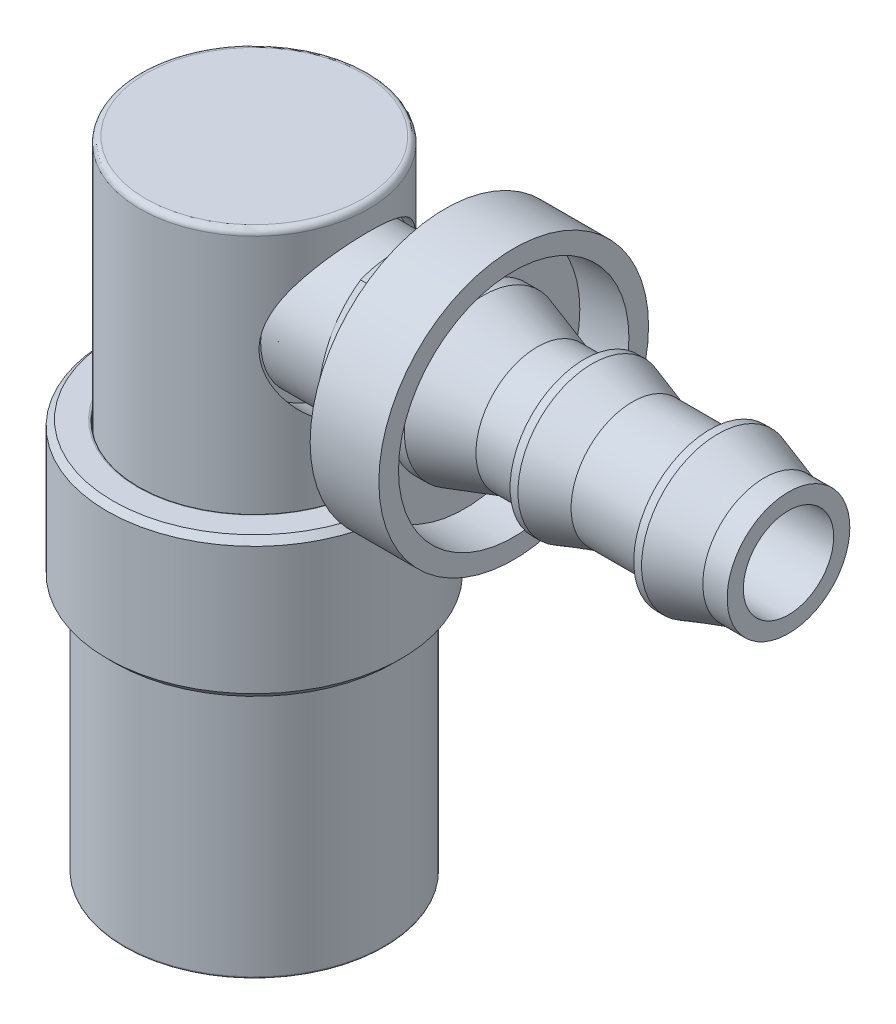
ISO-10303-21;
HEADER;
FILE_DESCRIPTION(('STEP AP214'),'2;1');
FILE_NAME('part.step','',(''),(''),'','','');
FILE_SCHEMA(('AUTOMOTIVE_DESIGN { 1 0 10303 214 1 1 1 1 }'));
ENDSEC;
DATA;
#1=APPLICATION_CONTEXT('core data for automotive mechanical design processes');
#2=APPLICATION_PROTOCOL_DEFINITION('international standard','automotive_design',2000,#1);
#3=PRODUCT_CONTEXT('',#1,'mechanical');
#4=PRODUCT('Part','Part','',(#3));
#5=PRODUCT_RELATED_PRODUCT_CATEGORY('part','',(#4));
#6=PRODUCT_DEFINITION_FORMATION('','',#4);
#7=PRODUCT_DEFINITION_CONTEXT('part definition',#1,'design');
#8=PRODUCT_DEFINITION('design','',#6,#7);
#9=PRODUCT_DEFINITION_SHAPE('','',#8);
#10=(LENGTH_UNIT() NAMED_UNIT(*) SI_UNIT(.MILLI.,.METRE.));
#11=(NAMED_UNIT(*) PLANE_ANGLE_UNIT() SI_UNIT($,.RADIAN.));
#12=(NAMED_UNIT(*) SI_UNIT($,.STERADIAN.) SOLID_ANGLE_UNIT());
#13=UNCERTAINTY_MEASURE_WITH_UNIT(LENGTH_MEASURE(1.E-05),#10,'distance_accuracy_value','');
#14=(GEOMETRIC_REPRESENTATION_CONTEXT(3) GLOBAL_UNCERTAINTY_ASSIGNED_CONTEXT((#13)) GLOBAL_UNIT_ASSIGNED_CONTEXT((#10,
#11,#12)) REPRESENTATION_CONTEXT('',''));
#15=CARTESIAN_POINT('',(0.,0.,0.));
#16=DIRECTION('',(0.,0.,1.));
#17=DIRECTION('',(1.,0.,0.));
#18=AXIS2_PLACEMENT_3D('',#15,#16,#17);
#19=CARTESIAN_POINT('',(12.339062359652,34.650937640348,-4.1656));
#20=DIRECTION('',(-1.,0.,0.));
#21=DIRECTION('',(0.,0.,-1.));
#22=AXIS2_PLACEMENT_3D('',#19,#20,#21);
#23=PLANE('',#22);
#24=CARTESIAN_POINT('',(12.339062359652,34.650937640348,0.));
#25=DIRECTION('',(-1.,0.,0.));
#26=DIRECTION('',(0.,-1.,0.));
#27=AXIS2_PLACEMENT_3D('',#24,#25,#26);
#28=CIRCLE('',#27,8.7249);
#29=CARTESIAN_POINT('',(12.339062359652,34.650937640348,-8.7249));
#30=VERTEX_POINT('',#29);
#31=CARTESIAN_POINT('',(12.339062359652,34.650937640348,8.7249));
#32=VERTEX_POINT('',#31);
#33=EDGE_CURVE('P0_E11',#30,#32,#28,.T.);
#34=ORIENTED_EDGE('',*,*,#33,.T.);
#35=CARTESIAN_POINT('',(12.339062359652,34.650937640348,0.));
#36=DIRECTION('',(-1.,0.,0.));
#37=DIRECTION('',(0.,-1.,0.));
#38=AXIS2_PLACEMENT_3D('',#35,#36,#37);
#39=CIRCLE('',#38,8.7249);
#40=EDGE_CURVE('P0_E27',#32,#30,#39,.T.);
#41=ORIENTED_EDGE('',*,*,#40,.T.);
#42=EDGE_LOOP('',(#34,#41));
#43=FACE_BOUND('',#42,.T.);
#44=CARTESIAN_POINT('',(12.339062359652,34.650937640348,0.));
#45=DIRECTION('',(-1.,0.,0.));
#46=DIRECTION('',(0.,-1.,0.));
#47=AXIS2_PLACEMENT_3D('',#44,#45,#46);
#48=CIRCLE('',#47,4.1656);
#49=CARTESIAN_POINT('',(12.339062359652,34.650937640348,-4.1656));
#50=VERTEX_POINT('',#49);
#51=CARTESIAN_POINT('',(12.339062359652,34.650937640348,4.1656));
#52=VERTEX_POINT('',#51);
#53=EDGE_CURVE('P0_E136',#50,#52,#48,.T.);
#54=ORIENTED_EDGE('',*,*,#53,.F.);
#55=CARTESIAN_POINT('',(12.339062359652,34.650937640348,0.));
#56=DIRECTION('',(-1.,0.,0.));
#57=DIRECTION('',(0.,-1.,0.));
#58=AXIS2_PLACEMENT_3D('',#55,#56,#57);
#59=CIRCLE('',#58,4.1656);
#60=EDGE_CURVE('P0_E101',#52,#50,#59,.T.);
#61=ORIENTED_EDGE('',*,*,#60,.F.);
#62=EDGE_LOOP('',(#54,#61));
#63=FACE_BOUND('',#62,.T.);
#64=ADVANCED_FACE('P0_F16',(#43,#63),#23,.T.);
#65=CARTESIAN_POINT('',(12.974062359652,34.650937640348,0.));
#66=DIRECTION('',(-1.,0.,0.));
#67=DIRECTION('',(0.,0.,-1.));
#68=AXIS2_PLACEMENT_3D('',#65,#66,#67);
#69=CYLINDRICAL_SURFACE('',#68,4.1656);
#70=ORIENTED_EDGE('',*,*,#53,.T.);
#71=DIRECTION('',(1.,0.,0.));
#72=VECTOR('',#71,1.);
#73=CARTESIAN_POINT('',(12.974062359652,34.650937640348,4.1656));
#74=LINE('',#73,#72);
#75=CARTESIAN_POINT('',(13.609062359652,34.650937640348,4.1656));
#76=VERTEX_POINT('',#75);
#77=EDGE_CURVE('P0_E105',#52,#76,#74,.T.);
#78=ORIENTED_EDGE('',*,*,#77,.T.);
#79=CARTESIAN_POINT('',(13.609062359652,34.650937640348,0.));
#80=DIRECTION('',(-1.,0.,0.));
#81=DIRECTION('',(0.,-1.,0.));
#82=AXIS2_PLACEMENT_3D('',#79,#80,#81);
#83=CIRCLE('',#82,4.1656);
#84=CARTESIAN_POINT('',(13.609062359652,34.650937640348,-4.1656));
#85=VERTEX_POINT('',#84);
#86=EDGE_CURVE('P0_E20',#85,#76,#83,.T.);
#87=ORIENTED_EDGE('',*,*,#86,.F.);
#88=CARTESIAN_POINT('',(13.609062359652,34.650937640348,0.));
#89=DIRECTION('',(-1.,0.,0.));
#90=DIRECTION('',(0.,-1.,0.));
#91=AXIS2_PLACEMENT_3D('',#88,#89,#90);
#92=CIRCLE('',#91,4.1656);
#93=EDGE_CURVE('P0_E106',#76,#85,#92,.T.);
#94=ORIENTED_EDGE('',*,*,#93,.F.);
#95=ORIENTED_EDGE('',*,*,#77,.F.);
#96=ORIENTED_EDGE('',*,*,#60,.T.);
#97=EDGE_LOOP('',(#70,#78,#87,#94,#95,#96));
#98=FACE_BOUND('',#97,.T.);
#99=ADVANCED_FACE('P0_F144',(#98),#69,.F.);
#100=CARTESIAN_POINT('',(13.609062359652,34.650937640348,-7.4549));
#101=DIRECTION('',(1.,0.,0.));
#102=DIRECTION('',(0.,-1.,0.));
#103=AXIS2_PLACEMENT_3D('',#100,#101,#102);
#104=PLANE('',#103);
#105=CARTESIAN_POINT('',(13.609062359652,34.650937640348,0.));
#106=DIRECTION('',(-1.,0.,0.));
#107=DIRECTION('',(0.,-1.,0.));
#108=AXIS2_PLACEMENT_3D('',#105,#106,#107);
#109=CIRCLE('',#108,7.4549);
#110=CARTESIAN_POINT('',(13.609062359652,34.650937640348,-7.4549));
#111=VERTEX_POINT('',#110);
#112=CARTESIAN_POINT('',(13.609062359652,34.650937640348,7.4549));
#113=VERTEX_POINT('',#112);
#114=EDGE_CURVE('P0_E109',#111,#113,#109,.T.);
#115=ORIENTED_EDGE('',*,*,#114,.F.);
#116=CARTESIAN_POINT('',(13.609062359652,34.650937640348,0.));
#117=DIRECTION('',(-1.,0.,0.));
#118=DIRECTION('',(0.,-1.,0.));
#119=AXIS2_PLACEMENT_3D('',#116,#117,#118);
#120=CIRCLE('',#119,7.4549);
#121=EDGE_CURVE('P0_E98',#113,#111,#120,.T.);
#122=ORIENTED_EDGE('',*,*,#121,.F.);
#123=EDGE_LOOP('',(#115,#122));
#124=FACE_BOUND('',#123,.T.);
#125=ORIENTED_EDGE('',*,*,#86,.T.);
#126=ORIENTED_EDGE('',*,*,#93,.T.);
#127=EDGE_LOOP('',(#125,#126));
#128=FACE_BOUND('',#127,.T.);
#129=ADVANCED_FACE('P0_F146',(#124,#128),#104,.T.);
#130=CARTESIAN_POINT('',(15.196562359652,34.650937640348,0.));
#131=DIRECTION('',(-1.,0.,0.));
#132=DIRECTION('',(0.,0.,-1.));
#133=AXIS2_PLACEMENT_3D('',#130,#131,#132);
#134=CYLINDRICAL_SURFACE('',#133,7.4549);
#135=ORIENTED_EDGE('',*,*,#114,.T.);
#136=DIRECTION('',(1.,0.,0.));
#137=VECTOR('',#136,1.);
#138=CARTESIAN_POINT('',(15.196562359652,34.650937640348,7.4549));
#139=LINE('',#138,#137);
#140=CARTESIAN_POINT('',(16.784062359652,34.650937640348,7.4549));
#141=VERTEX_POINT('',#140);
#142=EDGE_CURVE('P0_E119',#113,#141,#139,.T.);
#143=ORIENTED_EDGE('',*,*,#142,.T.);
#144=CARTESIAN_POINT('',(16.784062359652,34.650937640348,0.));
#145=DIRECTION('',(-1.,0.,0.));
#146=DIRECTION('',(0.,-1.,0.));
#147=AXIS2_PLACEMENT_3D('',#144,#145,#146);
#148=CIRCLE('',#147,7.4549);
#149=CARTESIAN_POINT('',(16.784062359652,34.650937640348,-7.4549));
#150=VERTEX_POINT('',#149);
#151=EDGE_CURVE('P0_E113',#150,#141,#148,.T.);
#152=ORIENTED_EDGE('',*,*,#151,.F.);
#153=CARTESIAN_POINT('',(16.784062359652,34.650937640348,0.));
#154=DIRECTION('',(-1.,0.,0.));
#155=DIRECTION('',(0.,-1.,0.));
#156=AXIS2_PLACEMENT_3D('',#153,#154,#155);
#157=CIRCLE('',#156,7.4549);
#158=EDGE_CURVE('P0_E95',#141,#150,#157,.T.);
#159=ORIENTED_EDGE('',*,*,#158,.F.);
#160=ORIENTED_EDGE('',*,*,#142,.F.);
#161=ORIENTED_EDGE('',*,*,#121,.T.);
#162=EDGE_LOOP('',(#135,#143,#152,#159,#160,#161));
#163=FACE_BOUND('',#162,.T.);
#164=ADVANCED_FACE('P0_F168',(#163),#134,.F.);
#165=CARTESIAN_POINT('',(16.784062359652,34.650937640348,-8.7249));
#166=DIRECTION('',(1.,0.,0.));
#167=DIRECTION('',(0.,-1.,0.));
#168=AXIS2_PLACEMENT_3D('',#165,#166,#167);
#169=PLANE('',#168);
#170=CARTESIAN_POINT('',(16.784062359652,34.650937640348,0.));
#171=DIRECTION('',(-1.,0.,0.));
#172=DIRECTION('',(0.,-1.,0.));
#173=AXIS2_PLACEMENT_3D('',#170,#171,#172);
#174=CIRCLE('',#173,8.7249);
#175=CARTESIAN_POINT('',(16.784062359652,34.650937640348,-8.7249));
#176=VERTEX_POINT('',#175);
#177=CARTESIAN_POINT('',(16.784062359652,34.650937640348,8.7249));
#178=VERTEX_POINT('',#177);
#179=EDGE_CURVE('P0_E81',#176,#178,#174,.T.);
#180=ORIENTED_EDGE('',*,*,#179,.F.);
#181=CARTESIAN_POINT('',(16.784062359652,34.650937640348,0.));
#182=DIRECTION('',(-1.,0.,0.));
#183=DIRECTION('',(0.,-1.,0.));
#184=AXIS2_PLACEMENT_3D('',#181,#182,#183);
#185=CIRCLE('',#184,8.7249);
#186=EDGE_CURVE('P0_E84',#178,#176,#185,.T.);
#187=ORIENTED_EDGE('',*,*,#186,.F.);
#188=EDGE_LOOP('',(#180,#187));
#189=FACE_BOUND('',#188,.T.);
#190=ORIENTED_EDGE('',*,*,#151,.T.);
#191=ORIENTED_EDGE('',*,*,#158,.T.);
#192=EDGE_LOOP('',(#190,#191));
#193=FACE_BOUND('',#192,.T.);
#194=ADVANCED_FACE('P0_F18',(#189,#193),#169,.T.);
#195=CARTESIAN_POINT('',(14.561562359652,34.650937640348,0.));
#196=DIRECTION('',(-1.,0.,0.));
#197=DIRECTION('',(0.,0.,-1.));
#198=AXIS2_PLACEMENT_3D('',#195,#196,#197);
#199=CYLINDRICAL_SURFACE('',#198,8.7249);
#200=ORIENTED_EDGE('',*,*,#33,.F.);
#201=ORIENTED_EDGE('',*,*,#40,.F.);
#202=DIRECTION('',(1.,0.,0.));
#203=VECTOR('',#202,1.);
#204=CARTESIAN_POINT('',(14.561562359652,34.650937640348,8.7249));
#205=LINE('',#204,#203);
#206=EDGE_CURVE('P0_E89',#32,#178,#205,.T.);
#207=ORIENTED_EDGE('',*,*,#206,.T.);
#208=ORIENTED_EDGE('',*,*,#186,.T.);
#209=ORIENTED_EDGE('',*,*,#179,.T.);
#210=ORIENTED_EDGE('',*,*,#206,.F.);
#211=EDGE_LOOP('',(#200,#201,#207,#208,#209,#210));
#212=FACE_BOUND('',#211,.T.);
#213=ADVANCED_FACE('P0_F88',(#212),#199,.T.);
#214=CLOSED_SHELL('',(#64,#99,#129,#164,#194,#213));
#215=MANIFOLD_SOLID_BREP('P0_B1',#214);
#216=CARTESIAN_POINT('',(3.195062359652,34.650937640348,0.));
#217=DIRECTION('',(1.,0.,0.));
#218=DIRECTION('',(0.,0.,1.));
#219=AXIS2_PLACEMENT_3D('',#216,#217,#218);
#220=CONICAL_SURFACE('',#219,4.318,0.785398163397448);
#221=CARTESIAN_POINT('',(2.814062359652,34.650937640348,0.));
#222=DIRECTION('',(1.,0.,0.));
#223=DIRECTION('',(0.,0.,1.));
#224=AXIS2_PLACEMENT_3D('',#221,#222,#223);
#225=CIRCLE('',#224,3.937);
#226=CARTESIAN_POINT('',(2.814062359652,34.650937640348,-3.937));
#227=VERTEX_POINT('',#226);
#228=EDGE_CURVE('P1_E36',#227,#227,#225,.T.);
#229=ORIENTED_EDGE('',*,*,#228,.T.);
#230=DIRECTION('',(0.707106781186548,0.,-0.707106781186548));
#231=VECTOR('',#230,1.);
#232=CARTESIAN_POINT('',(3.195062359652,34.650937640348,-4.318));
#233=LINE('',#232,#231);
#234=CARTESIAN_POINT('',(3.583682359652,34.650937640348,-4.70662));
#235=VERTEX_POINT('',#234);
#236=EDGE_CURVE('P1_E288',#227,#235,#233,.T.);
#237=ORIENTED_EDGE('',*,*,#236,.T.);
#238=CARTESIAN_POINT('',(3.583682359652,34.650937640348,0.));
#239=DIRECTION('',(-1.,0.,0.));
#240=DIRECTION('',(0.,0.,-1.));
#241=AXIS2_PLACEMENT_3D('',#238,#239,#240);
#242=CIRCLE('',#241,4.70662);
#243=CARTESIAN_POINT('',(3.583682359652,34.650937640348,4.70662));
#244=VERTEX_POINT('',#243);
#245=EDGE_CURVE('P1_E216',#235,#244,#242,.T.);
#246=ORIENTED_EDGE('',*,*,#245,.T.);
#247=CARTESIAN_POINT('',(3.583682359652,34.650937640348,0.));
#248=DIRECTION('',(-1.,0.,0.));
#249=DIRECTION('',(0.,0.,-1.));
#250=AXIS2_PLACEMENT_3D('',#247,#248,#249);
#251=CIRCLE('',#250,4.70662);
#252=EDGE_CURVE('P1_E209',#244,#235,#251,.T.);
#253=ORIENTED_EDGE('',*,*,#252,.T.);
#254=ORIENTED_EDGE('',*,*,#236,.F.);
#255=EDGE_LOOP('',(#229,#237,#246,#253,#254));
#256=FACE_BOUND('',#255,.T.);
#257=ADVANCED_FACE('P1_F16',(#256),#220,.T.);
#258=CARTESIAN_POINT('',(5.989062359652,34.650937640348,0.));
#259=DIRECTION('',(-1.,0.,0.));
#260=DIRECTION('',(0.,0.,-1.));
#261=AXIS2_PLACEMENT_3D('',#258,#259,#260);
#262=CYLINDRICAL_SURFACE('',#261,4.70662);
#263=ORIENTED_EDGE('',*,*,#252,.F.);
#264=DIRECTION('',(1.,0.,0.));
#265=VECTOR('',#264,1.);
#266=CARTESIAN_POINT('',(5.989062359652,34.650937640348,4.70662));
#267=LINE('',#266,#265);
#268=CARTESIAN_POINT('',(9.16846176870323,34.650937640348,4.70662));
#269=VERTEX_POINT('',#268);
#270=EDGE_CURVE('P1_E217',#244,#269,#267,.T.);
#271=ORIENTED_EDGE('',*,*,#270,.T.);
#272=CARTESIAN_POINT('',(9.16846176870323,34.650937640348,0.));
#273=DIRECTION('',(-1.,0.,0.));
#274=DIRECTION('',(0.,0.,-1.));
#275=AXIS2_PLACEMENT_3D('',#272,#273,#274);
#276=CIRCLE('',#275,4.70662);
#277=CARTESIAN_POINT('',(9.16846176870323,34.650937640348,-4.70662));
#278=VERTEX_POINT('',#277);
#279=EDGE_CURVE('P1_E190',#269,#278,#276,.T.);
#280=ORIENTED_EDGE('',*,*,#279,.T.);
#281=CARTESIAN_POINT('',(9.16846176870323,34.650937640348,0.));
#282=DIRECTION('',(-1.,0.,0.));
#283=DIRECTION('',(0.,0.,-1.));
#284=AXIS2_PLACEMENT_3D('',#281,#282,#283);
#285=CIRCLE('',#284,4.70662);
#286=EDGE_CURVE('P1_E74',#278,#269,#285,.T.);
#287=ORIENTED_EDGE('',*,*,#286,.T.);
#288=ORIENTED_EDGE('',*,*,#270,.F.);
#289=ORIENTED_EDGE('',*,*,#245,.F.);
#290=EDGE_LOOP('',(#263,#271,#280,#287,#288,#289));
#291=FACE_BOUND('',#290,.T.);
#292=ADVANCED_FACE('P1_F398',(#291),#262,.T.);
#293=CARTESIAN_POINT('',(2.814062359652,34.650937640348,-2.5781));
#294=DIRECTION('',(-1.,0.,0.));
#295=DIRECTION('',(0.,0.,-1.));
#296=AXIS2_PLACEMENT_3D('',#293,#294,#295);
#297=PLANE('',#296);
#298=CARTESIAN_POINT('',(2.814062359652,34.650937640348,0.));
#299=DIRECTION('',(-1.,0.,0.));
#300=DIRECTION('',(0.,0.,1.));
#301=AXIS2_PLACEMENT_3D('',#298,#299,#300);
#302=CIRCLE('',#301,2.921);
#303=CARTESIAN_POINT('',(2.814062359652,34.650937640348,2.921));
#304=VERTEX_POINT('',#303);
#305=EDGE_CURVE('P1_E344',#304,#304,#302,.T.);
#306=ORIENTED_EDGE('',*,*,#305,.F.);
#307=EDGE_LOOP('',(#306));
#308=FACE_BOUND('',#307,.T.);
#309=ORIENTED_EDGE('',*,*,#228,.F.);
#310=EDGE_LOOP('',(#309));
#311=FACE_BOUND('',#310,.T.);
#312=ADVANCED_FACE('P1_F404',(#308,#311),#297,.T.);
#313=CARTESIAN_POINT('',(2.814062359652,34.650937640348,5.48459661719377));
#314=DIRECTION('',(0.,-0.5,-0.866025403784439));
#315=DIRECTION('',(-1.,0.,0.));
#316=AXIS2_PLACEMENT_3D('',#313,#314,#315);
#317=PLANE('',#316);
#318=CARTESIAN_POINT('',(11.8567327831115,39.400737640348,2.74229830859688));
#319=CARTESIAN_POINT('',(12.6483661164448,37.025837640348,4.11344746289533));
#320=CARTESIAN_POINT('',(11.8567327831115,34.650937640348,5.48459661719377));
#321=(BOUNDED_CURVE() B_SPLINE_CURVE(2,(#318,#319,#320),.UNSPECIFIED.,.F.,
.F.) B_SPLINE_CURVE_WITH_KNOTS((3,3),(0.0756877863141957,0.66089469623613),
.UNSPECIFIED.) CURVE() GEOMETRIC_REPRESENTATION_ITEM() RATIONAL_B_SPLINE_CURVE((1.0473309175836,
1.20935357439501,1.0473309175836)) REPRESENTATION_ITEM(''));
#322=CARTESIAN_POINT('',(11.8567327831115,39.400737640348,2.74229830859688));
#323=VERTEX_POINT('',#322);
#324=CARTESIAN_POINT('',(11.8567327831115,34.650937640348,5.48459661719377));
#325=VERTEX_POINT('',#324);
#326=EDGE_CURVE('P1_E88',#323,#325,#321,.T.);
#327=ORIENTED_EDGE('',*,*,#326,.F.);
#328=DIRECTION('',(1.,0.,0.));
#329=VECTOR('',#328,1.);
#330=CARTESIAN_POINT('',(2.814062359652,39.400737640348,2.74229830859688));
#331=LINE('',#330,#329);
#332=CARTESIAN_POINT('',(9.61762677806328,39.400737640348,2.74229830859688));
#333=VERTEX_POINT('',#332);
#334=EDGE_CURVE('P1_E154',#333,#323,#331,.T.);
#335=ORIENTED_EDGE('',*,*,#334,.F.);
#336=CARTESIAN_POINT('',(9.61762677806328,34.650937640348,5.48459661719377));
#337=CARTESIAN_POINT('',(8.82599344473,37.025837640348,4.1134474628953));
#338=CARTESIAN_POINT('',(9.61762677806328,39.400737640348,2.74229830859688));
#339=(BOUNDED_CURVE() B_SPLINE_CURVE(2,(#336,#337,#338),.UNSPECIFIED.,.F.,
.F.) B_SPLINE_CURVE_WITH_KNOTS((3,3),(0.0756877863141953,0.66089469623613),
.UNSPECIFIED.) CURVE() GEOMETRIC_REPRESENTATION_ITEM() RATIONAL_B_SPLINE_CURVE((1.0473309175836,
1.20935357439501,1.0473309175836)) REPRESENTATION_ITEM(''));
#340=CARTESIAN_POINT('',(9.61762677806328,34.650937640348,5.48459661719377));
#341=VERTEX_POINT('',#340);
#342=EDGE_CURVE('P1_E185',#341,#333,#339,.T.);
#343=ORIENTED_EDGE('',*,*,#342,.F.);
#344=DIRECTION('',(1.,0.,0.));
#345=VECTOR('',#344,1.);
#346=CARTESIAN_POINT('',(2.814062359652,34.650937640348,5.48459661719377));
#347=LINE('',#346,#345);
#348=EDGE_CURVE('P1_E191',#341,#325,#347,.T.);
#349=ORIENTED_EDGE('',*,*,#348,.T.);
#350=EDGE_LOOP('',(#327,#335,#343,#349));
#351=FACE_BOUND('',#350,.T.);
#352=ADVANCED_FACE('P1_F420',(#351),#317,.F.);
#353=CARTESIAN_POINT('',(2.814062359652,29.901137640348,2.74229830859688));
#354=DIRECTION('',(0.,0.5,-0.866025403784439));
#355=DIRECTION('',(0.,0.866025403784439,0.5));
#356=AXIS2_PLACEMENT_3D('',#353,#354,#355);
#357=PLANE('',#356);
#358=CARTESIAN_POINT('',(11.8567327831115,34.650937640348,5.48459661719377));
#359=CARTESIAN_POINT('',(12.6483661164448,32.276037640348,4.11344746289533));
#360=CARTESIAN_POINT('',(11.8567327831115,29.901137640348,2.74229830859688));
#361=(BOUNDED_CURVE() B_SPLINE_CURVE(2,(#358,#359,#360),.UNSPECIFIED.,.F.,
.F.) B_SPLINE_CURVE_WITH_KNOTS((3,3),(0.0756877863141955,0.66089469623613),
.UNSPECIFIED.) CURVE() GEOMETRIC_REPRESENTATION_ITEM() RATIONAL_B_SPLINE_CURVE((1.0473309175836,
1.20935357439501,1.0473309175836)) REPRESENTATION_ITEM(''));
#362=CARTESIAN_POINT('',(11.8567327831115,29.901137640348,2.74229830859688));
#363=VERTEX_POINT('',#362);
#364=EDGE_CURVE('P1_E161',#325,#363,#361,.T.);
#365=ORIENTED_EDGE('',*,*,#364,.F.);
#366=ORIENTED_EDGE('',*,*,#348,.F.);
#367=CARTESIAN_POINT('',(9.61762677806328,29.901137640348,2.74229830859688));
#368=CARTESIAN_POINT('',(8.82599344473,32.276037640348,4.11344746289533));
#369=CARTESIAN_POINT('',(9.61762677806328,34.650937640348,5.48459661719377));
#370=(BOUNDED_CURVE() B_SPLINE_CURVE(2,(#367,#368,#369),.UNSPECIFIED.,.F.,
.F.) B_SPLINE_CURVE_WITH_KNOTS((3,3),(0.0756877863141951,0.66089469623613),
.UNSPECIFIED.) CURVE() GEOMETRIC_REPRESENTATION_ITEM() RATIONAL_B_SPLINE_CURVE((1.0473309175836,
1.20935357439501,1.0473309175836)) REPRESENTATION_ITEM(''));
#371=CARTESIAN_POINT('',(9.61762677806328,29.901137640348,2.74229830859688));
#372=VERTEX_POINT('',#371);
#373=EDGE_CURVE('P1_E175',#372,#341,#370,.T.);
#374=ORIENTED_EDGE('',*,*,#373,.F.);
#375=DIRECTION('',(1.,0.,0.));
#376=VECTOR('',#375,1.);
#377=CARTESIAN_POINT('',(2.814062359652,29.901137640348,2.74229830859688));
#378=LINE('',#377,#376);
#379=EDGE_CURVE('P1_E202',#372,#363,#378,.T.);
#380=ORIENTED_EDGE('',*,*,#379,.T.);
#381=EDGE_LOOP('',(#365,#366,#374,#380));
#382=FACE_BOUND('',#381,.T.);
#383=ADVANCED_FACE('P1_F415',(#382),#357,.F.);
#384=CARTESIAN_POINT('',(2.814062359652,29.901137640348,-2.74229830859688));
#385=DIRECTION('',(0.,1.,0.));
#386=DIRECTION('',(1.,0.,0.));
#387=AXIS2_PLACEMENT_3D('',#384,#385,#386);
#388=PLANE('',#387);
#389=CARTESIAN_POINT('',(11.8567327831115,29.901137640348,2.74229830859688));
#390=CARTESIAN_POINT('',(12.6483661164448,29.901137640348,0.));
#391=CARTESIAN_POINT('',(11.8567327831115,29.901137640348,-2.74229830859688));
#392=(BOUNDED_CURVE() B_SPLINE_CURVE(2,(#389,#390,#391),.UNSPECIFIED.,.F.,
.F.) B_SPLINE_CURVE_WITH_KNOTS((3,3),(0.0756877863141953,0.66089469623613),
.UNSPECIFIED.) CURVE() GEOMETRIC_REPRESENTATION_ITEM() RATIONAL_B_SPLINE_CURVE((1.0473309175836,
1.20935357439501,1.0473309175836)) REPRESENTATION_ITEM(''));
#393=CARTESIAN_POINT('',(11.8567327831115,29.901137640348,-2.74229830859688));
#394=VERTEX_POINT('',#393);
#395=EDGE_CURVE('P1_E166',#363,#394,#392,.T.);
#396=ORIENTED_EDGE('',*,*,#395,.F.);
#397=ORIENTED_EDGE('',*,*,#379,.F.);
#398=CARTESIAN_POINT('',(9.61762677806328,29.901137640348,-2.74229830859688));
#399=CARTESIAN_POINT('',(8.82599344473,29.901137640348,0.));
#400=CARTESIAN_POINT('',(9.61762677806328,29.901137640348,2.74229830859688));
#401=(BOUNDED_CURVE() B_SPLINE_CURVE(2,(#398,#399,#400),.UNSPECIFIED.,.F.,
.F.) B_SPLINE_CURVE_WITH_KNOTS((3,3),(0.0756877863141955,0.660894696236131),
.UNSPECIFIED.) CURVE() GEOMETRIC_REPRESENTATION_ITEM() RATIONAL_B_SPLINE_CURVE((1.0473309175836,
1.20935357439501,1.0473309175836)) REPRESENTATION_ITEM(''));
#402=CARTESIAN_POINT('',(9.61762677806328,29.901137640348,-2.74229830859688));
#403=VERTEX_POINT('',#402);
#404=EDGE_CURVE('P1_E184',#403,#372,#401,.T.);
#405=ORIENTED_EDGE('',*,*,#404,.F.);
#406=DIRECTION('',(1.,0.,0.));
#407=VECTOR('',#406,1.);
#408=CARTESIAN_POINT('',(2.814062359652,29.901137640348,-2.74229830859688));
#409=LINE('',#408,#407);
#410=EDGE_CURVE('P1_E195',#403,#394,#409,.T.);
#411=ORIENTED_EDGE('',*,*,#410,.T.);
#412=EDGE_LOOP('',(#396,#397,#405,#411));
#413=FACE_BOUND('',#412,.T.);
#414=ADVANCED_FACE('P1_F411',(#413),#388,.F.);
#415=CARTESIAN_POINT('',(2.814062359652,34.650937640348,-5.48459661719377));
#416=DIRECTION('',(0.,0.5,0.866025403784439));
#417=DIRECTION('',(1.,0.,0.));
#418=AXIS2_PLACEMENT_3D('',#415,#416,#417);
#419=PLANE('',#418);
#420=CARTESIAN_POINT('',(11.8567327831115,29.901137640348,-2.74229830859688));
#421=CARTESIAN_POINT('',(12.6483661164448,32.276037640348,-4.11344746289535));
#422=CARTESIAN_POINT('',(11.8567327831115,34.650937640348,-5.48459661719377));
#423=(BOUNDED_CURVE() B_SPLINE_CURVE(2,(#420,#421,#422),.UNSPECIFIED.,.F.,
.F.) B_SPLINE_CURVE_WITH_KNOTS((3,3),(0.0756877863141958,0.66089469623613),
.UNSPECIFIED.) CURVE() GEOMETRIC_REPRESENTATION_ITEM() RATIONAL_B_SPLINE_CURVE((1.0473309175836,
1.20935357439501,1.0473309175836)) REPRESENTATION_ITEM(''));
#424=CARTESIAN_POINT('',(11.8567327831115,34.650937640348,-5.48459661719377));
#425=VERTEX_POINT('',#424);
#426=EDGE_CURVE('P1_E146',#394,#425,#423,.T.);
#427=ORIENTED_EDGE('',*,*,#426,.F.);
#428=ORIENTED_EDGE('',*,*,#410,.F.);
#429=CARTESIAN_POINT('',(9.61762677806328,34.650937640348,-5.48459661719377));
#430=CARTESIAN_POINT('',(8.82599344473,32.276037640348,-4.1134474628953));
#431=CARTESIAN_POINT('',(9.61762677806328,29.901137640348,-2.74229830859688));
#432=(BOUNDED_CURVE() B_SPLINE_CURVE(2,(#429,#430,#431),.UNSPECIFIED.,.F.,
.F.) B_SPLINE_CURVE_WITH_KNOTS((3,3),(0.0756877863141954,0.66089469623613),
.UNSPECIFIED.) CURVE() GEOMETRIC_REPRESENTATION_ITEM() RATIONAL_B_SPLINE_CURVE((1.0473309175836,
1.20935357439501,1.0473309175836)) REPRESENTATION_ITEM(''));
#433=CARTESIAN_POINT('',(9.61762677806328,34.650937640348,-5.48459661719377));
#434=VERTEX_POINT('',#433);
#435=EDGE_CURVE('P1_E227',#434,#403,#432,.T.);
#436=ORIENTED_EDGE('',*,*,#435,.F.);
#437=DIRECTION('',(1.,0.,0.));
#438=VECTOR('',#437,1.);
#439=CARTESIAN_POINT('',(2.814062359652,34.650937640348,-5.48459661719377));
#440=LINE('',#439,#438);
#441=EDGE_CURVE('P1_E203',#434,#425,#440,.T.);
#442=ORIENTED_EDGE('',*,*,#441,.T.);
#443=EDGE_LOOP('',(#427,#428,#436,#442));
#444=FACE_BOUND('',#443,.T.);
#445=ADVANCED_FACE('P1_F414',(#444),#419,.F.);
#446=CARTESIAN_POINT('',(2.814062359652,39.400737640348,-2.74229830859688));
#447=DIRECTION('',(0.,-0.5,0.866025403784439));
#448=DIRECTION('',(-1.,0.,0.));
#449=AXIS2_PLACEMENT_3D('',#446,#447,#448);
#450=PLANE('',#449);
#451=CARTESIAN_POINT('',(11.8567327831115,34.650937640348,-5.48459661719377));
#452=CARTESIAN_POINT('',(12.6483661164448,37.025837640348,-4.1134474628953));
#453=CARTESIAN_POINT('',(11.8567327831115,39.400737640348,-2.74229830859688));
#454=(BOUNDED_CURVE() B_SPLINE_CURVE(2,(#451,#452,#453),.UNSPECIFIED.,.F.,
.F.) B_SPLINE_CURVE_WITH_KNOTS((3,3),(0.0756877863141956,0.66089469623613),
.UNSPECIFIED.) CURVE() GEOMETRIC_REPRESENTATION_ITEM() RATIONAL_B_SPLINE_CURVE((1.0473309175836,
1.20935357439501,1.0473309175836)) REPRESENTATION_ITEM(''));
#455=CARTESIAN_POINT('',(11.8567327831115,39.400737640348,-2.74229830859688));
#456=VERTEX_POINT('',#455);
#457=EDGE_CURVE('P1_E105',#425,#456,#454,.T.);
#458=ORIENTED_EDGE('',*,*,#457,.F.);
#459=ORIENTED_EDGE('',*,*,#441,.F.);
#460=CARTESIAN_POINT('',(9.61762677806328,39.400737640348,-2.74229830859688));
#461=CARTESIAN_POINT('',(8.82599344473,37.025837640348,-4.11344746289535));
#462=CARTESIAN_POINT('',(9.61762677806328,34.650937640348,-5.48459661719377));
#463=(BOUNDED_CURVE() B_SPLINE_CURVE(2,(#460,#461,#462),.UNSPECIFIED.,.F.,
.F.) B_SPLINE_CURVE_WITH_KNOTS((3,3),(0.0756877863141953,0.66089469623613),
.UNSPECIFIED.) CURVE() GEOMETRIC_REPRESENTATION_ITEM() RATIONAL_B_SPLINE_CURVE((1.0473309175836,
1.20935357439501,1.0473309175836)) REPRESENTATION_ITEM(''));
#464=CARTESIAN_POINT('',(9.61762677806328,39.400737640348,-2.74229830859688));
#465=VERTEX_POINT('',#464);
#466=EDGE_CURVE('P1_E113',#465,#434,#463,.T.);
#467=ORIENTED_EDGE('',*,*,#466,.F.);
#468=DIRECTION('',(1.,0.,0.));
#469=VECTOR('',#468,1.);
#470=CARTESIAN_POINT('',(2.814062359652,39.400737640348,-2.74229830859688));
#471=LINE('',#470,#469);
#472=EDGE_CURVE('P1_E243',#465,#456,#471,.T.);
#473=ORIENTED_EDGE('',*,*,#472,.T.);
#474=EDGE_LOOP('',(#458,#459,#467,#473));
#475=FACE_BOUND('',#474,.T.);
#476=ADVANCED_FACE('P1_F423',(#475),#450,.F.);
#477=CARTESIAN_POINT('',(2.814062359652,39.400737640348,2.74229830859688));
#478=DIRECTION('',(0.,-1.,0.));
#479=DIRECTION('',(1.,0.,0.));
#480=AXIS2_PLACEMENT_3D('',#477,#478,#479);
#481=PLANE('',#480);
#482=CARTESIAN_POINT('',(11.8567327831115,39.400737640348,-2.74229830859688));
#483=CARTESIAN_POINT('',(12.6483661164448,39.400737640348,0.));
#484=CARTESIAN_POINT('',(11.8567327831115,39.400737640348,2.74229830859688));
#485=(BOUNDED_CURVE() B_SPLINE_CURVE(2,(#482,#483,#484),.UNSPECIFIED.,.F.,
.F.) B_SPLINE_CURVE_WITH_KNOTS((3,3),(0.0756877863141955,0.66089469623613),
.UNSPECIFIED.) CURVE() GEOMETRIC_REPRESENTATION_ITEM() RATIONAL_B_SPLINE_CURVE((1.0473309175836,
1.20935357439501,1.0473309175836)) REPRESENTATION_ITEM(''));
#486=EDGE_CURVE('P1_E244',#456,#323,#485,.T.);
#487=ORIENTED_EDGE('',*,*,#486,.F.);
#488=ORIENTED_EDGE('',*,*,#472,.F.);
#489=CARTESIAN_POINT('',(9.61762677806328,39.400737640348,2.74229830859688));
#490=CARTESIAN_POINT('',(8.82599344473,39.400737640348,0.));
#491=CARTESIAN_POINT('',(9.61762677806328,39.400737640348,-2.74229830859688));
#492=(BOUNDED_CURVE() B_SPLINE_CURVE(2,(#489,#490,#491),.UNSPECIFIED.,.F.,
.F.) B_SPLINE_CURVE_WITH_KNOTS((3,3),(0.0756877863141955,0.66089469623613),
.UNSPECIFIED.) CURVE() GEOMETRIC_REPRESENTATION_ITEM() RATIONAL_B_SPLINE_CURVE((1.0473309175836,
1.20935357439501,1.0473309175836)) REPRESENTATION_ITEM(''));
#493=EDGE_CURVE('P1_E208',#333,#465,#492,.T.);
#494=ORIENTED_EDGE('',*,*,#493,.F.);
#495=ORIENTED_EDGE('',*,*,#334,.T.);
#496=EDGE_LOOP('',(#487,#488,#494,#495));
#497=FACE_BOUND('',#496,.T.);
#498=ADVANCED_FACE('P1_F409',(#497),#481,.F.);
#499=CARTESIAN_POINT('',(11.958062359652,34.650937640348,0.));
#500=DIRECTION('',(-1.,0.,0.));
#501=DIRECTION('',(0.,0.,1.));
#502=AXIS2_PLACEMENT_3D('',#499,#500,#501);
#503=CONICAL_SURFACE('',#502,5.30908864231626,1.0471975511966);
#504=ORIENTED_EDGE('',*,*,#426,.T.);
#505=DIRECTION('',(0.5,0.,0.866025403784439));
#506=VECTOR('',#505,1.);
#507=CARTESIAN_POINT('',(11.958062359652,34.650937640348,-5.30908864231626));
#508=LINE('',#507,#506);
#509=CARTESIAN_POINT('',(12.339062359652,34.650937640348,-4.64917728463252));
#510=VERTEX_POINT('',#509);
#511=EDGE_CURVE('P1_E141',#425,#510,#508,.T.);
#512=ORIENTED_EDGE('',*,*,#511,.T.);
#513=CARTESIAN_POINT('',(12.339062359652,34.650937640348,0.));
#514=DIRECTION('',(-1.,0.,0.));
#515=DIRECTION('',(0.,0.,1.));
#516=AXIS2_PLACEMENT_3D('',#513,#514,#515);
#517=CIRCLE('',#516,4.64917728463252);
#518=EDGE_CURVE('P1_E135',#510,#510,#517,.T.);
#519=ORIENTED_EDGE('',*,*,#518,.T.);
#520=ORIENTED_EDGE('',*,*,#511,.F.);
#521=ORIENTED_EDGE('',*,*,#457,.T.);
#522=ORIENTED_EDGE('',*,*,#486,.T.);
#523=ORIENTED_EDGE('',*,*,#326,.T.);
#524=ORIENTED_EDGE('',*,*,#364,.T.);
#525=ORIENTED_EDGE('',*,*,#395,.T.);
#526=EDGE_LOOP('',(#504,#512,#519,#520,#521,#522,#523,#524,#525));
#527=FACE_BOUND('',#526,.T.);
#528=ADVANCED_FACE('P1_F143',(#527),#503,.T.);
#529=CARTESIAN_POINT('',(12.339062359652,34.650937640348,-5.969));
#530=DIRECTION('',(1.,0.,0.));
#531=DIRECTION('',(0.,-1.,0.));
#532=AXIS2_PLACEMENT_3D('',#529,#530,#531);
#533=PLANE('',#532);
#534=ORIENTED_EDGE('',*,*,#518,.F.);
#535=EDGE_LOOP('',(#534));
#536=FACE_BOUND('',#535,.T.);
#537=CARTESIAN_POINT('',(12.339062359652,34.650937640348,0.));
#538=DIRECTION('',(1.,0.,0.));
#539=DIRECTION('',(0.,0.,1.));
#540=AXIS2_PLACEMENT_3D('',#537,#538,#539);
#541=CIRCLE('',#540,4.2545);
#542=CARTESIAN_POINT('',(12.339062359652,34.650937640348,-4.2545));
#543=VERTEX_POINT('',#542);
#544=CARTESIAN_POINT('',(12.339062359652,34.650937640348,4.2545));
#545=VERTEX_POINT('',#544);
#546=EDGE_CURVE('P1_E129',#543,#545,#541,.T.);
#547=ORIENTED_EDGE('',*,*,#546,.F.);
#548=CARTESIAN_POINT('',(12.339062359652,34.650937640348,0.));
#549=DIRECTION('',(1.,0.,0.));
#550=DIRECTION('',(0.,0.,1.));
#551=AXIS2_PLACEMENT_3D('',#548,#549,#550);
#552=CIRCLE('',#551,4.2545);
#553=EDGE_CURVE('P1_E225',#545,#543,#552,.T.);
#554=ORIENTED_EDGE('',*,*,#553,.F.);
#555=EDGE_LOOP('',(#547,#554));
#556=FACE_BOUND('',#555,.T.);
#557=ADVANCED_FACE('P1_F137',(#536,#556),#533,.T.);
#558=CARTESIAN_POINT('',(9.53067978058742,34.650937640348,0.));
#559=DIRECTION('',(1.,0.,0.));
#560=DIRECTION('',(0.,0.,1.));
#561=AXIS2_PLACEMENT_3D('',#558,#559,#560);
#562=CONICAL_SURFACE('',#561,5.334,1.0471975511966);
#563=ORIENTED_EDGE('',*,*,#279,.F.);
#564=ORIENTED_EDGE('',*,*,#286,.F.);
#565=DIRECTION('',(0.5,0.,-0.866025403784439));
#566=VECTOR('',#565,1.);
#567=CARTESIAN_POINT('',(9.53067978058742,34.650937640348,-5.334));
#568=LINE('',#567,#566);
#569=EDGE_CURVE('P1_E174',#278,#434,#568,.T.);
#570=ORIENTED_EDGE('',*,*,#569,.T.);
#571=ORIENTED_EDGE('',*,*,#435,.T.);
#572=ORIENTED_EDGE('',*,*,#404,.T.);
#573=ORIENTED_EDGE('',*,*,#373,.T.);
#574=ORIENTED_EDGE('',*,*,#342,.T.);
#575=ORIENTED_EDGE('',*,*,#493,.T.);
#576=ORIENTED_EDGE('',*,*,#466,.T.);
#577=ORIENTED_EDGE('',*,*,#569,.F.);
#578=EDGE_LOOP('',(#563,#564,#570,#571,#572,#573,#574,#575,#576,#577));
#579=FACE_BOUND('',#578,.T.);
#580=ADVANCED_FACE('P1_F428',(#579),#562,.T.);
#581=CARTESIAN_POINT('',(12.466062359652,34.650937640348,0.));
#582=DIRECTION('',(-1.,0.,0.));
#583=DIRECTION('',(0.,0.,-1.));
#584=AXIS2_PLACEMENT_3D('',#581,#582,#583);
#585=TOROIDAL_SURFACE('',#584,4.2545,0.127);
#586=CARTESIAN_POINT('',(12.466062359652,34.650937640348,0.));
#587=DIRECTION('',(-1.,0.,0.));
#588=DIRECTION('',(0.,0.,1.));
#589=AXIS2_PLACEMENT_3D('',#586,#587,#588);
#590=CIRCLE('',#589,4.1275);
#591=CARTESIAN_POINT('',(12.466062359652,34.650937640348,-4.1275));
#592=VERTEX_POINT('',#591);
#593=CARTESIAN_POINT('',(12.466062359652,34.650937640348,4.1275));
#594=VERTEX_POINT('',#593);
#595=EDGE_CURVE('P1_E224',#592,#594,#590,.T.);
#596=ORIENTED_EDGE('',*,*,#595,.T.);
#597=CARTESIAN_POINT('',(12.466062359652,34.650937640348,4.2545));
#598=DIRECTION('',(0.,1.,0.));
#599=DIRECTION('',(0.,0.,1.));
#600=AXIS2_PLACEMENT_3D('',#597,#598,#599);
#601=CIRCLE('',#600,0.127);
#602=EDGE_CURVE('P1_E221',#594,#545,#601,.T.);
#603=ORIENTED_EDGE('',*,*,#602,.T.);
#604=ORIENTED_EDGE('',*,*,#553,.T.);
#605=ORIENTED_EDGE('',*,*,#546,.T.);
#606=ORIENTED_EDGE('',*,*,#602,.F.);
#607=CARTESIAN_POINT('',(12.466062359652,34.650937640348,0.));
#608=DIRECTION('',(-1.,0.,0.));
#609=DIRECTION('',(0.,0.,1.));
#610=AXIS2_PLACEMENT_3D('',#607,#608,#609);
#611=CIRCLE('',#610,4.1275);
#612=EDGE_CURVE('P1_E233',#594,#592,#611,.T.);
#613=ORIENTED_EDGE('',*,*,#612,.T.);
#614=EDGE_LOOP('',(#596,#603,#604,#605,#606,#613));
#615=FACE_BOUND('',#614,.T.);
#616=ADVANCED_FACE('P1_F431',(#615),#585,.F.);
#617=CARTESIAN_POINT('',(13.126462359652,34.650937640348,0.));
#618=DIRECTION('',(-1.,0.,0.));
#619=DIRECTION('',(0.,0.,-1.));
#620=AXIS2_PLACEMENT_3D('',#617,#618,#619);
#621=CYLINDRICAL_SURFACE('',#620,4.1275);
#622=ORIENTED_EDGE('',*,*,#595,.F.);
#623=ORIENTED_EDGE('',*,*,#612,.F.);
#624=DIRECTION('',(1.,0.,0.));
#625=VECTOR('',#624,1.);
#626=CARTESIAN_POINT('',(13.126462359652,34.650937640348,4.1275));
#627=LINE('',#626,#625);
#628=CARTESIAN_POINT('',(13.913862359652,34.650937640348,4.1275));
#629=VERTEX_POINT('',#628);
#630=EDGE_CURVE('P1_E240',#594,#629,#627,.T.);
#631=ORIENTED_EDGE('',*,*,#630,.T.);
#632=CARTESIAN_POINT('',(13.913862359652,34.650937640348,0.));
#633=DIRECTION('',(-1.,0.,0.));
#634=DIRECTION('',(0.,-1.,0.));
#635=AXIS2_PLACEMENT_3D('',#632,#633,#634);
#636=CIRCLE('',#635,4.1275);
#637=EDGE_CURVE('P1_E263',#629,#629,#636,.T.);
#638=ORIENTED_EDGE('',*,*,#637,.T.);
#639=ORIENTED_EDGE('',*,*,#630,.F.);
#640=EDGE_LOOP('',(#622,#623,#631,#638,#639));
#641=FACE_BOUND('',#640,.T.);
#642=ADVANCED_FACE('P1_F18',(#641),#621,.T.);
#643=CARTESIAN_POINT('',(34.564062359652,34.650937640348,-3.17500000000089));
#644=DIRECTION('',(1.,0.,0.));
#645=DIRECTION('',(0.,-1.,0.));
#646=AXIS2_PLACEMENT_3D('',#643,#644,#645);
#647=PLANE('',#646);
#648=CARTESIAN_POINT('',(34.564062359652,34.650937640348,0.));
#649=DIRECTION('',(1.,0.,0.));
#650=DIRECTION('',(0.,0.,-1.));
#651=AXIS2_PLACEMENT_3D('',#648,#649,#650);
#652=CIRCLE('',#651,2.921);
#653=CARTESIAN_POINT('',(34.564062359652,34.650937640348,-2.921));
#654=VERTEX_POINT('',#653);
#655=EDGE_CURVE('P1_E341',#654,#654,#652,.T.);
#656=ORIENTED_EDGE('',*,*,#655,.F.);
#657=EDGE_LOOP('',(#656));
#658=FACE_BOUND('',#657,.T.);
#659=CARTESIAN_POINT('',(34.564062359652,34.650937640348,0.));
#660=DIRECTION('',(1.,0.,0.));
#661=DIRECTION('',(0.,0.,-1.));
#662=AXIS2_PLACEMENT_3D('',#659,#660,#661);
#663=CIRCLE('',#662,3.96875);
#664=CARTESIAN_POINT('',(34.564062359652,34.650937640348,-3.96875));
#665=VERTEX_POINT('',#664);
#666=EDGE_CURVE('P1_E369',#665,#665,#663,.T.);
#667=ORIENTED_EDGE('',*,*,#666,.T.);
#668=EDGE_LOOP('',(#667));
#669=FACE_BOUND('',#668,.T.);
#670=ADVANCED_FACE('P1_F362',(#658,#669),#647,.T.);
#671=CARTESIAN_POINT('',(13.913862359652,34.650937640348,-4.1275));
#672=DIRECTION('',(-1.,0.,0.));
#673=DIRECTION('',(0.,0.,-1.));
#674=AXIS2_PLACEMENT_3D('',#671,#672,#673);
#675=PLANE('',#674);
#676=ORIENTED_EDGE('',*,*,#637,.F.);
#677=EDGE_LOOP('',(#676));
#678=FACE_BOUND('',#677,.T.);
#679=CARTESIAN_POINT('',(13.913862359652,34.650937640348,0.));
#680=DIRECTION('',(1.,0.,0.));
#681=DIRECTION('',(0.,0.,-1.));
#682=AXIS2_PLACEMENT_3D('',#679,#680,#681);
#683=CIRCLE('',#682,5.09754322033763);
#684=CARTESIAN_POINT('',(13.913862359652,34.650937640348,-5.09754322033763));
#685=VERTEX_POINT('',#684);
#686=EDGE_CURVE('P1_E366',#685,#685,#683,.T.);
#687=ORIENTED_EDGE('',*,*,#686,.F.);
#688=EDGE_LOOP('',(#687));
#689=FACE_BOUND('',#688,.T.);
#690=ADVANCED_FACE('P1_F358',(#678,#689),#675,.T.);
#691=CARTESIAN_POINT('',(1.54406235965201,34.650937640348,0.));
#692=DIRECTION('',(1.,0.,0.));
#693=DIRECTION('',(0.,0.,-1.));
#694=AXIS2_PLACEMENT_3D('',#691,#692,#693);
#695=CYLINDRICAL_SURFACE('',#694,2.921);
#696=ORIENTED_EDGE('',*,*,#305,.T.);
#697=EDGE_LOOP('',(#696));
#698=FACE_BOUND('',#697,.T.);
#699=ORIENTED_EDGE('',*,*,#655,.T.);
#700=EDGE_LOOP('',(#699));
#701=FACE_BOUND('',#700,.T.);
#702=ADVANCED_FACE('P1_F361',(#698,#701),#695,.F.);
#703=CARTESIAN_POINT('',(34.437062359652,34.650937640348,0.));
#704=DIRECTION('',(1.,0.,0.));
#705=DIRECTION('',(0.,0.,-1.));
#706=AXIS2_PLACEMENT_3D('',#703,#704,#705);
#707=CYLINDRICAL_SURFACE('',#706,5.09754322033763);
#708=ORIENTED_EDGE('',*,*,#686,.T.);
#709=EDGE_LOOP('',(#708));
#710=FACE_BOUND('',#709,.T.);
#711=CARTESIAN_POINT('',(14.802862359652,34.650937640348,0.));
#712=DIRECTION('',(1.,0.,0.));
#713=DIRECTION('',(0.,0.,-1.));
#714=AXIS2_PLACEMENT_3D('',#711,#712,#713);
#715=CIRCLE('',#714,5.09754322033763);
#716=CARTESIAN_POINT('',(14.802862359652,34.650937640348,-5.09754322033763));
#717=VERTEX_POINT('',#716);
#718=EDGE_CURVE('P1_E368',#717,#717,#715,.T.);
#719=ORIENTED_EDGE('',*,*,#718,.F.);
#720=EDGE_LOOP('',(#719));
#721=FACE_BOUND('',#720,.T.);
#722=ADVANCED_FACE('P1_F525',(#710,#721),#707,.T.);
#723=CARTESIAN_POINT('',(18.308062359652,34.650937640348,0.));
#724=DIRECTION('',(-1.,0.,0.));
#725=DIRECTION('',(0.,0.,1.));
#726=AXIS2_PLACEMENT_3D('',#723,#724,#725);
#727=CONICAL_SURFACE('',#726,3.96875,0.311546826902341);
#728=ORIENTED_EDGE('',*,*,#718,.T.);
#729=EDGE_LOOP('',(#728));
#730=FACE_BOUND('',#729,.T.);
#731=CARTESIAN_POINT('',(18.308062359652,34.650937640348,0.));
#732=DIRECTION('',(1.,0.,0.));
#733=DIRECTION('',(0.,0.,-1.));
#734=AXIS2_PLACEMENT_3D('',#731,#732,#733);
#735=CIRCLE('',#734,3.96875);
#736=CARTESIAN_POINT('',(18.308062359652,34.650937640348,-3.96875));
#737=VERTEX_POINT('',#736);
#738=EDGE_CURVE('P1_E372',#737,#737,#735,.T.);
#739=ORIENTED_EDGE('',*,*,#738,.F.);
#740=EDGE_LOOP('',(#739));
#741=FACE_BOUND('',#740,.T.);
#742=ADVANCED_FACE('P1_F534',(#730,#741),#727,.T.);
#743=CARTESIAN_POINT('',(34.437062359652,34.650937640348,0.));
#744=DIRECTION('',(1.,0.,0.));
#745=DIRECTION('',(0.,0.,-1.));
#746=AXIS2_PLACEMENT_3D('',#743,#744,#745);
#747=CYLINDRICAL_SURFACE('',#746,3.96875);
#748=ORIENTED_EDGE('',*,*,#738,.T.);
#749=EDGE_LOOP('',(#748));
#750=FACE_BOUND('',#749,.T.);
#751=CARTESIAN_POINT('',(21.356062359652,34.650937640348,0.));
#752=DIRECTION('',(-1.,0.,0.));
#753=DIRECTION('',(0.,0.,1.));
#754=AXIS2_PLACEMENT_3D('',#751,#752,#753);
#755=CIRCLE('',#754,3.96875);
#756=CARTESIAN_POINT('',(21.356062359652,34.650937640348,3.96875));
#757=VERTEX_POINT('',#756);
#758=EDGE_CURVE('P1_E11',#757,#757,#755,.T.);
#759=ORIENTED_EDGE('',*,*,#758,.T.);
#760=EDGE_LOOP('',(#759));
#761=FACE_BOUND('',#760,.T.);
#762=ADVANCED_FACE('P1_F542',(#750,#761),#747,.T.);
#763=CARTESIAN_POINT('',(34.437062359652,34.650937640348,0.));
#764=DIRECTION('',(1.,0.,0.));
#765=DIRECTION('',(0.,0.,-1.));
#766=AXIS2_PLACEMENT_3D('',#763,#764,#765);
#767=CYLINDRICAL_SURFACE('',#766,4.93394999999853);
#768=CARTESIAN_POINT('',(29.484062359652,34.650937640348,0.));
#769=DIRECTION('',(1.,0.,0.));
#770=DIRECTION('',(0.,0.,-1.));
#771=AXIS2_PLACEMENT_3D('',#768,#769,#770);
#772=CIRCLE('',#771,4.93394999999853);
#773=CARTESIAN_POINT('',(29.484062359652,34.650937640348,-4.93394999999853));
#774=VERTEX_POINT('',#773);
#775=EDGE_CURVE('P1_E326',#774,#774,#772,.T.);
#776=ORIENTED_EDGE('',*,*,#775,.T.);
#777=EDGE_LOOP('',(#776));
#778=FACE_BOUND('',#777,.T.);
#779=CARTESIAN_POINT('',(29.992062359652,34.650937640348,0.));
#780=DIRECTION('',(1.,0.,0.));
#781=DIRECTION('',(0.,0.,-1.));
#782=AXIS2_PLACEMENT_3D('',#779,#780,#781);
#783=CIRCLE('',#782,4.93394999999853);
#784=CARTESIAN_POINT('',(29.992062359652,34.650937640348,-4.93394999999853));
#785=VERTEX_POINT('',#784);
#786=EDGE_CURVE('P1_E328',#785,#785,#783,.T.);
#787=ORIENTED_EDGE('',*,*,#786,.F.);
#788=EDGE_LOOP('',(#787));
#789=FACE_BOUND('',#788,.T.);
#790=ADVANCED_FACE('P1_F551',(#778,#789),#767,.T.);
#791=CARTESIAN_POINT('',(32.989262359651,34.650937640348,0.));
#792=DIRECTION('',(-1.,0.,0.));
#793=DIRECTION('',(0.,0.,1.));
#794=AXIS2_PLACEMENT_3D('',#791,#792,#793);
#795=CONICAL_SURFACE('',#794,3.96875,0.31154682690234);
#796=ORIENTED_EDGE('',*,*,#786,.T.);
#797=EDGE_LOOP('',(#796));
#798=FACE_BOUND('',#797,.T.);
#799=CARTESIAN_POINT('',(32.989262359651,34.650937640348,0.));
#800=DIRECTION('',(1.,0.,0.));
#801=DIRECTION('',(0.,0.,-1.));
#802=AXIS2_PLACEMENT_3D('',#799,#800,#801);
#803=CIRCLE('',#802,3.96875);
#804=CARTESIAN_POINT('',(32.989262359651,34.650937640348,-3.96875));
#805=VERTEX_POINT('',#804);
#806=EDGE_CURVE('P1_E332',#805,#805,#803,.T.);
#807=ORIENTED_EDGE('',*,*,#806,.F.);
#808=EDGE_LOOP('',(#807));
#809=FACE_BOUND('',#808,.T.);
#810=ADVANCED_FACE('P1_F559',(#798,#809),#795,.T.);
#811=CARTESIAN_POINT('',(34.437062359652,34.650937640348,0.));
#812=DIRECTION('',(1.,0.,0.));
#813=DIRECTION('',(0.,0.,-1.));
#814=AXIS2_PLACEMENT_3D('',#811,#812,#813);
#815=CYLINDRICAL_SURFACE('',#814,3.96875);
#816=ORIENTED_EDGE('',*,*,#806,.T.);
#817=EDGE_LOOP('',(#816));
#818=FACE_BOUND('',#817,.T.);
#819=ORIENTED_EDGE('',*,*,#666,.F.);
#820=EDGE_LOOP('',(#819));
#821=FACE_BOUND('',#820,.T.);
#822=ADVANCED_FACE('P1_F322',(#818,#821),#815,.T.);
#823=CARTESIAN_POINT('',(29.484062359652,34.650937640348,-3.302));
#824=DIRECTION('',(-1.,0.,0.));
#825=DIRECTION('',(0.,0.,-1.));
#826=AXIS2_PLACEMENT_3D('',#823,#824,#825);
#827=PLANE('',#826);
#828=CARTESIAN_POINT('',(29.484062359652,34.650937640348,0.));
#829=DIRECTION('',(-1.,0.,0.));
#830=DIRECTION('',(0.,0.,1.));
#831=AXIS2_PLACEMENT_3D('',#828,#829,#830);
#832=CIRCLE('',#831,3.96875);
#833=CARTESIAN_POINT('',(29.484062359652,34.650937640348,3.96875));
#834=VERTEX_POINT('',#833);
#835=EDGE_CURVE('P1_E25',#834,#834,#832,.T.);
#836=ORIENTED_EDGE('',*,*,#835,.F.);
#837=EDGE_LOOP('',(#836));
#838=FACE_BOUND('',#837,.T.);
#839=ORIENTED_EDGE('',*,*,#775,.F.);
#840=EDGE_LOOP('',(#839));
#841=FACE_BOUND('',#840,.T.);
#842=ADVANCED_FACE('P1_F318',(#838,#841),#827,.T.);
#843=CARTESIAN_POINT('',(21.356062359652,34.650937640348,-3.30199999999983));
#844=DIRECTION('',(-1.,0.,0.));
#845=DIRECTION('',(0.,0.,-1.));
#846=AXIS2_PLACEMENT_3D('',#843,#844,#845);
#847=PLANE('',#846);
#848=ORIENTED_EDGE('',*,*,#758,.F.);
#849=EDGE_LOOP('',(#848));
#850=FACE_BOUND('',#849,.T.);
#851=CARTESIAN_POINT('',(21.356062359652,34.650937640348,0.));
#852=DIRECTION('',(1.,0.,0.));
#853=DIRECTION('',(0.,0.,-1.));
#854=AXIS2_PLACEMENT_3D('',#851,#852,#853);
#855=CIRCLE('',#854,4.80694999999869);
#856=CARTESIAN_POINT('',(21.356062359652,34.650937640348,-4.80694999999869));
#857=VERTEX_POINT('',#856);
#858=EDGE_CURVE('P1_E379',#857,#857,#855,.T.);
#859=ORIENTED_EDGE('',*,*,#858,.F.);
#860=EDGE_LOOP('',(#859));
#861=FACE_BOUND('',#860,.T.);
#862=ADVANCED_FACE('P1_F321',(#850,#861),#847,.T.);
#863=CARTESIAN_POINT('',(34.437062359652,34.650937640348,0.));
#864=DIRECTION('',(1.,0.,0.));
#865=DIRECTION('',(0.,0.,-1.));
#866=AXIS2_PLACEMENT_3D('',#863,#864,#865);
#867=CYLINDRICAL_SURFACE('',#866,3.96875);
#868=CARTESIAN_POINT('',(24.4668939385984,34.650937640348,0.));
#869=DIRECTION('',(1.,0.,0.));
#870=DIRECTION('',(0.,0.,-1.));
#871=AXIS2_PLACEMENT_3D('',#868,#869,#870);
#872=CIRCLE('',#871,3.96875);
#873=CARTESIAN_POINT('',(24.4668939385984,34.650937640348,-3.96875));
#874=VERTEX_POINT('',#873);
#875=EDGE_CURVE('P1_E329',#874,#874,#872,.T.);
#876=ORIENTED_EDGE('',*,*,#875,.T.);
#877=EDGE_LOOP('',(#876));
#878=FACE_BOUND('',#877,.T.);
#879=ORIENTED_EDGE('',*,*,#835,.T.);
#880=EDGE_LOOP('',(#879));
#881=FACE_BOUND('',#880,.T.);
#882=ADVANCED_FACE('P1_F316',(#878,#881),#867,.T.);
#883=CARTESIAN_POINT('',(24.4668939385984,34.650937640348,0.));
#884=DIRECTION('',(-1.,0.,0.));
#885=DIRECTION('',(0.,0.,1.));
#886=AXIS2_PLACEMENT_3D('',#883,#884,#885);
#887=CONICAL_SURFACE('',#886,3.96875,0.311546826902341);
#888=CARTESIAN_POINT('',(21.864062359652,34.650937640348,0.));
#889=DIRECTION('',(1.,0.,0.));
#890=DIRECTION('',(0.,0.,-1.));
#891=AXIS2_PLACEMENT_3D('',#888,#889,#890);
#892=CIRCLE('',#891,4.80694999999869);
#893=CARTESIAN_POINT('',(21.864062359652,34.650937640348,-4.80694999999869));
#894=VERTEX_POINT('',#893);
#895=EDGE_CURVE('P1_E335',#894,#894,#892,.T.);
#896=ORIENTED_EDGE('',*,*,#895,.T.);
#897=EDGE_LOOP('',(#896));
#898=FACE_BOUND('',#897,.T.);
#899=ORIENTED_EDGE('',*,*,#875,.F.);
#900=EDGE_LOOP('',(#899));
#901=FACE_BOUND('',#900,.T.);
#902=ADVANCED_FACE('P1_F384',(#898,#901),#887,.T.);
#903=CARTESIAN_POINT('',(34.437062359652,34.650937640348,0.));
#904=DIRECTION('',(1.,0.,0.));
#905=DIRECTION('',(0.,0.,-1.));
#906=AXIS2_PLACEMENT_3D('',#903,#904,#905);
#907=CYLINDRICAL_SURFACE('',#906,4.80694999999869);
#908=ORIENTED_EDGE('',*,*,#858,.T.);
#909=EDGE_LOOP('',(#908));
#910=FACE_BOUND('',#909,.T.);
#911=ORIENTED_EDGE('',*,*,#895,.F.);
#912=EDGE_LOOP('',(#911));
#913=FACE_BOUND('',#912,.T.);
#914=ADVANCED_FACE('P1_F387',(#910,#913),#907,.T.);
#915=CLOSED_SHELL('',(#257,#292,#312,#352,#383,#414,#445,#476,#498,#528,#557,#580,#616,#642,
#670,#690,#702,#722,#742,#762,#790,#810,#822,#842,#862,#882,#902,#914));
#916=MANIFOLD_SOLID_BREP('P1_B1',#915);
#917=CARTESIAN_POINT('',(0.,10.6299,0.));
#918=DIRECTION('',(0.,1.,0.));
#919=DIRECTION('',(0.,0.,1.));
#920=AXIS2_PLACEMENT_3D('',#917,#918,#919);
#921=CYLINDRICAL_SURFACE('',#920,3.5052);
#922=CARTESIAN_POINT('',(0.,12.8524,0.));
#923=DIRECTION('',(0.,1.,0.));
#924=DIRECTION('',(1.,0.,0.));
#925=AXIS2_PLACEMENT_3D('',#922,#923,#924);
#926=CIRCLE('',#925,3.5052);
#927=CARTESIAN_POINT('',(0.,12.8524,3.5052));
#928=VERTEX_POINT('',#927);
#929=CARTESIAN_POINT('',(0.,12.8524,-3.5052));
#930=VERTEX_POINT('',#929);
#931=EDGE_CURVE('P2_E11',#928,#930,#926,.T.);
#932=ORIENTED_EDGE('',*,*,#931,.T.);
#933=DIRECTION('',(0.,-1.,0.));
#934=VECTOR('',#933,1.);
#935=CARTESIAN_POINT('',(0.,10.6299,-3.5052));
#936=LINE('',#935,#934);
#937=CARTESIAN_POINT('',(0.,8.4074,-3.5052));
#938=VERTEX_POINT('',#937);
#939=EDGE_CURVE('P2_E27',#930,#938,#936,.T.);
#940=ORIENTED_EDGE('',*,*,#939,.T.);
#941=CARTESIAN_POINT('',(0.,8.4074,0.));
#942=DIRECTION('',(0.,1.,0.));
#943=DIRECTION('',(1.,0.,0.));
#944=AXIS2_PLACEMENT_3D('',#941,#942,#943);
#945=CIRCLE('',#944,3.5052);
#946=CARTESIAN_POINT('',(0.,8.4074,3.5052));
#947=VERTEX_POINT('',#946);
#948=EDGE_CURVE('P2_E84',#947,#938,#945,.T.);
#949=ORIENTED_EDGE('',*,*,#948,.F.);
#950=CARTESIAN_POINT('',(0.,8.4074,0.));
#951=DIRECTION('',(0.,1.,0.));
#952=DIRECTION('',(1.,0.,0.));
#953=AXIS2_PLACEMENT_3D('',#950,#951,#952);
#954=CIRCLE('',#953,3.5052);
#955=EDGE_CURVE('P2_E86',#938,#947,#954,.T.);
#956=ORIENTED_EDGE('',*,*,#955,.F.);
#957=ORIENTED_EDGE('',*,*,#939,.F.);
#958=CARTESIAN_POINT('',(0.,12.8524,0.));
#959=DIRECTION('',(0.,1.,0.));
#960=DIRECTION('',(1.,0.,0.));
#961=AXIS2_PLACEMENT_3D('',#958,#959,#960);
#962=CIRCLE('',#961,3.5052);
#963=EDGE_CURVE('P2_E20',#930,#928,#962,.T.);
#964=ORIENTED_EDGE('',*,*,#963,.T.);
#965=EDGE_LOOP('',(#932,#940,#949,#956,#957,#964));
#966=FACE_BOUND('',#965,.T.);
#967=ADVANCED_FACE('P2_F16',(#966),#921,.F.);
#968=CARTESIAN_POINT('',(0.,8.4074,4.9022));
#969=DIRECTION('',(0.,-1.,0.));
#970=DIRECTION('',(0.,0.,-1.));
#971=AXIS2_PLACEMENT_3D('',#968,#969,#970);
#972=PLANE('',#971);
#973=CARTESIAN_POINT('',(0.,8.4074,0.));
#974=DIRECTION('',(0.,1.,0.));
#975=DIRECTION('',(1.,0.,0.));
#976=AXIS2_PLACEMENT_3D('',#973,#974,#975);
#977=CIRCLE('',#976,4.9022);
#978=CARTESIAN_POINT('',(0.,8.4074,4.9022));
#979=VERTEX_POINT('',#978);
#980=CARTESIAN_POINT('',(0.,8.4074,-4.9022));
#981=VERTEX_POINT('',#980);
#982=EDGE_CURVE('P2_E73',#979,#981,#977,.T.);
#983=ORIENTED_EDGE('',*,*,#982,.F.);
#984=CARTESIAN_POINT('',(0.,8.4074,0.));
#985=DIRECTION('',(0.,1.,0.));
#986=DIRECTION('',(1.,0.,0.));
#987=AXIS2_PLACEMENT_3D('',#984,#985,#986);
#988=CIRCLE('',#987,4.9022);
#989=EDGE_CURVE('P2_E81',#981,#979,#988,.T.);
#990=ORIENTED_EDGE('',*,*,#989,.F.);
#991=EDGE_LOOP('',(#983,#990));
#992=FACE_BOUND('',#991,.T.);
#993=ORIENTED_EDGE('',*,*,#948,.T.);
#994=ORIENTED_EDGE('',*,*,#955,.T.);
#995=EDGE_LOOP('',(#993,#994));
#996=FACE_BOUND('',#995,.T.);
#997=ADVANCED_FACE('P2_F98',(#992,#996),#972,.T.);
#998=CARTESIAN_POINT('',(0.,10.6299,0.));
#999=DIRECTION('',(0.,1.,0.));
#1000=DIRECTION('',(0.,0.,1.));
#1001=AXIS2_PLACEMENT_3D('',#998,#999,#1000);
#1002=CYLINDRICAL_SURFACE('',#1001,4.9022);
#1003=CARTESIAN_POINT('',(0.,12.8524,0.));
#1004=DIRECTION('',(0.,1.,0.));
#1005=DIRECTION('',(1.,0.,0.));
#1006=AXIS2_PLACEMENT_3D('',#1003,#1004,#1005);
#1007=CIRCLE('',#1006,4.9022);
#1008=CARTESIAN_POINT('',(0.,12.8524,4.9022));
#1009=VERTEX_POINT('',#1008);
#1010=CARTESIAN_POINT('',(0.,12.8524,-4.9022));
#1011=VERTEX_POINT('',#1010);
#1012=EDGE_CURVE('P2_E68',#1009,#1011,#1007,.T.);
#1013=ORIENTED_EDGE('',*,*,#1012,.F.);
#1014=CARTESIAN_POINT('',(0.,12.8524,0.));
#1015=DIRECTION('',(0.,1.,0.));
#1016=DIRECTION('',(1.,0.,0.));
#1017=AXIS2_PLACEMENT_3D('',#1014,#1015,#1016);
#1018=CIRCLE('',#1017,4.9022);
#1019=EDGE_CURVE('P2_E63',#1011,#1009,#1018,.T.);
#1020=ORIENTED_EDGE('',*,*,#1019,.F.);
#1021=DIRECTION('',(0.,-1.,0.));
#1022=VECTOR('',#1021,1.);
#1023=CARTESIAN_POINT('',(0.,10.6299,-4.9022));
#1024=LINE('',#1023,#1022);
#1025=EDGE_CURVE('P2_E70',#1011,#981,#1024,.T.);
#1026=ORIENTED_EDGE('',*,*,#1025,.T.);
#1027=ORIENTED_EDGE('',*,*,#989,.T.);
#1028=ORIENTED_EDGE('',*,*,#982,.T.);
#1029=ORIENTED_EDGE('',*,*,#1025,.F.);
#1030=EDGE_LOOP('',(#1013,#1020,#1026,#1027,#1028,#1029));
#1031=FACE_BOUND('',#1030,.T.);
#1032=ADVANCED_FACE('P2_F69',(#1031),#1002,.T.);
#1033=CARTESIAN_POINT('',(0.,12.8524,3.5052));
#1034=DIRECTION('',(0.,1.,0.));
#1035=DIRECTION('',(1.,0.,0.));
#1036=AXIS2_PLACEMENT_3D('',#1033,#1034,#1035);
#1037=PLANE('',#1036);
#1038=ORIENTED_EDGE('',*,*,#1012,.T.);
#1039=ORIENTED_EDGE('',*,*,#1019,.T.);
#1040=EDGE_LOOP('',(#1038,#1039));
#1041=FACE_BOUND('',#1040,.T.);
#1042=ORIENTED_EDGE('',*,*,#931,.F.);
#1043=ORIENTED_EDGE('',*,*,#963,.F.);
#1044=EDGE_LOOP('',(#1042,#1043));
#1045=FACE_BOUND('',#1044,.T.);
#1046=ADVANCED_FACE('P2_F18',(#1041,#1045),#1037,.T.);
#1047=CLOSED_SHELL('',(#967,#997,#1032,#1046));
#1048=MANIFOLD_SOLID_BREP('P2_B1',#1047);
#1049=CARTESIAN_POINT('',(0.,25.2095,0.));
#1050=DIRECTION('',(0.,-1.,0.));
#1051=DIRECTION('',(0.,0.,-1.));
#1052=AXIS2_PLACEMENT_3D('',#1049,#1050,#1051);
#1053=CONICAL_SURFACE('',#1052,9.3345,0.785398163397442);
#1054=CARTESIAN_POINT('',(0.,25.4,0.));
#1055=DIRECTION('',(0.,-1.,0.));
#1056=DIRECTION('',(0.,0.,-1.));
#1057=AXIS2_PLACEMENT_3D('',#1054,#1055,#1056);
#1058=CIRCLE('',#1057,9.144);
#1059=CARTESIAN_POINT('',(0.,25.4,9.144));
#1060=VERTEX_POINT('',#1059);
#1061=EDGE_CURVE('P3_E11',#1060,#1060,#1058,.T.);
#1062=ORIENTED_EDGE('',*,*,#1061,.T.);
#1063=DIRECTION('',(0.,-0.707106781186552,0.707106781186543));
#1064=VECTOR('',#1063,1.);
#1065=CARTESIAN_POINT('',(0.,25.2095,9.3345));
#1066=LINE('',#1065,#1064);
#1067=CARTESIAN_POINT('',(0.,25.019,9.525));
#1068=VERTEX_POINT('',#1067);
#1069=EDGE_CURVE('P3_E27',#1060,#1068,#1066,.T.);
#1070=ORIENTED_EDGE('',*,*,#1069,.T.);
#1071=CARTESIAN_POINT('',(0.,25.019,0.));
#1072=DIRECTION('',(0.,1.,0.));
#1073=DIRECTION('',(0.,0.,-1.));
#1074=AXIS2_PLACEMENT_3D('',#1071,#1072,#1073);
#1075=CIRCLE('',#1074,9.525);
#1076=CARTESIAN_POINT('',(0.,25.019,-9.525));
#1077=VERTEX_POINT('',#1076);
#1078=EDGE_CURVE('P3_E213',#1068,#1077,#1075,.T.);
#1079=ORIENTED_EDGE('',*,*,#1078,.T.);
#1080=CARTESIAN_POINT('',(0.,25.019,0.));
#1081=DIRECTION('',(0.,1.,0.));
#1082=DIRECTION('',(0.,0.,-1.));
#1083=AXIS2_PLACEMENT_3D('',#1080,#1081,#1082);
#1084=CIRCLE('',#1083,9.525);
#1085=EDGE_CURVE('P3_E210',#1077,#1068,#1084,.T.);
#1086=ORIENTED_EDGE('',*,*,#1085,.T.);
#1087=ORIENTED_EDGE('',*,*,#1069,.F.);
#1088=EDGE_LOOP('',(#1062,#1070,#1079,#1086,#1087));
#1089=FACE_BOUND('',#1088,.T.);
#1090=ADVANCED_FACE('P3_F16',(#1089),#1053,.T.);
#1091=CARTESIAN_POINT('',(0.,20.828,0.));
#1092=DIRECTION('',(0.,1.,0.));
#1093=DIRECTION('',(0.,0.,1.));
#1094=AXIS2_PLACEMENT_3D('',#1091,#1092,#1093);
#1095=CYLINDRICAL_SURFACE('',#1094,9.525);
#1096=ORIENTED_EDGE('',*,*,#1078,.F.);
#1097=ORIENTED_EDGE('',*,*,#1085,.F.);
#1098=DIRECTION('',(0.,-1.,0.));
#1099=VECTOR('',#1098,1.);
#1100=CARTESIAN_POINT('',(0.,20.828,-9.525));
#1101=LINE('',#1100,#1099);
#1102=CARTESIAN_POINT('',(0.,16.764,-9.525));
#1103=VERTEX_POINT('',#1102);
#1104=EDGE_CURVE('P3_E214',#1077,#1103,#1101,.T.);
#1105=ORIENTED_EDGE('',*,*,#1104,.T.);
#1106=CARTESIAN_POINT('',(0.,16.764,0.));
#1107=DIRECTION('',(0.,-1.,0.));
#1108=DIRECTION('',(0.,0.,-1.));
#1109=AXIS2_PLACEMENT_3D('',#1106,#1107,#1108);
#1110=CIRCLE('',#1109,9.525);
#1111=CARTESIAN_POINT('',(0.,16.764,9.525));
#1112=VERTEX_POINT('',#1111);
#1113=EDGE_CURVE('P3_E278',#1112,#1103,#1110,.T.);
#1114=ORIENTED_EDGE('',*,*,#1113,.F.);
#1115=CARTESIAN_POINT('',(0.,16.764,0.));
#1116=DIRECTION('',(0.,-1.,0.));
#1117=DIRECTION('',(0.,0.,-1.));
#1118=AXIS2_PLACEMENT_3D('',#1115,#1116,#1117);
#1119=CIRCLE('',#1118,9.525);
#1120=EDGE_CURVE('P3_E281',#1103,#1112,#1119,.T.);
#1121=ORIENTED_EDGE('',*,*,#1120,.F.);
#1122=ORIENTED_EDGE('',*,*,#1104,.F.);
#1123=EDGE_LOOP('',(#1096,#1097,#1105,#1114,#1121,#1122));
#1124=FACE_BOUND('',#1123,.T.);
#1125=ADVANCED_FACE('P3_F357',(#1124),#1095,.T.);
#1126=CARTESIAN_POINT('',(0.,25.4,7.4549));
#1127=DIRECTION('',(0.,1.,0.));
#1128=DIRECTION('',(1.,0.,0.));
#1129=AXIS2_PLACEMENT_3D('',#1126,#1127,#1128);
#1130=PLANE('',#1129);
#1131=ORIENTED_EDGE('',*,*,#1061,.F.);
#1132=EDGE_LOOP('',(#1131));
#1133=FACE_BOUND('',#1132,.T.);
#1134=CARTESIAN_POINT('',(0.,25.4,0.));
#1135=DIRECTION('',(0.,1.,0.));
#1136=DIRECTION('',(0.,0.,-1.));
#1137=AXIS2_PLACEMENT_3D('',#1134,#1135,#1136);
#1138=CIRCLE('',#1137,7.5819);
#1139=CARTESIAN_POINT('',(0.,25.4,7.5819));
#1140=VERTEX_POINT('',#1139);
#1141=CARTESIAN_POINT('',(0.,25.4,-7.5819));
#1142=VERTEX_POINT('',#1141);
#1143=EDGE_CURVE('P3_E133',#1140,#1142,#1138,.T.);
#1144=ORIENTED_EDGE('',*,*,#1143,.F.);
#1145=CARTESIAN_POINT('',(0.,25.4,0.));
#1146=DIRECTION('',(0.,1.,0.));
#1147=DIRECTION('',(0.,0.,-1.));
#1148=AXIS2_PLACEMENT_3D('',#1145,#1146,#1147);
#1149=CIRCLE('',#1148,7.5819);
#1150=EDGE_CURVE('P3_E253',#1142,#1140,#1149,.T.);
#1151=ORIENTED_EDGE('',*,*,#1150,.F.);
#1152=EDGE_LOOP('',(#1144,#1151));
#1153=FACE_BOUND('',#1152,.T.);
#1154=ADVANCED_FACE('P3_F18',(#1133,#1153),#1130,.T.);
#1155=CARTESIAN_POINT('',(0.,6.096,0.));
#1156=DIRECTION('',(0.,1.,0.));
#1157=DIRECTION('',(0.,0.,1.));
#1158=AXIS2_PLACEMENT_3D('',#1155,#1156,#1157);
#1159=TOROIDAL_SURFACE('',#1158,6.6802,0.254);
#1160=CARTESIAN_POINT('',(0.,6.096,0.));
#1161=DIRECTION('',(0.,-1.,0.));
#1162=DIRECTION('',(0.,0.,-1.));
#1163=AXIS2_PLACEMENT_3D('',#1160,#1161,#1162);
#1164=CIRCLE('',#1163,6.4262);
#1165=CARTESIAN_POINT('',(0.,6.096,6.4262));
#1166=VERTEX_POINT('',#1165);
#1167=CARTESIAN_POINT('',(0.,6.096,-6.4262));
#1168=VERTEX_POINT('',#1167);
#1169=EDGE_CURVE('P3_E231',#1166,#1168,#1164,.T.);
#1170=ORIENTED_EDGE('',*,*,#1169,.T.);
#1171=CARTESIAN_POINT('',(0.,6.096,-6.6802));
#1172=DIRECTION('',(-1.,0.,0.));
#1173=DIRECTION('',(0.,0.,-1.));
#1174=AXIS2_PLACEMENT_3D('',#1171,#1172,#1173);
#1175=CIRCLE('',#1174,0.254);
#1176=CARTESIAN_POINT('',(0.,6.35,-6.6802));
#1177=VERTEX_POINT('',#1176);
#1178=EDGE_CURVE('P3_E260',#1168,#1177,#1175,.T.);
#1179=ORIENTED_EDGE('',*,*,#1178,.T.);
#1180=CARTESIAN_POINT('',(0.,6.35,0.));
#1181=DIRECTION('',(0.,1.,0.));
#1182=DIRECTION('',(0.,0.,-1.));
#1183=AXIS2_PLACEMENT_3D('',#1180,#1181,#1182);
#1184=CIRCLE('',#1183,6.6802);
#1185=CARTESIAN_POINT('',(0.,6.35,6.6802));
#1186=VERTEX_POINT('',#1185);
#1187=EDGE_CURVE('P3_E249',#1177,#1186,#1184,.T.);
#1188=ORIENTED_EDGE('',*,*,#1187,.T.);
#1189=CARTESIAN_POINT('',(0.,6.35,0.));
#1190=DIRECTION('',(0.,1.,0.));
#1191=DIRECTION('',(0.,0.,-1.));
#1192=AXIS2_PLACEMENT_3D('',#1189,#1190,#1191);
#1193=CIRCLE('',#1192,6.6802);
#1194=EDGE_CURVE('P3_E245',#1186,#1177,#1193,.T.);
#1195=ORIENTED_EDGE('',*,*,#1194,.T.);
#1196=ORIENTED_EDGE('',*,*,#1178,.F.);
#1197=CARTESIAN_POINT('',(0.,6.096,0.));
#1198=DIRECTION('',(0.,-1.,0.));
#1199=DIRECTION('',(0.,0.,-1.));
#1200=AXIS2_PLACEMENT_3D('',#1197,#1198,#1199);
#1201=CIRCLE('',#1200,6.4262);
#1202=EDGE_CURVE('P3_E147',#1168,#1166,#1201,.T.);
#1203=ORIENTED_EDGE('',*,*,#1202,.T.);
#1204=EDGE_LOOP('',(#1170,#1179,#1188,#1195,#1196,#1203));
#1205=FACE_BOUND('',#1204,.T.);
#1206=ADVANCED_FACE('P3_F374',(#1205),#1159,.T.);
#1207=CARTESIAN_POINT('',(0.,6.35,6.4262));
#1208=DIRECTION('',(0.,1.,0.));
#1209=DIRECTION('',(1.,0.,0.));
#1210=AXIS2_PLACEMENT_3D('',#1207,#1208,#1209);
#1211=PLANE('',#1210);
#1212=CARTESIAN_POINT('',(0.,6.35,0.));
#1213=DIRECTION('',(0.,-1.,0.));
#1214=DIRECTION('',(0.,0.,-1.));
#1215=AXIS2_PLACEMENT_3D('',#1212,#1213,#1214);
#1216=CIRCLE('',#1215,7.2009);
#1217=CARTESIAN_POINT('',(0.,6.35,7.2009));
#1218=VERTEX_POINT('',#1217);
#1219=CARTESIAN_POINT('',(0.,6.35,-7.2009));
#1220=VERTEX_POINT('',#1219);
#1221=EDGE_CURVE('P3_E219',#1218,#1220,#1216,.T.);
#1222=ORIENTED_EDGE('',*,*,#1221,.F.);
#1223=CARTESIAN_POINT('',(0.,6.35,0.));
#1224=DIRECTION('',(0.,-1.,0.));
#1225=DIRECTION('',(0.,0.,-1.));
#1226=AXIS2_PLACEMENT_3D('',#1223,#1224,#1225);
#1227=CIRCLE('',#1226,7.2009);
#1228=EDGE_CURVE('P3_E228',#1220,#1218,#1227,.T.);
#1229=ORIENTED_EDGE('',*,*,#1228,.F.);
#1230=EDGE_LOOP('',(#1222,#1229));
#1231=FACE_BOUND('',#1230,.T.);
#1232=ORIENTED_EDGE('',*,*,#1194,.F.);
#1233=ORIENTED_EDGE('',*,*,#1187,.F.);
#1234=EDGE_LOOP('',(#1232,#1233));
#1235=FACE_BOUND('',#1234,.T.);
#1236=ADVANCED_FACE('P3_F371',(#1231,#1235),#1211,.T.);
#1237=CARTESIAN_POINT('',(0.,4.1402,0.));
#1238=DIRECTION('',(0.,1.,0.));
#1239=DIRECTION('',(0.,0.,1.));
#1240=AXIS2_PLACEMENT_3D('',#1237,#1238,#1239);
#1241=CYLINDRICAL_SURFACE('',#1240,6.4262);
#1242=ORIENTED_EDGE('',*,*,#1169,.F.);
#1243=ORIENTED_EDGE('',*,*,#1202,.F.);
#1244=DIRECTION('',(0.,-1.,0.));
#1245=VECTOR('',#1244,1.);
#1246=CARTESIAN_POINT('',(0.,4.1402,-6.4262));
#1247=LINE('',#1246,#1245);
#1248=CARTESIAN_POINT('',(0.,1.9304,-6.4262));
#1249=VERTEX_POINT('',#1248);
#1250=EDGE_CURVE('P3_E183',#1168,#1249,#1247,.T.);
#1251=ORIENTED_EDGE('',*,*,#1250,.T.);
#1252=CARTESIAN_POINT('',(0.,1.9304,0.));
#1253=DIRECTION('',(0.,1.,0.));
#1254=DIRECTION('',(1.,0.,0.));
#1255=AXIS2_PLACEMENT_3D('',#1252,#1253,#1254);
#1256=CIRCLE('',#1255,6.4262);
#1257=CARTESIAN_POINT('',(0.,1.9304,6.4262));
#1258=VERTEX_POINT('',#1257);
#1259=EDGE_CURVE('P3_E184',#1258,#1249,#1256,.T.);
#1260=ORIENTED_EDGE('',*,*,#1259,.F.);
#1261=CARTESIAN_POINT('',(0.,1.9304,0.));
#1262=DIRECTION('',(0.,1.,0.));
#1263=DIRECTION('',(1.,0.,0.));
#1264=AXIS2_PLACEMENT_3D('',#1261,#1262,#1263);
#1265=CIRCLE('',#1264,6.4262);
#1266=EDGE_CURVE('P3_E180',#1249,#1258,#1265,.T.);
#1267=ORIENTED_EDGE('',*,*,#1266,.F.);
#1268=ORIENTED_EDGE('',*,*,#1250,.F.);
#1269=EDGE_LOOP('',(#1242,#1243,#1251,#1260,#1267,#1268));
#1270=FACE_BOUND('',#1269,.T.);
#1271=ADVANCED_FACE('P3_F182',(#1270),#1241,.F.);
#1272=CARTESIAN_POINT('',(0.,6.604,0.));
#1273=DIRECTION('',(0.,1.,0.));
#1274=DIRECTION('',(0.,0.,1.));
#1275=AXIS2_PLACEMENT_3D('',#1272,#1273,#1274);
#1276=TOROIDAL_SURFACE('',#1275,7.2009,0.254);
#1277=CARTESIAN_POINT('',(0.,6.604,0.));
#1278=DIRECTION('',(0.,1.,0.));
#1279=DIRECTION('',(0.,0.,-1.));
#1280=AXIS2_PLACEMENT_3D('',#1277,#1278,#1279);
#1281=CIRCLE('',#1280,7.4549);
#1282=CARTESIAN_POINT('',(0.,6.604,7.4549));
#1283=VERTEX_POINT('',#1282);
#1284=CARTESIAN_POINT('',(0.,6.604,-7.4549));
#1285=VERTEX_POINT('',#1284);
#1286=EDGE_CURVE('P3_E197',#1283,#1285,#1281,.T.);
#1287=ORIENTED_EDGE('',*,*,#1286,.T.);
#1288=CARTESIAN_POINT('',(0.,6.604,-7.2009));
#1289=DIRECTION('',(-1.,0.,0.));
#1290=DIRECTION('',(0.,0.,-1.));
#1291=AXIS2_PLACEMENT_3D('',#1288,#1289,#1290);
#1292=CIRCLE('',#1291,0.254);
#1293=EDGE_CURVE('P3_E299',#1285,#1220,#1292,.T.);
#1294=ORIENTED_EDGE('',*,*,#1293,.T.);
#1295=ORIENTED_EDGE('',*,*,#1228,.T.);
#1296=ORIENTED_EDGE('',*,*,#1221,.T.);
#1297=ORIENTED_EDGE('',*,*,#1293,.F.);
#1298=CARTESIAN_POINT('',(0.,6.604,0.));
#1299=DIRECTION('',(0.,1.,0.));
#1300=DIRECTION('',(0.,0.,-1.));
#1301=AXIS2_PLACEMENT_3D('',#1298,#1299,#1300);
#1302=CIRCLE('',#1301,7.4549);
#1303=EDGE_CURVE('P3_E215',#1285,#1283,#1302,.T.);
#1304=ORIENTED_EDGE('',*,*,#1303,.T.);
#1305=EDGE_LOOP('',(#1287,#1294,#1295,#1296,#1297,#1304));
#1306=FACE_BOUND('',#1305,.T.);
#1307=ADVANCED_FACE('P3_F365',(#1306),#1276,.F.);
#1308=CARTESIAN_POINT('',(0.,15.875,0.));
#1309=DIRECTION('',(0.,1.,0.));
#1310=DIRECTION('',(0.,0.,1.));
#1311=AXIS2_PLACEMENT_3D('',#1308,#1309,#1310);
#1312=CYLINDRICAL_SURFACE('',#1311,7.4549);
#1313=CARTESIAN_POINT('',(0.,25.273,0.));
#1314=DIRECTION('',(0.,-1.,0.));
#1315=DIRECTION('',(0.,0.,-1.));
#1316=AXIS2_PLACEMENT_3D('',#1313,#1314,#1315);
#1317=CIRCLE('',#1316,7.4549);
#1318=CARTESIAN_POINT('',(0.,25.273,7.4549));
#1319=VERTEX_POINT('',#1318);
#1320=CARTESIAN_POINT('',(0.,25.273,-7.4549));
#1321=VERTEX_POINT('',#1320);
#1322=EDGE_CURVE('P3_E268',#1319,#1321,#1317,.T.);
#1323=ORIENTED_EDGE('',*,*,#1322,.F.);
#1324=CARTESIAN_POINT('',(0.,25.273,0.));
#1325=DIRECTION('',(0.,-1.,0.));
#1326=DIRECTION('',(0.,0.,-1.));
#1327=AXIS2_PLACEMENT_3D('',#1324,#1325,#1326);
#1328=CIRCLE('',#1327,7.4549);
#1329=EDGE_CURVE('P3_E20',#1321,#1319,#1328,.T.);
#1330=ORIENTED_EDGE('',*,*,#1329,.F.);
#1331=DIRECTION('',(0.,-1.,0.));
#1332=VECTOR('',#1331,1.);
#1333=CARTESIAN_POINT('',(0.,15.875,-7.4549));
#1334=LINE('',#1333,#1332);
#1335=EDGE_CURVE('P3_E220',#1321,#1285,#1334,.T.);
#1336=ORIENTED_EDGE('',*,*,#1335,.T.);
#1337=ORIENTED_EDGE('',*,*,#1286,.F.);
#1338=ORIENTED_EDGE('',*,*,#1303,.F.);
#1339=ORIENTED_EDGE('',*,*,#1335,.F.);
#1340=EDGE_LOOP('',(#1323,#1330,#1336,#1337,#1338,#1339));
#1341=FACE_BOUND('',#1340,.T.);
#1342=ADVANCED_FACE('P3_F368',(#1341),#1312,.F.);
#1343=CARTESIAN_POINT('',(0.,16.51,0.));
#1344=DIRECTION('',(0.,1.,0.));
#1345=DIRECTION('',(0.,0.,-1.));
#1346=AXIS2_PLACEMENT_3D('',#1343,#1344,#1345);
#1347=CONICAL_SURFACE('',#1346,9.271,0.785398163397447);
#1348=ORIENTED_EDGE('',*,*,#1113,.T.);
#1349=ORIENTED_EDGE('',*,*,#1120,.T.);
#1350=DIRECTION('',(0.,-0.707106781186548,-0.707106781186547));
#1351=VECTOR('',#1350,1.);
#1352=CARTESIAN_POINT('',(0.,16.51,9.271));
#1353=LINE('',#1352,#1351);
#1354=CARTESIAN_POINT('',(0.,16.256,9.017));
#1355=VERTEX_POINT('',#1354);
#1356=EDGE_CURVE('P3_E285',#1112,#1355,#1353,.T.);
#1357=ORIENTED_EDGE('',*,*,#1356,.T.);
#1358=CARTESIAN_POINT('',(0.,16.256,0.));
#1359=DIRECTION('',(0.,1.,0.));
#1360=DIRECTION('',(0.,0.,-1.));
#1361=AXIS2_PLACEMENT_3D('',#1358,#1359,#1360);
#1362=CIRCLE('',#1361,9.017);
#1363=EDGE_CURVE('P3_E208',#1355,#1355,#1362,.T.);
#1364=ORIENTED_EDGE('',*,*,#1363,.T.);
#1365=ORIENTED_EDGE('',*,*,#1356,.F.);
#1366=EDGE_LOOP('',(#1348,#1349,#1357,#1364,#1365));
#1367=FACE_BOUND('',#1366,.T.);
#1368=ADVANCED_FACE('P3_F378',(#1367),#1347,.T.);
#1369=CARTESIAN_POINT('',(0.,16.256,9.525));
#1370=DIRECTION('',(0.,-1.,0.));
#1371=DIRECTION('',(0.,0.,-1.));
#1372=AXIS2_PLACEMENT_3D('',#1369,#1370,#1371);
#1373=PLANE('',#1372);
#1374=ORIENTED_EDGE('',*,*,#1363,.F.);
#1375=EDGE_LOOP('',(#1374));
#1376=FACE_BOUND('',#1375,.T.);
#1377=CARTESIAN_POINT('',(0.,16.256,0.));
#1378=DIRECTION('',(0.,1.,0.));
#1379=DIRECTION('',(1.,0.,0.));
#1380=AXIS2_PLACEMENT_3D('',#1377,#1378,#1379);
#1381=CIRCLE('',#1380,8.4328);
#1382=CARTESIAN_POINT('',(0.,16.256,8.4328));
#1383=VERTEX_POINT('',#1382);
#1384=CARTESIAN_POINT('',(0.,16.256,-8.4328));
#1385=VERTEX_POINT('',#1384);
#1386=EDGE_CURVE('P3_E277',#1383,#1385,#1381,.T.);
#1387=ORIENTED_EDGE('',*,*,#1386,.T.);
#1388=CARTESIAN_POINT('',(0.,16.256,0.));
#1389=DIRECTION('',(0.,1.,0.));
#1390=DIRECTION('',(1.,0.,0.));
#1391=AXIS2_PLACEMENT_3D('',#1388,#1389,#1390);
#1392=CIRCLE('',#1391,8.4328);
#1393=EDGE_CURVE('P3_E273',#1385,#1383,#1392,.T.);
#1394=ORIENTED_EDGE('',*,*,#1393,.T.);
#1395=EDGE_LOOP('',(#1387,#1394));
#1396=FACE_BOUND('',#1395,.T.);
#1397=ADVANCED_FACE('P3_F352',(#1376,#1396),#1373,.T.);
#1398=CARTESIAN_POINT('',(0.,0.127,0.));
#1399=DIRECTION('',(0.,1.,0.));
#1400=DIRECTION('',(0.,0.,1.));
#1401=AXIS2_PLACEMENT_3D('',#1398,#1399,#1400);
#1402=TOROIDAL_SURFACE('',#1401,8.3058,0.127);
#1403=CARTESIAN_POINT('',(0.,0.127,0.));
#1404=DIRECTION('',(0.,-1.,0.));
#1405=DIRECTION('',(0.,0.,-1.));
#1406=AXIS2_PLACEMENT_3D('',#1403,#1404,#1405);
#1407=CIRCLE('',#1406,8.4328);
#1408=CARTESIAN_POINT('',(0.,0.127,8.4328));
#1409=VERTEX_POINT('',#1408);
#1410=CARTESIAN_POINT('',(0.,0.127,-8.4328));
#1411=VERTEX_POINT('',#1410);
#1412=EDGE_CURVE('P3_E103',#1409,#1411,#1407,.T.);
#1413=ORIENTED_EDGE('',*,*,#1412,.T.);
#1414=CARTESIAN_POINT('',(0.,0.127,-8.3058));
#1415=DIRECTION('',(-1.,0.,0.));
#1416=DIRECTION('',(0.,0.,-1.));
#1417=AXIS2_PLACEMENT_3D('',#1414,#1415,#1416);
#1418=CIRCLE('',#1417,0.127);
#1419=CARTESIAN_POINT('',(0.,0.,-8.3058));
#1420=VERTEX_POINT('',#1419);
#1421=EDGE_CURVE('P3_E235',#1411,#1420,#1418,.T.);
#1422=ORIENTED_EDGE('',*,*,#1421,.T.);
#1423=CARTESIAN_POINT('',(0.,0.,0.));
#1424=DIRECTION('',(0.,1.,0.));
#1425=DIRECTION('',(0.,0.,-1.));
#1426=AXIS2_PLACEMENT_3D('',#1423,#1424,#1425);
#1427=CIRCLE('',#1426,8.3058);
#1428=CARTESIAN_POINT('',(0.,0.,8.3058));
#1429=VERTEX_POINT('',#1428);
#1430=EDGE_CURVE('P3_E233',#1420,#1429,#1427,.T.);
#1431=ORIENTED_EDGE('',*,*,#1430,.T.);
#1432=CARTESIAN_POINT('',(0.,0.,0.));
#1433=DIRECTION('',(0.,1.,0.));
#1434=DIRECTION('',(0.,0.,-1.));
#1435=AXIS2_PLACEMENT_3D('',#1432,#1433,#1434);
#1436=CIRCLE('',#1435,8.3058);
#1437=EDGE_CURVE('P3_E236',#1429,#1420,#1436,.T.);
#1438=ORIENTED_EDGE('',*,*,#1437,.T.);
#1439=ORIENTED_EDGE('',*,*,#1421,.F.);
#1440=CARTESIAN_POINT('',(0.,0.127,0.));
#1441=DIRECTION('',(0.,-1.,0.));
#1442=DIRECTION('',(0.,0.,-1.));
#1443=AXIS2_PLACEMENT_3D('',#1440,#1441,#1442);
#1444=CIRCLE('',#1443,8.4328);
#1445=EDGE_CURVE('P3_E267',#1411,#1409,#1444,.T.);
#1446=ORIENTED_EDGE('',*,*,#1445,.T.);
#1447=EDGE_LOOP('',(#1413,#1422,#1431,#1438,#1439,#1446));
#1448=FACE_BOUND('',#1447,.T.);
#1449=ADVANCED_FACE('P3_F336',(#1448),#1402,.T.);
#1450=CARTESIAN_POINT('',(0.,0.,8.4328));
#1451=DIRECTION('',(0.,-1.,0.));
#1452=DIRECTION('',(0.,0.,-1.));
#1453=AXIS2_PLACEMENT_3D('',#1450,#1451,#1452);
#1454=PLANE('',#1453);
#1455=ORIENTED_EDGE('',*,*,#1437,.F.);
#1456=ORIENTED_EDGE('',*,*,#1430,.F.);
#1457=EDGE_LOOP('',(#1455,#1456));
#1458=FACE_BOUND('',#1457,.T.);
#1459=CARTESIAN_POINT('',(0.,0.,0.));
#1460=DIRECTION('',(0.,-1.,0.));
#1461=DIRECTION('',(0.,0.,-1.));
#1462=AXIS2_PLACEMENT_3D('',#1459,#1460,#1461);
#1463=CIRCLE('',#1462,7.4422);
#1464=CARTESIAN_POINT('',(0.,0.,7.4422));
#1465=VERTEX_POINT('',#1464);
#1466=CARTESIAN_POINT('',(0.,0.,-7.4422));
#1467=VERTEX_POINT('',#1466);
#1468=EDGE_CURVE('P3_E118',#1465,#1467,#1463,.T.);
#1469=ORIENTED_EDGE('',*,*,#1468,.F.);
#1470=CARTESIAN_POINT('',(0.,0.,0.));
#1471=DIRECTION('',(0.,-1.,0.));
#1472=DIRECTION('',(0.,0.,-1.));
#1473=AXIS2_PLACEMENT_3D('',#1470,#1471,#1472);
#1474=CIRCLE('',#1473,7.4422);
#1475=EDGE_CURVE('P3_E244',#1467,#1465,#1474,.T.);
#1476=ORIENTED_EDGE('',*,*,#1475,.F.);
#1477=EDGE_LOOP('',(#1469,#1476));
#1478=FACE_BOUND('',#1477,.T.);
#1479=ADVANCED_FACE('P3_F342',(#1458,#1478),#1454,.T.);
#1480=CARTESIAN_POINT('',(0.,8.128,0.));
#1481=DIRECTION('',(0.,1.,0.));
#1482=DIRECTION('',(0.,0.,1.));
#1483=AXIS2_PLACEMENT_3D('',#1480,#1481,#1482);
#1484=CYLINDRICAL_SURFACE('',#1483,8.4328);
#1485=ORIENTED_EDGE('',*,*,#1386,.F.);
#1486=ORIENTED_EDGE('',*,*,#1393,.F.);
#1487=DIRECTION('',(0.,-1.,0.));
#1488=VECTOR('',#1487,1.);
#1489=CARTESIAN_POINT('',(0.,8.128,-8.4328));
#1490=LINE('',#1489,#1488);
#1491=EDGE_CURVE('P3_E264',#1385,#1411,#1490,.T.);
#1492=ORIENTED_EDGE('',*,*,#1491,.T.);
#1493=ORIENTED_EDGE('',*,*,#1412,.F.);
#1494=ORIENTED_EDGE('',*,*,#1445,.F.);
#1495=ORIENTED_EDGE('',*,*,#1491,.F.);
#1496=EDGE_LOOP('',(#1485,#1486,#1492,#1493,#1494,#1495));
#1497=FACE_BOUND('',#1496,.T.);
#1498=ADVANCED_FACE('P3_F339',(#1497),#1484,.T.);
#1499=CARTESIAN_POINT('',(0.,25.273,0.));
#1500=DIRECTION('',(0.,1.,0.));
#1501=DIRECTION('',(0.,0.,1.));
#1502=AXIS2_PLACEMENT_3D('',#1499,#1500,#1501);
#1503=TOROIDAL_SURFACE('',#1502,7.5819,0.127);
#1504=ORIENTED_EDGE('',*,*,#1322,.T.);
#1505=CARTESIAN_POINT('',(0.,25.273,-7.5819));
#1506=DIRECTION('',(-1.,0.,0.));
#1507=DIRECTION('',(0.,0.,-1.));
#1508=AXIS2_PLACEMENT_3D('',#1505,#1506,#1507);
#1509=CIRCLE('',#1508,0.127);
#1510=EDGE_CURVE('P3_E256',#1321,#1142,#1509,.T.);
#1511=ORIENTED_EDGE('',*,*,#1510,.T.);
#1512=ORIENTED_EDGE('',*,*,#1150,.T.);
#1513=ORIENTED_EDGE('',*,*,#1143,.T.);
#1514=ORIENTED_EDGE('',*,*,#1510,.F.);
#1515=ORIENTED_EDGE('',*,*,#1329,.T.);
#1516=EDGE_LOOP('',(#1504,#1511,#1512,#1513,#1514,#1515));
#1517=FACE_BOUND('',#1516,.T.);
#1518=ADVANCED_FACE('P3_F350',(#1517),#1503,.T.);
#1519=CARTESIAN_POINT('',(0.,0.127,0.));
#1520=DIRECTION('',(0.,1.,0.));
#1521=DIRECTION('',(0.,0.,1.));
#1522=AXIS2_PLACEMENT_3D('',#1519,#1520,#1521);
#1523=TOROIDAL_SURFACE('',#1522,7.4422,0.127);
#1524=ORIENTED_EDGE('',*,*,#1468,.T.);
#1525=CARTESIAN_POINT('',(0.,0.127,-7.4422));
#1526=DIRECTION('',(-1.,0.,0.));
#1527=DIRECTION('',(0.,0.,-1.));
#1528=AXIS2_PLACEMENT_3D('',#1525,#1526,#1527);
#1529=CIRCLE('',#1528,0.127);
#1530=CARTESIAN_POINT('',(0.,0.127,-7.3152));
#1531=VERTEX_POINT('',#1530);
#1532=EDGE_CURVE('P3_E272',#1467,#1531,#1529,.T.);
#1533=ORIENTED_EDGE('',*,*,#1532,.T.);
#1534=CARTESIAN_POINT('',(0.,0.127,0.));
#1535=DIRECTION('',(0.,1.,0.));
#1536=DIRECTION('',(0.,0.,-1.));
#1537=AXIS2_PLACEMENT_3D('',#1534,#1535,#1536);
#1538=CIRCLE('',#1537,7.3152);
#1539=CARTESIAN_POINT('',(0.,0.127,7.3152));
#1540=VERTEX_POINT('',#1539);
#1541=EDGE_CURVE('P3_E269',#1531,#1540,#1538,.T.);
#1542=ORIENTED_EDGE('',*,*,#1541,.T.);
#1543=CARTESIAN_POINT('',(0.,0.127,0.));
#1544=DIRECTION('',(0.,1.,0.));
#1545=DIRECTION('',(0.,0.,-1.));
#1546=AXIS2_PLACEMENT_3D('',#1543,#1544,#1545);
#1547=CIRCLE('',#1546,7.3152);
#1548=EDGE_CURVE('P3_E252',#1540,#1531,#1547,.T.);
#1549=ORIENTED_EDGE('',*,*,#1548,.T.);
#1550=ORIENTED_EDGE('',*,*,#1532,.F.);
#1551=ORIENTED_EDGE('',*,*,#1475,.T.);
#1552=EDGE_LOOP('',(#1524,#1533,#1542,#1549,#1550,#1551));
#1553=FACE_BOUND('',#1552,.T.);
#1554=ADVANCED_FACE('P3_F427',(#1553),#1523,.T.);
#1555=CARTESIAN_POINT('',(0.,0.5207,0.));
#1556=DIRECTION('',(0.,1.,0.));
#1557=DIRECTION('',(0.,0.,1.));
#1558=AXIS2_PLACEMENT_3D('',#1555,#1556,#1557);
#1559=CYLINDRICAL_SURFACE('',#1558,7.3152);
#1560=CARTESIAN_POINT('',(0.,1.0414,0.));
#1561=DIRECTION('',(0.,1.,0.));
#1562=DIRECTION('',(1.,0.,0.));
#1563=AXIS2_PLACEMENT_3D('',#1560,#1561,#1562);
#1564=CIRCLE('',#1563,7.3152);
#1565=CARTESIAN_POINT('',(0.,1.0414,7.3152));
#1566=VERTEX_POINT('',#1565);
#1567=CARTESIAN_POINT('',(0.,1.0414,-7.3152));
#1568=VERTEX_POINT('',#1567);
#1569=EDGE_CURVE('P3_E225',#1566,#1568,#1564,.T.);
#1570=ORIENTED_EDGE('',*,*,#1569,.T.);
#1571=DIRECTION('',(0.,-1.,0.));
#1572=VECTOR('',#1571,1.);
#1573=CARTESIAN_POINT('',(0.,0.5207,-7.3152));
#1574=LINE('',#1573,#1572);
#1575=EDGE_CURVE('P3_E221',#1568,#1531,#1574,.T.);
#1576=ORIENTED_EDGE('',*,*,#1575,.T.);
#1577=ORIENTED_EDGE('',*,*,#1548,.F.);
#1578=ORIENTED_EDGE('',*,*,#1541,.F.);
#1579=ORIENTED_EDGE('',*,*,#1575,.F.);
#1580=CARTESIAN_POINT('',(0.,1.0414,0.));
#1581=DIRECTION('',(0.,1.,0.));
#1582=DIRECTION('',(1.,0.,0.));
#1583=AXIS2_PLACEMENT_3D('',#1580,#1581,#1582);
#1584=CIRCLE('',#1583,7.3152);
#1585=EDGE_CURVE('P3_E194',#1568,#1566,#1584,.T.);
#1586=ORIENTED_EDGE('',*,*,#1585,.T.);
#1587=EDGE_LOOP('',(#1570,#1576,#1577,#1578,#1579,#1586));
#1588=FACE_BOUND('',#1587,.T.);
#1589=ADVANCED_FACE('P3_F429',(#1588),#1559,.F.);
#1590=CARTESIAN_POINT('',(0.,1.4859,0.));
#1591=DIRECTION('',(0.,-1.,0.));
#1592=DIRECTION('',(0.,0.,1.));
#1593=AXIS2_PLACEMENT_3D('',#1590,#1591,#1592);
#1594=CONICAL_SURFACE('',#1593,6.8707,0.78539816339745);
#1595=ORIENTED_EDGE('',*,*,#1259,.T.);
#1596=DIRECTION('',(0.,-0.707106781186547,-0.707106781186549));
#1597=VECTOR('',#1596,1.);
#1598=CARTESIAN_POINT('',(0.,1.4859,-6.8707));
#1599=LINE('',#1598,#1597);
#1600=EDGE_CURVE('P3_E188',#1249,#1568,#1599,.T.);
#1601=ORIENTED_EDGE('',*,*,#1600,.T.);
#1602=ORIENTED_EDGE('',*,*,#1569,.F.);
#1603=ORIENTED_EDGE('',*,*,#1585,.F.);
#1604=ORIENTED_EDGE('',*,*,#1600,.F.);
#1605=ORIENTED_EDGE('',*,*,#1266,.T.);
#1606=EDGE_LOOP('',(#1595,#1601,#1602,#1603,#1604,#1605));
#1607=FACE_BOUND('',#1606,.T.);
#1608=ADVANCED_FACE('P3_F191',(#1607),#1594,.F.);
#1609=CLOSED_SHELL('',(#1090,#1125,#1154,#1206,#1236,#1271,#1307,#1342,#1368,#1397,#1449,#1479,
#1498,#1518,#1554,#1589,#1608));
#1610=MANIFOLD_SOLID_BREP('P3_B1',#1609);
#1611=CARTESIAN_POINT('',(-4.09692727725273,34.5439995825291,0.));
#1612=DIRECTION('',(1.,0.,0.));
#1613=DIRECTION('',(0.,1.,0.));
#1614=AXIS2_PLACEMENT_3D('',#1611,#1612,#1613);
#1615=CONICAL_SURFACE('',#1614,2.07980581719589,1.02974425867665);
#1616=CARTESIAN_POINT('',(-2.7559,30.8766175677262,-2.26729682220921));
#1617=CARTESIAN_POINT('',(-2.7840245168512,30.9105183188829,-2.23311331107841));
#1618=CARTESIAN_POINT('',(-2.81201943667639,30.9434006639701,-2.19778727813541));
#1619=CARTESIAN_POINT('',(-2.86714742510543,31.0065179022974,-2.12535312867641));
#1620=CARTESIAN_POINT('',(-2.89428705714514,31.036783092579,-2.08827637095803));
#1621=CARTESIAN_POINT('',(-2.9343701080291,31.0803164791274,-2.0311638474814));
#1622=CARTESIAN_POINT('',(-2.94756837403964,31.0944570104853,-2.01196700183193));
#1623=CARTESIAN_POINT('',(-2.97370458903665,31.1220813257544,-1.97313089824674));
#1624=CARTESIAN_POINT('',(-2.98664354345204,31.1355681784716,-1.9534945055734));
#1625=CARTESIAN_POINT('',(-3.01224484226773,31.1618847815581,-1.91378062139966));
#1626=CARTESIAN_POINT('',(-3.02490819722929,31.1747173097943,-1.89370562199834));
#1627=CARTESIAN_POINT('',(-3.04994226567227,31.199725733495,-1.85311578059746));
#1628=CARTESIAN_POINT('',(-3.06231395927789,31.2119040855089,-1.83260305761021));
#1629=CARTESIAN_POINT('',(-3.08674836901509,31.2356044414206,-1.79113965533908));
#1630=CARTESIAN_POINT('',(-3.09881200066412,31.2471285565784,-1.77019072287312));
#1631=CARTESIAN_POINT('',(-3.12261381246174,31.2695208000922,-1.72785724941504));
#1632=CARTESIAN_POINT('',(-3.13435280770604,31.2803906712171,-1.70647408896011));
#1633=CARTESIAN_POINT('',(-3.15748870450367,31.3014748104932,-1.66327503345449));
#1634=CARTESIAN_POINT('',(-3.16888628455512,31.3116904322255,-1.64146016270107));
#1635=CARTESIAN_POINT('',(-3.1913225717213,31.3314664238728,-1.59740106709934));
#1636=CARTESIAN_POINT('',(-3.20236178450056,31.3410277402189,-1.57515752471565));
#1637=CARTESIAN_POINT('',(-3.22406440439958,31.359495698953,-1.53024505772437));
#1638=CARTESIAN_POINT('',(-3.2347281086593,31.3684028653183,-1.50757649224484));
#1639=CARTESIAN_POINT('',(-3.25566273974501,31.3855623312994,-1.46181829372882));
#1640=CARTESIAN_POINT('',(-3.2659337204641,31.3938147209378,-1.43872871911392));
#1641=CARTESIAN_POINT('',(-3.28606553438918,31.40966737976,-1.39213413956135));
#1642=CARTESIAN_POINT('',(-3.29592614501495,31.4172672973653,-1.36862891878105));
#1643=CARTESIAN_POINT('',(-3.31522085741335,31.4318068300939,-1.32120640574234));
#1644=CARTESIAN_POINT('',(-3.32465443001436,31.4387456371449,-1.29728865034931));
#1645=CARTESIAN_POINT('',(-3.34203498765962,31.4512478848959,-1.25177768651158));
#1646=CARTESIAN_POINT('',(-3.35003069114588,31.456878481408,-1.23022144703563));
#1647=CARTESIAN_POINT('',(-3.36578739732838,31.467790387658,-1.18644285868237));
#1648=CARTESIAN_POINT('',(-3.37354096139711,31.473062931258,-1.16421566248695));
#1649=CARTESIAN_POINT('',(-3.39661999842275,31.4884936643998,-1.09587740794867));
#1650=CARTESIAN_POINT('',(-3.41127948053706,31.4979203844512,-1.04937233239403));
#1651=CARTESIAN_POINT('',(-3.43928234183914,31.5153876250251,-0.953696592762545));
#1652=CARTESIAN_POINT('',(-3.45255283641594,31.5233603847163,-0.90449241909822));
#1653=CARTESIAN_POINT('',(-3.47749005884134,31.5379164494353,-0.803426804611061));
#1654=CARTESIAN_POINT('',(-3.48907550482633,31.5444345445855,-0.751535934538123));
#1655=CARTESIAN_POINT('',(-3.51033878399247,31.5560789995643,-0.645132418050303));
#1656=CARTESIAN_POINT('',(-3.51992725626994,31.561142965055,-0.590595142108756));
#1657=CARTESIAN_POINT('',(-3.53688077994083,31.5698759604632,-0.478957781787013));
#1658=CARTESIAN_POINT('',(-3.54414885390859,31.5734854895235,-0.421838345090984));
#1659=CARTESIAN_POINT('',(-3.55613338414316,31.5793080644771,-0.305124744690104));
#1660=CARTESIAN_POINT('',(-3.56074565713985,31.5814645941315,-0.245517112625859));
#1661=CARTESIAN_POINT('',(-3.56708592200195,31.5843731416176,-0.1239431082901));
#1662=CARTESIAN_POINT('',(-3.56870318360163,31.5850713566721,-0.0619696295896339));
#1663=CARTESIAN_POINT('',(-3.5687,31.5850759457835,0.));
#1664=B_SPLINE_CURVE_WITH_KNOTS('',3,(#1616,#1617,#1618,#1619,#1620,#1621,#1622,#1623,#1624,
#1625,#1626,#1627,#1628,#1629,#1630,#1631,#1632,#1633,#1634,#1635,#1636,#1637,#1638,#1639,#1640,
#1641,#1642,#1643,#1644,#1645,#1646,#1647,#1648,#1649,#1650,#1651,#1652,#1653,#1654,#1655,#1656,
#1657,#1658,#1659,#1660,#1661,#1662,#1663),.UNSPECIFIED.,.F.,.F.,(4,2,2,2,2,2,2,2,2,2,2,2,2,2,2,
2,2,2,2,2,2,2,2,4),(0.,0.167274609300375,0.332238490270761,0.413983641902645,0.495297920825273,
0.576231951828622,0.656837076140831,0.737165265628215,0.817269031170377,0.897201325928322,
0.977015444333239,1.05676491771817,1.13650340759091,1.21628459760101,1.29616208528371,
1.36716507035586,1.43952932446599,1.58843865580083,1.74311053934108,1.9037294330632,
2.07046003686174,2.24344957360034,2.42282983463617,2.60871899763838),.UNSPECIFIED.);
#1665=CARTESIAN_POINT('',(-2.7559,30.8766175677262,-2.26729682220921));
#1666=VERTEX_POINT('',#1665);
#1667=CARTESIAN_POINT('',(-3.5687,31.5850759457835,0.));
#1668=VERTEX_POINT('',#1667);
#1669=EDGE_CURVE('P4_E38',#1666,#1668,#1664,.T.);
#1670=ORIENTED_EDGE('',*,*,#1669,.F.);
#1671=CARTESIAN_POINT('',(-2.7559,34.5439995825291,0.));
#1672=DIRECTION('',(-1.,0.,0.));
#1673=DIRECTION('',(0.,1.,0.));
#1674=AXIS2_PLACEMENT_3D('',#1671,#1672,#1673);
#1675=CIRCLE('',#1674,4.31165);
#1676=CARTESIAN_POINT('',(-2.7559,30.8766175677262,2.26729682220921));
#1677=VERTEX_POINT('',#1676);
#1678=EDGE_CURVE('P4_E238',#1677,#1666,#1675,.T.);
#1679=ORIENTED_EDGE('',*,*,#1678,.F.);
#1680=CARTESIAN_POINT('',(-3.5687,31.5850759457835,0.));
#1681=CARTESIAN_POINT('',(-3.56870318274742,31.5850713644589,0.0619636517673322));
#1682=CARTESIAN_POINT('',(-3.56708623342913,31.584373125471,0.12393114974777));
#1683=CARTESIAN_POINT('',(-3.56074711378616,31.5814645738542,0.245494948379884));
#1684=CARTESIAN_POINT('',(-3.55613557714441,31.579308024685,0.305098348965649));
#1685=CARTESIAN_POINT('',(-3.54415275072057,31.5734854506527,0.421805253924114));
#1686=CARTESIAN_POINT('',(-3.53688555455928,31.5698758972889,0.478922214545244));
#1687=CARTESIAN_POINT('',(-3.5199337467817,31.5611429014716,0.590556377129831));
#1688=CARTESIAN_POINT('',(-3.51034603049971,31.5560789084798,0.645092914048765));
#1689=CARTESIAN_POINT('',(-3.48908397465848,31.5444344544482,0.751496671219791));
#1690=CARTESIAN_POINT('',(-3.47749892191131,31.5379163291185,0.803388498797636));
#1691=CARTESIAN_POINT('',(-3.45256197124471,31.5233602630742,0.904457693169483));
#1692=CARTESIAN_POINT('',(-3.43929128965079,31.5153874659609,0.953664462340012));
#1693=CARTESIAN_POINT('',(-3.41128733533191,31.4979202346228,1.04934699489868));
#1694=CARTESIAN_POINT('',(-3.39662689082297,31.4884934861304,1.09585623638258));
#1695=CARTESIAN_POINT('',(-3.37354593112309,31.4730628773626,1.16420131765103));
#1696=CARTESIAN_POINT('',(-3.36579154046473,31.4677903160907,1.18643116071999));
#1697=CARTESIAN_POINT('',(-3.35003292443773,31.4568784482,1.23021542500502));
#1698=CARTESIAN_POINT('',(-3.34203613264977,31.4512478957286,1.25177468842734));
#1699=CARTESIAN_POINT('',(-3.3246550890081,31.4387470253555,1.29728692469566));
#1700=CARTESIAN_POINT('',(-3.31522220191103,31.4318096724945,1.32120299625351));
#1701=CARTESIAN_POINT('',(-3.29592884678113,31.4172727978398,1.36862238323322));
#1702=CARTESIAN_POINT('',(-3.28606890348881,31.4096740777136,1.3921261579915));
#1703=CARTESIAN_POINT('',(-3.26593838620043,31.3938236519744,1.43871810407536));
#1704=CARTESIAN_POINT('',(-3.25566803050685,31.3855722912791,1.46180648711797));
#1705=CARTESIAN_POINT('',(-3.2347345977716,31.3684146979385,1.50756255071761));
#1706=CARTESIAN_POINT('',(-3.22407146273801,31.3595083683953,1.53023016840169));
#1707=CARTESIAN_POINT('',(-3.20236991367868,31.341041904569,1.57514098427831));
#1708=CARTESIAN_POINT('',(-3.19133119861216,31.3314812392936,1.5973838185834));
#1709=CARTESIAN_POINT('',(-3.16889582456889,31.3117063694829,1.641441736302));
#1710=CARTESIAN_POINT('',(-3.15749865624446,31.3014912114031,1.66325613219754));
#1711=CARTESIAN_POINT('',(-3.13436348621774,31.2804078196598,1.70645447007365));
#1712=CARTESIAN_POINT('',(-3.12262480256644,31.2695382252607,1.72783738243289));
#1713=CARTESIAN_POINT('',(-3.098823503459,31.2471463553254,1.77017058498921));
#1714=CARTESIAN_POINT('',(-3.08676006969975,31.235622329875,1.79111948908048));
#1715=CARTESIAN_POINT('',(-3.06232593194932,31.2119219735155,1.83258305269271));
#1716=CARTESIAN_POINT('',(-3.04995430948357,31.1997435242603,1.85309595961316));
#1717=CARTESIAN_POINT('',(-3.02492024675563,31.1747347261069,1.89368637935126));
#1718=CARTESIAN_POINT('',(-3.01225682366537,31.1619019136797,1.91376176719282));
#1719=CARTESIAN_POINT('',(-2.98665523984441,31.1355845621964,1.95347663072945));
#1720=CARTESIAN_POINT('',(-2.97371606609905,31.1220972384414,1.97311360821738));
#1721=CARTESIAN_POINT('',(-2.94757925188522,31.0944718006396,2.01195107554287));
#1722=CARTESIAN_POINT('',(-2.93438060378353,31.0803306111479,2.03114869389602));
#1723=CARTESIAN_POINT('',(-2.89429592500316,31.0367947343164,2.08826413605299));
#1724=CARTESIAN_POINT('',(-2.86715500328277,31.0065276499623,2.12534295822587));
#1725=CARTESIAN_POINT('',(-2.81202367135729,30.9434059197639,2.19778193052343));
#1726=CARTESIAN_POINT('',(-2.78402668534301,30.9105209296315,2.23311067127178));
#1727=CARTESIAN_POINT('',(-2.7559,30.8766175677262,2.26729682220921));
#1728=B_SPLINE_CURVE_WITH_KNOTS('',3,(#1680,#1681,#1682,#1683,#1684,#1685,#1686,#1687,#1688,
#1689,#1690,#1691,#1692,#1693,#1694,#1695,#1696,#1697,#1698,#1699,#1700,#1701,#1702,#1703,#1704,
#1705,#1706,#1707,#1708,#1709,#1710,#1711,#1712,#1713,#1714,#1715,#1716,#1717,#1718,#1719,#1720,
#1721,#1722,#1723,#1724,#1725,#1726,#1727),.UNSPECIFIED.,.F.,.F.,(4,2,2,2,2,2,2,2,2,2,2,2,2,2,2,
2,2,2,2,2,2,2,2,4),(0.,0.185871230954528,0.365238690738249,0.538220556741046,0.704948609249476,
0.865570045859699,1.02024952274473,1.16917143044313,1.24154381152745,1.31255612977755,
1.39242721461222,1.47220279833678,1.5519364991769,1.6316820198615,1.71149303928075,
1.79142310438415,1.87152552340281,1.95185326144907,2.03245883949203,2.11339423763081,
2.19471080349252,2.27645916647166,2.4414322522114,2.60871977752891),.UNSPECIFIED.);
#1729=EDGE_CURVE('P4_E48',#1668,#1677,#1728,.T.);
#1730=ORIENTED_EDGE('',*,*,#1729,.F.);
#1731=DIRECTION('',(-0.515038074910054,0.857167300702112,0.));
#1732=VECTOR('',#1731,1.);
#1733=CARTESIAN_POINT('',(-4.09692727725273,32.4641937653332,0.));
#1734=LINE('',#1733,#1732);
#1735=CARTESIAN_POINT('',(-5.34660068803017,34.5439995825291,0.));
#1736=VERTEX_POINT('',#1735);
#1737=EDGE_CURVE('P4_E10',#1668,#1736,#1734,.T.);
#1738=ORIENTED_EDGE('',*,*,#1737,.T.);
#1739=ORIENTED_EDGE('',*,*,#1737,.F.);
#1740=EDGE_LOOP('',(#1670,#1679,#1730,#1738,#1739));
#1741=FACE_BOUND('',#1740,.T.);
#1742=ADVANCED_FACE('P4_F15',(#1741),#1615,.F.);
#1743=CARTESIAN_POINT('',(5.1181,34.5439995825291,0.));
#1744=DIRECTION('',(-1.,0.,0.));
#1745=DIRECTION('',(0.,0.,1.));
#1746=AXIS2_PLACEMENT_3D('',#1743,#1744,#1745);
#1747=PLANE('',#1746);
#1748=CARTESIAN_POINT('',(5.1181,34.5439995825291,0.));
#1749=DIRECTION('',(-1.,0.,0.));
#1750=DIRECTION('',(0.,1.,0.));
#1751=AXIS2_PLACEMENT_3D('',#1748,#1749,#1750);
#1752=CIRCLE('',#1751,5.08);
#1753=CARTESIAN_POINT('',(5.1181,39.6239995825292,0.));
#1754=VERTEX_POINT('',#1753);
#1755=CARTESIAN_POINT('',(5.1181,29.4639995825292,0.));
#1756=VERTEX_POINT('',#1755);
#1757=EDGE_CURVE('P4_E335',#1754,#1756,#1752,.T.);
#1758=ORIENTED_EDGE('',*,*,#1757,.F.);
#1759=CARTESIAN_POINT('',(5.1181,34.5439995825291,0.));
#1760=DIRECTION('',(-1.,0.,0.));
#1761=DIRECTION('',(0.,1.,0.));
#1762=AXIS2_PLACEMENT_3D('',#1759,#1760,#1761);
#1763=CIRCLE('',#1762,5.08);
#1764=EDGE_CURVE('P4_E341',#1756,#1754,#1763,.T.);
#1765=ORIENTED_EDGE('',*,*,#1764,.F.);
#1766=EDGE_LOOP('',(#1758,#1765));
#1767=FACE_BOUND('',#1766,.T.);
#1768=CARTESIAN_POINT('',(5.1181,34.5439995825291,0.));
#1769=DIRECTION('',(-1.,0.,0.));
#1770=DIRECTION('',(0.,1.,0.));
#1771=AXIS2_PLACEMENT_3D('',#1768,#1769,#1770);
#1772=CIRCLE('',#1771,4.31165);
#1773=CARTESIAN_POINT('',(5.1181,30.2323495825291,0.));
#1774=VERTEX_POINT('',#1773);
#1775=EDGE_CURVE('P4_E25',#1774,#1774,#1772,.T.);
#1776=ORIENTED_EDGE('',*,*,#1775,.T.);
#1777=EDGE_LOOP('',(#1776));
#1778=FACE_BOUND('',#1777,.T.);
#1779=ADVANCED_FACE('P4_F365',(#1767,#1778),#1747,.F.);
#1780=CARTESIAN_POINT('',(6.2611,34.5439995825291,0.));
#1781=DIRECTION('',(-1.,0.,0.));
#1782=DIRECTION('',(0.,1.,0.));
#1783=AXIS2_PLACEMENT_3D('',#1780,#1781,#1782);
#1784=CYLINDRICAL_SURFACE('',#1783,5.08);
#1785=CARTESIAN_POINT('',(7.4041,39.6239995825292,0.));
#1786=CARTESIAN_POINT('',(7.40410036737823,39.6240000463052,-0.0426409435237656));
#1787=CARTESIAN_POINT('',(7.40373165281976,39.6234725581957,-0.0852819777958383));
#1788=CARTESIAN_POINT('',(7.40225981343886,39.6213598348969,-0.170459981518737));
#1789=CARTESIAN_POINT('',(7.4011578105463,39.6197762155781,-0.212997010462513));
#1790=CARTESIAN_POINT('',(7.39822446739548,39.6155513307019,-0.297954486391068));
#1791=CARTESIAN_POINT('',(7.39639379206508,39.6129110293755,-0.340375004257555));
#1792=CARTESIAN_POINT('',(7.39200892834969,39.6065735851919,-0.425087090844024));
#1793=CARTESIAN_POINT('',(7.3894549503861,39.6028767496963,-0.46737869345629));
#1794=CARTESIAN_POINT('',(7.38362934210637,39.5944268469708,-0.551820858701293));
#1795=CARTESIAN_POINT('',(7.38035747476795,39.5896734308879,-0.593971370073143));
#1796=CARTESIAN_POINT('',(7.37310220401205,39.5791110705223,-0.678119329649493));
#1797=CARTESIAN_POINT('',(7.3691181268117,39.5733011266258,-0.720116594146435));
#1798=CARTESIAN_POINT('',(7.36044459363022,39.560626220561,-0.803946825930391));
#1799=CARTESIAN_POINT('',(7.35575404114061,39.5537596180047,-0.845779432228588));
#1800=CARTESIAN_POINT('',(7.34567434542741,39.5389725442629,-0.929267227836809));
#1801=CARTESIAN_POINT('',(7.34028370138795,39.5310498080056,-0.970921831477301));
#1802=CARTESIAN_POINT('',(7.32304557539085,39.5056603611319,-1.0958013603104));
#1803=CARTESIAN_POINT('',(7.31017010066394,39.4866280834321,-1.17857408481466));
#1804=CARTESIAN_POINT('',(7.28171264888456,39.444365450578,-1.34327950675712));
#1805=CARTESIAN_POINT('',(7.2661100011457,39.421102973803,-1.42520032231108));
#1806=CARTESIAN_POINT('',(7.23225647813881,39.3703915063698,-1.58812962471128));
#1807=CARTESIAN_POINT('',(7.213980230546,39.3429022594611,-1.66912030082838));
#1808=CARTESIAN_POINT('',(7.17484224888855,39.2837311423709,-1.83010475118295));
#1809=CARTESIAN_POINT('',(7.15395144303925,39.252001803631,-1.91007396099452));
#1810=CARTESIAN_POINT('',(7.11066053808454,39.1859671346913,-2.06530516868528));
#1811=CARTESIAN_POINT('',(7.08833036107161,39.1517771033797,-2.14063587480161));
#1812=CARTESIAN_POINT('',(7.04178664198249,39.0800795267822,-2.2891023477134));
#1813=CARTESIAN_POINT('',(7.01757313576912,39.0425720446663,-2.36223815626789));
#1814=CARTESIAN_POINT('',(6.96742803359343,38.9642321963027,-2.50628621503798));
#1815=CARTESIAN_POINT('',(6.94149341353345,38.9233939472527,-2.57719421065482));
#1816=CARTESIAN_POINT('',(6.888064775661,38.838402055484,-2.71677477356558));
#1817=CARTESIAN_POINT('',(6.86056545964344,38.7942369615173,-2.78543833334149));
#1818=CARTESIAN_POINT('',(6.80416211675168,38.7025960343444,-2.9205241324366));
#1819=CARTESIAN_POINT('',(6.7752513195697,38.6551036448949,-2.98693230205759));
#1820=CARTESIAN_POINT('',(6.71617508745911,38.5568128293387,-3.11750878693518));
#1821=CARTESIAN_POINT('',(6.6860021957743,38.5059933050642,-3.18165782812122));
#1822=CARTESIAN_POINT('',(6.62454558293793,38.4010545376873,-3.30772622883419));
#1823=CARTESIAN_POINT('',(6.59325444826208,38.346910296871,-3.36962114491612));
#1824=CARTESIAN_POINT('',(6.52970508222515,38.2353182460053,-3.4911893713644));
#1825=CARTESIAN_POINT('',(6.49744020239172,38.177842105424,-3.55083315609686));
#1826=CARTESIAN_POINT('',(6.43176130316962,38.0590728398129,-3.66848381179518));
#1827=CARTESIAN_POINT('',(6.39833739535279,37.9977248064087,-3.72642971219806));
#1828=CARTESIAN_POINT('',(6.33184447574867,37.8733425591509,-3.83830808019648));
#1829=CARTESIAN_POINT('',(6.29877842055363,37.8103514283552,-3.89229016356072));
#1830=CARTESIAN_POINT('',(6.23326837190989,37.6826795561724,-3.99634667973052));
#1831=CARTESIAN_POINT('',(6.20082236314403,37.6180370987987,-4.04646678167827));
#1832=CARTESIAN_POINT('',(6.13679358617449,37.4870699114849,-4.14291784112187));
#1833=CARTESIAN_POINT('',(6.10520507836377,37.4207781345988,-4.18928970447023));
#1834=CARTESIAN_POINT('',(6.04311392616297,37.2865170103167,-4.27836244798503));
#1835=CARTESIAN_POINT('',(6.01260304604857,37.2185750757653,-4.32109888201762));
#1836=CARTESIAN_POINT('',(5.95286860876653,37.0810204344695,-4.40302144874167));
#1837=CARTESIAN_POINT('',(5.9236356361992,37.0114294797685,-4.44223721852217));
#1838=CARTESIAN_POINT('',(5.86664380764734,36.8705791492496,-4.51723251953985));
#1839=CARTESIAN_POINT('',(5.83887562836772,36.7993359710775,-4.55303537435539));
#1840=CARTESIAN_POINT('',(5.78496618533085,36.6551994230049,-4.62133592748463));
#1841=CARTESIAN_POINT('',(5.75881705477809,36.5823168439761,-4.65385019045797));
#1842=CARTESIAN_POINT('',(5.706170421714,36.4285256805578,-4.71828189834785));
#1843=CARTESIAN_POINT('',(5.67982269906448,36.3474515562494,-4.74992798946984));
#1844=CARTESIAN_POINT('',(5.6302791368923,36.1850031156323,-4.80854387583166));
#1845=CARTESIAN_POINT('',(5.6070237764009,36.1036806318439,-4.83560609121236));
#1846=CARTESIAN_POINT('',(5.57447145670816,35.980883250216,-4.87301055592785));
#1847=CARTESIAN_POINT('',(5.56408447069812,35.9401498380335,-4.88486335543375));
#1848=CARTESIAN_POINT('',(5.54415425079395,35.8586207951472,-4.90747138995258));
#1849=CARTESIAN_POINT('',(5.53460383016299,35.8178295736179,-4.918236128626));
#1850=CARTESIAN_POINT('',(5.51636493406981,35.736187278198,-4.93868411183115));
#1851=CARTESIAN_POINT('',(5.50766958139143,35.6953399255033,-4.94837608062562));
#1852=CARTESIAN_POINT('',(5.49115677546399,35.6135856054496,-4.96669356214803));
#1853=CARTESIAN_POINT('',(5.4833328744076,35.5726817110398,-4.97532696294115));
#1854=CARTESIAN_POINT('',(5.46857704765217,35.4908150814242,-4.99154096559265));
#1855=CARTESIAN_POINT('',(5.46163921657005,35.4498547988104,-4.99912856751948));
#1856=CARTESIAN_POINT('',(5.44866768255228,35.3678759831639,-5.01326328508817));
#1857=CARTESIAN_POINT('',(5.44262872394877,35.3268593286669,-5.01981646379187));
#1858=CARTESIAN_POINT('',(5.4314652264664,35.2447683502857,-5.0318932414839));
#1859=CARTESIAN_POINT('',(5.4263361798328,35.2036953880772,-5.03742192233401));
#1860=CARTESIAN_POINT('',(5.41700096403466,35.1214923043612,-5.0474591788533));
#1861=CARTESIAN_POINT('',(5.41279112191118,35.0803630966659,-5.05197181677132));
#1862=CARTESIAN_POINT('',(5.40530099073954,34.9980479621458,-5.05998498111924));
#1863=CARTESIAN_POINT('',(5.40201793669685,34.9568625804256,-5.06348851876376));
#1864=CARTESIAN_POINT('',(5.39638625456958,34.8744354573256,-5.06949002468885));
#1865=CARTESIAN_POINT('',(5.39403582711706,34.8331939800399,-5.07198992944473));
#1866=CARTESIAN_POINT('',(5.39027270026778,34.7506549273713,-5.07598902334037));
#1867=CARTESIAN_POINT('',(5.38885920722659,34.7093574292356,-5.07748905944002));
#1868=CARTESIAN_POINT('',(5.38697096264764,34.6267065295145,-5.07949235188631));
#1869=CARTESIAN_POINT('',(5.38649644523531,34.5853531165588,-5.07999535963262));
#1870=CARTESIAN_POINT('',(5.38648769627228,34.5026781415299,-5.08000463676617));
#1871=CARTESIAN_POINT('',(5.38695273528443,34.4613565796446,-5.07951167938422));
#1872=CARTESIAN_POINT('',(5.38882387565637,34.3787651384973,-5.07752655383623));
#1873=CARTESIAN_POINT('',(5.39022983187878,34.3374952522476,-5.07603453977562));
#1874=CARTESIAN_POINT('',(5.39397881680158,34.2550071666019,-5.07205055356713));
#1875=CARTESIAN_POINT('',(5.3963227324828,34.2137890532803,-5.06955763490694));
#1876=CARTESIAN_POINT('',(5.40194257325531,34.1314043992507,-5.06356891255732));
#1877=CARTESIAN_POINT('',(5.4052203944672,34.0902381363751,-5.06007106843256));
#1878=CARTESIAN_POINT('',(5.41270117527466,34.0079569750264,-5.05206817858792));
#1879=CARTESIAN_POINT('',(5.41690699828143,33.966842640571,-5.04756001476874));
#1880=CARTESIAN_POINT('',(5.42623530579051,33.8846650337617,-5.0375305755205));
#1881=CARTESIAN_POINT('',(5.43136156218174,33.8436026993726,-5.03200512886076));
#1882=CARTESIAN_POINT('',(5.44252059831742,33.76152870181,-5.01993368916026));
#1883=CARTESIAN_POINT('',(5.44855798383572,33.7205184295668,-5.0133825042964));
#1884=CARTESIAN_POINT('',(5.46152748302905,33.6385480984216,-4.99925063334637));
#1885=CARTESIAN_POINT('',(5.46846494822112,33.5975899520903,-4.99166377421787));
#1886=CARTESIAN_POINT('',(5.48322114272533,33.5157233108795,-4.97545010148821));
#1887=CARTESIAN_POINT('',(5.49104586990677,33.4748173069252,-4.96681617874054));
#1888=CARTESIAN_POINT('',(5.507561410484,33.3930544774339,-4.94849648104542));
#1889=CARTESIAN_POINT('',(5.51625875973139,33.3522007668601,-4.93880271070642));
#1890=CARTESIAN_POINT('',(5.53450272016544,33.270541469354,-4.91834991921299));
#1891=CARTESIAN_POINT('',(5.54405629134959,33.2297396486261,-4.90758206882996));
#1892=CARTESIAN_POINT('',(5.56399383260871,33.1481850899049,-4.88496661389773));
#1893=CARTESIAN_POINT('',(5.57438506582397,33.1074368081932,-4.87310940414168));
#1894=CARTESIAN_POINT('',(5.60695347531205,32.9845821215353,-4.8356877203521));
#1895=CARTESIAN_POINT('',(5.63022106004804,32.9032175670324,-4.80861199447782));
#1896=CARTESIAN_POINT('',(5.67979149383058,32.7406666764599,-4.74996551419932));
#1897=CARTESIAN_POINT('',(5.70615428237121,32.6595325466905,-4.71830164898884));
#1898=CARTESIAN_POINT('',(5.75880462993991,32.5057076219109,-4.65386539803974));
#1899=CARTESIAN_POINT('',(5.78494036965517,32.4328490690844,-4.62136806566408));
#1900=CARTESIAN_POINT('',(5.83882801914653,32.2887542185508,-4.55309626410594));
#1901=CARTESIAN_POINT('',(5.86658796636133,32.2175289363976,-4.5173048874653));
#1902=CARTESIAN_POINT('',(5.9235668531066,32.0767068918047,-4.44232884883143));
#1903=CARTESIAN_POINT('',(5.95279525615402,32.0071265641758,-4.40312052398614));
#1904=CARTESIAN_POINT('',(6.0125242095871,31.8695859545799,-4.3212085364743));
#1905=CARTESIAN_POINT('',(6.04303428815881,31.8016476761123,-4.2784748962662));
#1906=CARTESIAN_POINT('',(6.10512714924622,31.6673865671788,-4.18940330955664));
#1907=CARTESIAN_POINT('',(6.13671824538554,31.6010914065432,-4.14302947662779));
#1908=CARTESIAN_POINT('',(6.20075520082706,31.4701101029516,-4.04656982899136));
#1909=CARTESIAN_POINT('',(6.2332068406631,31.4054571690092,-3.99644278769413));
#1910=CARTESIAN_POINT('',(6.29873090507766,31.2777572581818,-3.89236728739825));
#1911=CARTESIAN_POINT('',(6.3318053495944,31.2147488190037,-3.83837285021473));
#1912=CARTESIAN_POINT('',(6.3983169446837,31.0903238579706,-3.72646520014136));
#1913=CARTESIAN_POINT('',(6.43175109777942,31.028950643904,-3.66850209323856));
#1914=CARTESIAN_POINT('',(6.49742751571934,30.9101742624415,-3.55085588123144));
#1915=CARTESIAN_POINT('',(6.52967999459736,30.8527143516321,-3.49123578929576));
#1916=CARTESIAN_POINT('',(6.59320959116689,30.7411505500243,-3.36970851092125));
#1917=CARTESIAN_POINT('',(6.62449327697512,30.6870185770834,-3.30783058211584));
#1918=CARTESIAN_POINT('',(6.68593908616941,30.5820990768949,-3.18179020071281));
#1919=CARTESIAN_POINT('',(6.7161085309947,30.531286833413,-3.11765191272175));
#1920=CARTESIAN_POINT('',(6.77518154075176,30.4330055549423,-2.98709048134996));
#1921=CARTESIAN_POINT('',(6.80409245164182,30.3855157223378,-2.92068633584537));
#1922=CARTESIAN_POINT('',(6.86049908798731,30.2938748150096,-2.78560190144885));
#1923=CARTESIAN_POINT('',(6.88800145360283,30.24970750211,-2.71693541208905));
#1924=CARTESIAN_POINT('',(6.94143863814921,30.1647059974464,-2.57734207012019));
#1925=CARTESIAN_POINT('',(6.96737860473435,30.1238606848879,-2.50642396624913));
#1926=CARTESIAN_POINT('',(7.01753622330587,30.045501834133,-2.36234841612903));
#1927=CARTESIAN_POINT('',(7.04175672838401,30.0079827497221,-2.28919498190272));
#1928=CARTESIAN_POINT('',(7.08831543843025,29.936255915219,-2.14068625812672));
#1929=CARTESIAN_POINT('',(7.11065341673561,29.9020485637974,-2.06533070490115));
#1930=CARTESIAN_POINT('',(7.15394736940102,29.8359977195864,-1.91008856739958));
#1931=CARTESIAN_POINT('',(7.17483452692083,29.8042676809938,-1.83013435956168));
#1932=CARTESIAN_POINT('',(7.21396730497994,29.745095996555,-1.66917559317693));
#1933=CARTESIAN_POINT('',(7.23224188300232,29.717607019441,-1.58819552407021));
#1934=CARTESIAN_POINT('',(7.26609361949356,29.6668956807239,-1.42528345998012));
#1935=CARTESIAN_POINT('',(7.28169603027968,29.643633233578,-1.34336919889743));
#1936=CARTESIAN_POINT('',(7.31015417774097,29.6013705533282,-1.17867267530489));
#1937=CARTESIAN_POINT('',(7.3230304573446,29.58233838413,-1.09590222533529));
#1938=CARTESIAN_POINT('',(7.34027012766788,29.5569492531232,-0.971024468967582));
#1939=CARTESIAN_POINT('',(7.34566142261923,29.5490265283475,-0.92936940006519));
#1940=CARTESIAN_POINT('',(7.35574253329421,29.534239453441,-0.845879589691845));
#1941=CARTESIAN_POINT('',(7.36043383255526,29.5273728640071,-0.804045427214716));
#1942=CARTESIAN_POINT('',(7.36910891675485,29.5146979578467,-0.720210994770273));
#1943=CARTESIAN_POINT('',(7.37309378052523,29.5088880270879,-0.678211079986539));
#1944=CARTESIAN_POINT('',(7.3803506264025,29.498325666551,-0.594056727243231));
#1945=CARTESIAN_POINT('',(7.38362326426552,29.4935722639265,-0.551902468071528));
#1946=CARTESIAN_POINT('',(7.38945035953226,29.4851223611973,-0.467451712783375));
#1947=CARTESIAN_POINT('',(7.39200503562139,29.4814255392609,-0.425155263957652));
#1948=CARTESIAN_POINT('',(7.39639118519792,29.4750880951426,-0.340432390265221));
#1949=CARTESIAN_POINT('',(7.39822242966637,29.4724478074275,-0.298005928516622));
#1950=CARTESIAN_POINT('',(7.40115674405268,29.4682229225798,-0.213035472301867));
#1951=CARTESIAN_POINT('',(7.4022591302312,29.4666393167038,-0.170491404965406));
#1952=CARTESIAN_POINT('',(7.40373151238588,29.4645265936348,-0.0852982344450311));
#1953=CARTESIAN_POINT('',(7.40410036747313,29.4639991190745,-0.0426490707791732));
#1954=CARTESIAN_POINT('',(7.4041,29.4639995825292,0.));
#1955=B_SPLINE_CURVE_WITH_KNOTS('',3,(#1785,#1786,#1787,#1788,#1789,#1790,#1791,#1792,#1793,
#1794,#1795,#1796,#1797,#1798,#1799,#1800,#1801,#1802,#1803,#1804,#1805,#1806,#1807,#1808,#1809,
#1810,#1811,#1812,#1813,#1814,#1815,#1816,#1817,#1818,#1819,#1820,#1821,#1822,#1823,#1824,#1825,
#1826,#1827,#1828,#1829,#1830,#1831,#1832,#1833,#1834,#1835,#1836,#1837,#1838,#1839,#1840,#1841,
#1842,#1843,#1844,#1845,#1846,#1847,#1848,#1849,#1850,#1851,#1852,#1853,#1854,#1855,#1856,#1857,
#1858,#1859,#1860,#1861,#1862,#1863,#1864,#1865,#1866,#1867,#1868,#1869,#1870,#1871,#1872,#1873,
#1874,#1875,#1876,#1877,#1878,#1879,#1880,#1881,#1882,#1883,#1884,#1885,#1886,#1887,#1888,#1889,
#1890,#1891,#1892,#1893,#1894,#1895,#1896,#1897,#1898,#1899,#1900,#1901,#1902,#1903,#1904,#1905,
#1906,#1907,#1908,#1909,#1910,#1911,#1912,#1913,#1914,#1915,#1916,#1917,#1918,#1919,#1920,#1921,
#1922,#1923,#1924,#1925,#1926,#1927,#1928,#1929,#1930,#1931,#1932,#1933,#1934,#1935,#1936,#1937,
#1938,#1939,#1940,#1941,#1942,#1943,#1944,#1945,#1946,#1947,#1948,#1949,#1950,#1951,#1952,#1953,
#1954),.UNSPECIFIED.,.F.,.F.,(4,2,2,2,2,2,2,2,2,2,2,2,2,2,2,2,2,2,2,2,2,2,2,2,2,2,2,2,2,2,2,2,2,
2,2,2,2,2,2,2,2,2,2,2,2,2,2,2,2,2,2,2,2,2,2,2,2,2,2,2,2,2,2,2,2,2,2,2,2,2,2,2,2,2,2,2,2,2,2,2,2,
2,2,2,4),(0.,0.127918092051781,0.255640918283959,0.383247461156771,0.510816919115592,
0.638428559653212,0.76616157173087,0.8940949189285,1.02230719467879,1.27985213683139,
1.53944124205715,1.80167634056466,2.0671412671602,2.32408964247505,2.58103312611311,
2.83844068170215,3.09677874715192,3.35650874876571,3.61808474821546,3.88195127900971,
4.14854141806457,4.42074875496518,4.6885710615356,4.952468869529,5.21292354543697,
5.47043578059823,5.72552360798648,5.97871995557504,6.2305697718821,6.50323164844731,
6.76948565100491,6.90049722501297,7.03024213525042,7.1588393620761,7.28641109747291,
7.41308250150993,7.53898141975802,7.6642380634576,7.78898465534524,7.91335504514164,
8.03748429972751,8.16150827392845,8.28556316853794,8.40952178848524,8.53346129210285,
8.65751827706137,8.78182895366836,8.90652870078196,9.03175163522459,9.15763020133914,
9.28429478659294,9.4118733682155,9.54049119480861,9.67027050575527,9.80133029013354,
10.0677220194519,10.3405761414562,10.5923311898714,10.8454593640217,11.1005060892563,
11.3580045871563,11.6184730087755,11.8824120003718,12.1503027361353,12.4226054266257,
12.6891028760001,12.9529028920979,13.2144388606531,13.474155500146,13.7325069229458,
13.9899544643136,14.2469643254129,14.5040050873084,14.7694275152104,15.031631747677,
15.2912020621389,15.5487406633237,15.6769545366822,15.8048926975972,15.932633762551,
16.0602567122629,16.1878407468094,16.3154651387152,16.4432090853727,16.5711515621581),.UNSPECIFIED.);
#1956=CARTESIAN_POINT('',(7.4041,39.6239995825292,0.));
#1957=VERTEX_POINT('',#1956);
#1958=CARTESIAN_POINT('',(7.4041,29.4639995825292,0.));
#1959=VERTEX_POINT('',#1958);
#1960=EDGE_CURVE('P4_E431',#1957,#1959,#1955,.T.);
#1961=ORIENTED_EDGE('',*,*,#1960,.F.);
#1962=CARTESIAN_POINT('',(7.4041,29.4639995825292,0.));
#1963=CARTESIAN_POINT('',(7.40410036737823,29.4639991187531,0.0426409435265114));
#1964=CARTESIAN_POINT('',(7.40373165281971,29.4645266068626,0.0852819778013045));
#1965=CARTESIAN_POINT('',(7.40225981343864,29.4666393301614,0.170459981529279));
#1966=CARTESIAN_POINT('',(7.40115781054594,29.4682229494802,0.21299701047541));
#1967=CARTESIAN_POINT('',(7.39822446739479,29.4724478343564,0.29795448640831));
#1968=CARTESIAN_POINT('',(7.39639379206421,29.4750881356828,0.340375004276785));
#1969=CARTESIAN_POINT('',(7.39200892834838,29.4814255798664,0.425087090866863));
#1970=CARTESIAN_POINT('',(7.38945495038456,29.485122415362,0.46737869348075));
#1971=CARTESIAN_POINT('',(7.38362934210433,29.4935723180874,0.551820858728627));
#1972=CARTESIAN_POINT('',(7.38035747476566,29.4983257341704,0.593971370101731));
#1973=CARTESIAN_POINT('',(7.37310220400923,29.508888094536,0.678119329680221));
#1974=CARTESIAN_POINT('',(7.36911812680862,29.5146980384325,0.72011659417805));
#1975=CARTESIAN_POINT('',(7.36044459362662,29.5273729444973,0.803946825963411));
#1976=CARTESIAN_POINT('',(7.35575404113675,29.5342395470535,0.845779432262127));
#1977=CARTESIAN_POINT('',(7.34567434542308,29.5490266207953,0.92926722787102));
#1978=CARTESIAN_POINT('',(7.34028370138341,29.5569493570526,0.970921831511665));
#1979=CARTESIAN_POINT('',(7.32304557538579,29.5823388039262,1.09580136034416));
#1980=CARTESIAN_POINT('',(7.31017010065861,29.6013710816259,1.17857408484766));
#1981=CARTESIAN_POINT('',(7.281712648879,29.6436337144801,1.34327950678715));
#1982=CARTESIAN_POINT('',(7.26611000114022,29.666896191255,1.42520032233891));
#1983=CARTESIAN_POINT('',(7.23225647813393,29.7176076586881,1.58812962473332));
#1984=CARTESIAN_POINT('',(7.21398023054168,29.7450969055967,1.66912030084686));
#1985=CARTESIAN_POINT('',(7.17484224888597,29.8042680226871,1.83010475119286));
#1986=CARTESIAN_POINT('',(7.15395144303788,29.8359973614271,1.91007396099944));
#1987=CARTESIAN_POINT('',(7.11066053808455,29.9020320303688,2.06530516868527));
#1988=CARTESIAN_POINT('',(7.08833036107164,29.9362220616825,2.14063587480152));
#1989=CARTESIAN_POINT('',(7.04178664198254,30.0079196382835,2.28910234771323));
#1990=CARTESIAN_POINT('',(7.01757313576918,30.0454271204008,2.36223815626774));
#1991=CARTESIAN_POINT('',(6.96742803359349,30.1237669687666,2.50628621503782));
#1992=CARTESIAN_POINT('',(6.94149341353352,30.1646052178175,2.57719421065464));
#1993=CARTESIAN_POINT('',(6.88806477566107,30.2495971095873,2.71677477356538));
#1994=CARTESIAN_POINT('',(6.86056545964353,30.2937622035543,2.78543833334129));
#1995=CARTESIAN_POINT('',(6.80416211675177,30.3854031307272,2.92052413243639));
#1996=CARTESIAN_POINT('',(6.7752513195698,30.4328955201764,2.98693230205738));
#1997=CARTESIAN_POINT('',(6.71617508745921,30.5311863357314,3.11750878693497));
#1998=CARTESIAN_POINT('',(6.6860021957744,30.582005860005,3.18165782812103));
#1999=CARTESIAN_POINT('',(6.62454558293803,30.6869446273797,3.30772622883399));
#2000=CARTESIAN_POINT('',(6.59325444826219,30.7410888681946,3.36962114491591));
#2001=CARTESIAN_POINT('',(6.52970508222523,30.8526809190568,3.49118937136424));
#2002=CARTESIAN_POINT('',(6.49744020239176,30.910157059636,3.55083315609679));
#2003=CARTESIAN_POINT('',(6.43176130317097,31.0289263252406,3.66848381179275));
#2004=CARTESIAN_POINT('',(6.39833739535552,31.0902743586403,3.72642971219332));
#2005=CARTESIAN_POINT('',(6.33184447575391,31.2146566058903,3.8383080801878));
#2006=CARTESIAN_POINT('',(6.29877842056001,31.2776477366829,3.89229016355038));
#2007=CARTESIAN_POINT('',(6.23326837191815,31.4053196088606,3.99634667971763));
#2008=CARTESIAN_POINT('',(6.20082236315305,31.4699620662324,4.04646678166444));
#2009=CARTESIAN_POINT('',(6.13679358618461,31.6009292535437,4.14291784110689));
#2010=CARTESIAN_POINT('',(6.10520507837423,31.6672210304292,4.18928970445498));
#2011=CARTESIAN_POINT('',(6.04311392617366,31.8014821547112,4.27836244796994));
#2012=CARTESIAN_POINT('',(6.01260304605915,31.8694240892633,4.32109888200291));
#2013=CARTESIAN_POINT('',(5.95286860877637,32.0069787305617,4.40302144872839));
#2014=CARTESIAN_POINT('',(5.92363563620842,32.0765696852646,4.44223721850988));
#2015=CARTESIAN_POINT('',(5.86664380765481,32.2174200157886,4.51723251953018));
#2016=CARTESIAN_POINT('',(5.83887562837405,32.288663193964,4.55303537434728));
#2017=CARTESIAN_POINT('',(5.7849661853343,32.4327997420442,4.62133592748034));
#2018=CARTESIAN_POINT('',(5.75881705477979,32.5056823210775,4.65385019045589));
#2019=CARTESIAN_POINT('',(5.70617042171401,32.6594734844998,4.71828189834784));
#2020=CARTESIAN_POINT('',(5.6798226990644,32.7405476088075,4.74992798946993));
#2021=CARTESIAN_POINT('',(5.63027913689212,32.9029960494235,4.80854387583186));
#2022=CARTESIAN_POINT('',(5.60702377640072,32.9843185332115,4.83560609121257));
#2023=CARTESIAN_POINT('',(5.57447145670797,33.1071159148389,4.87301055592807));
#2024=CARTESIAN_POINT('',(5.56408447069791,33.1478493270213,4.88486335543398));
#2025=CARTESIAN_POINT('',(5.54415425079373,33.2293783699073,4.90747138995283));
#2026=CARTESIAN_POINT('',(5.53460383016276,33.2701695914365,4.91823612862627));
#2027=CARTESIAN_POINT('',(5.51636493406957,33.3518118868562,4.93868411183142));
#2028=CARTESIAN_POINT('',(5.50766958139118,33.3926592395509,4.94837608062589));
#2029=CARTESIAN_POINT('',(5.49115677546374,33.4744135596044,4.96669356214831));
#2030=CARTESIAN_POINT('',(5.48333287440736,33.5153174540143,4.97532696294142));
#2031=CARTESIAN_POINT('',(5.46857704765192,33.5971840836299,4.99154096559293));
#2032=CARTESIAN_POINT('',(5.4616392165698,33.6381443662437,4.99912856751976));
#2033=CARTESIAN_POINT('',(5.44866768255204,33.7201231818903,5.01326328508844));
#2034=CARTESIAN_POINT('',(5.44262872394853,33.7611398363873,5.01981646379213));
#2035=CARTESIAN_POINT('',(5.43146522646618,33.8432308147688,5.03189324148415));
#2036=CARTESIAN_POINT('',(5.42633617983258,33.8843037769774,5.03742192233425));
#2037=CARTESIAN_POINT('',(5.41700096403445,33.9665068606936,5.04745917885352));
#2038=CARTESIAN_POINT('',(5.41279112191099,34.0076360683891,5.05197181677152));
#2039=CARTESIAN_POINT('',(5.40530099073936,34.0899512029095,5.05998498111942));
#2040=CARTESIAN_POINT('',(5.40201793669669,34.1311365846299,5.06348851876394));
#2041=CARTESIAN_POINT('',(5.39638625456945,34.2135637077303,5.069490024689));
#2042=CARTESIAN_POINT('',(5.39403582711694,34.2548051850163,5.07198992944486));
#2043=CARTESIAN_POINT('',(5.3902727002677,34.3373442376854,5.07598902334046));
#2044=CARTESIAN_POINT('',(5.38885920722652,34.3786417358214,5.07748905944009));
#2045=CARTESIAN_POINT('',(5.3869709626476,34.461292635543,5.07949235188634));
#2046=CARTESIAN_POINT('',(5.3864964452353,34.5026460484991,5.07999535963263));
#2047=CARTESIAN_POINT('',(5.38648769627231,34.5853210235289,5.08000463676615));
#2048=CARTESIAN_POINT('',(5.38695273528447,34.6266425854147,5.07951167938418));
#2049=CARTESIAN_POINT('',(5.38882387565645,34.7092340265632,5.07752655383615));
#2050=CARTESIAN_POINT('',(5.39022983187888,34.7505039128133,5.07603453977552));
#2051=CARTESIAN_POINT('',(5.39397881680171,34.83299199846,5.07205055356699));
#2052=CARTESIAN_POINT('',(5.39632273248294,34.874210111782,5.06955763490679));
#2053=CARTESIAN_POINT('',(5.40194257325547,34.9565947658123,5.06356891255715));
#2054=CARTESIAN_POINT('',(5.40522039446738,34.9977610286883,5.06007106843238));
#2055=CARTESIAN_POINT('',(5.41270117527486,35.0800421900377,5.0520681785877));
#2056=CARTESIAN_POINT('',(5.41690699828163,35.1211565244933,5.04756001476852));
#2057=CARTESIAN_POINT('',(5.42623530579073,35.203334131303,5.03753057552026));
#2058=CARTESIAN_POINT('',(5.43136156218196,35.2443964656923,5.03200512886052));
#2059=CARTESIAN_POINT('',(5.44252059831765,35.3264704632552,5.01993368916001));
#2060=CARTESIAN_POINT('',(5.44855798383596,35.3674807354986,5.01338250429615));
#2061=CARTESIAN_POINT('',(5.46152748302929,35.4494510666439,4.99925063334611));
#2062=CARTESIAN_POINT('',(5.46846494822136,35.4904092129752,4.99166377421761));
#2063=CARTESIAN_POINT('',(5.48322114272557,35.572275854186,4.97545010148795));
#2064=CARTESIAN_POINT('',(5.49104586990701,35.6131818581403,4.96681617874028));
#2065=CARTESIAN_POINT('',(5.50756141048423,35.6949446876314,4.94849648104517));
#2066=CARTESIAN_POINT('',(5.51625875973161,35.7357983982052,4.93880271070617));
#2067=CARTESIAN_POINT('',(5.53450272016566,35.8174576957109,4.91834991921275));
#2068=CARTESIAN_POINT('',(5.5440562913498,35.8582595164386,4.90758206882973));
#2069=CARTESIAN_POINT('',(5.5639938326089,35.9398140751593,4.88496661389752));
#2070=CARTESIAN_POINT('',(5.57438506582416,35.9805623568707,4.87310940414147));
#2071=CARTESIAN_POINT('',(5.60695347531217,36.1034170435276,4.83568772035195));
#2072=CARTESIAN_POINT('',(5.63022106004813,36.1847815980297,4.80861199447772));
#2073=CARTESIAN_POINT('',(5.67979149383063,36.3473324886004,4.74996551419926));
#2074=CARTESIAN_POINT('',(5.70615428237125,36.4284666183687,4.71830164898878));
#2075=CARTESIAN_POINT('',(5.75880462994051,36.582291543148,4.653865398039));
#2076=CARTESIAN_POINT('',(5.78494036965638,36.6551500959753,4.62136806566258));
#2077=CARTESIAN_POINT('',(5.83882801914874,36.7992449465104,4.55309626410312));
#2078=CARTESIAN_POINT('',(5.86658796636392,36.8704702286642,4.51730488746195));
#2079=CARTESIAN_POINT('',(5.92356685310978,37.011292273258,4.4423288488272));
#2080=CARTESIAN_POINT('',(5.95279525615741,37.0808726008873,4.40312052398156));
#2081=CARTESIAN_POINT('',(6.01252420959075,37.2184132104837,4.32120853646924));
#2082=CARTESIAN_POINT('',(6.04303428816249,37.2863514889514,4.27847489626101));
#2083=CARTESIAN_POINT('',(6.10512714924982,37.4206125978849,4.1894033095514));
#2084=CARTESIAN_POINT('',(6.13671824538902,37.4869077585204,4.14302947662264));
#2085=CARTESIAN_POINT('',(6.20075520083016,37.6178890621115,4.04656982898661));
#2086=CARTESIAN_POINT('',(6.23320684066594,37.6825419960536,3.99644278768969));
#2087=CARTESIAN_POINT('',(6.29873090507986,37.81024190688,3.89236728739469));
#2088=CARTESIAN_POINT('',(6.33180534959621,37.8732503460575,3.83837285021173));
#2089=CARTESIAN_POINT('',(6.39831694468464,37.9976753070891,3.72646520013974));
#2090=CARTESIAN_POINT('',(6.43175109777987,38.0590485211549,3.66850209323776));
#2091=CARTESIAN_POINT('',(6.49742751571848,38.177824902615,3.55085588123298));
#2092=CARTESIAN_POINT('',(6.52967999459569,38.2352848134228,3.49123578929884));
#2093=CARTESIAN_POINT('',(6.59320959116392,38.346848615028,3.36970851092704));
#2094=CARTESIAN_POINT('',(6.62449327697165,38.4009805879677,3.30783058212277));
#2095=CARTESIAN_POINT('',(6.68593908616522,38.5059000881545,3.18179020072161));
#2096=CARTESIAN_POINT('',(6.71610853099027,38.5567123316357,3.11765191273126));
#2097=CARTESIAN_POINT('',(6.77518154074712,38.6549936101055,2.98709048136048));
#2098=CARTESIAN_POINT('',(6.80409245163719,38.7024834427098,2.92068633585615));
#2099=CARTESIAN_POINT('',(6.8604990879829,38.794124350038,2.78560190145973));
#2100=CARTESIAN_POINT('',(6.88800145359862,38.8382916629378,2.71693541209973));
#2101=CARTESIAN_POINT('',(6.94143863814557,38.9232931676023,2.57734207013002));
#2102=CARTESIAN_POINT('',(6.96737860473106,38.9641384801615,2.50642396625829));
#2103=CARTESIAN_POINT('',(7.01753622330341,39.0424973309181,2.36234841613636));
#2104=CARTESIAN_POINT('',(7.04175672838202,39.0800164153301,2.28919498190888));
#2105=CARTESIAN_POINT('',(7.08831543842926,39.1517432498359,2.14068625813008));
#2106=CARTESIAN_POINT('',(7.11065341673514,39.1859506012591,2.06533070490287));
#2107=CARTESIAN_POINT('',(7.15394736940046,39.2520014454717,1.9100885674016));
#2108=CARTESIAN_POINT('',(7.17483452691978,39.2837314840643,1.83013435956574));
#2109=CARTESIAN_POINT('',(7.21396730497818,39.3429031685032,1.66917559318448));
#2110=CARTESIAN_POINT('',(7.23224188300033,39.3703921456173,1.58819552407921));
#2111=CARTESIAN_POINT('',(7.26609361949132,39.4211034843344,1.42528345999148));
#2112=CARTESIAN_POINT('',(7.28169603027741,39.4443659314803,1.34336919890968));
#2113=CARTESIAN_POINT('',(7.31015417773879,39.4866286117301,1.17867267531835));
#2114=CARTESIAN_POINT('',(7.32303045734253,39.5056607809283,1.09590222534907));
#2115=CARTESIAN_POINT('',(7.34027012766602,39.5310499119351,0.971024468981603));
#2116=CARTESIAN_POINT('',(7.34566142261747,39.5389726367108,0.929369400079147));
#2117=CARTESIAN_POINT('',(7.35574253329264,39.5537597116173,0.845879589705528));
#2118=CARTESIAN_POINT('',(7.36043383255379,39.5606263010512,0.804045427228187));
#2119=CARTESIAN_POINT('',(7.36910891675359,39.5733012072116,0.720210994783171));
#2120=CARTESIAN_POINT('',(7.37309378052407,39.5791111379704,0.678211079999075));
#2121=CARTESIAN_POINT('',(7.38035062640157,39.5896734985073,0.594056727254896));
#2122=CARTESIAN_POINT('',(7.38362326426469,39.5944269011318,0.551902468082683));
#2123=CARTESIAN_POINT('',(7.38945035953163,39.602876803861,0.46745171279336));
#2124=CARTESIAN_POINT('',(7.39200503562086,39.6065736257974,0.425155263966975));
#2125=CARTESIAN_POINT('',(7.39639118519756,39.6129110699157,0.340432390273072));
#2126=CARTESIAN_POINT('',(7.39822242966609,39.6155513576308,0.298005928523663));
#2127=CARTESIAN_POINT('',(7.40115674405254,39.6197762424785,0.213035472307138));
#2128=CARTESIAN_POINT('',(7.40225913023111,39.6213598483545,0.170491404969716));
#2129=CARTESIAN_POINT('',(7.40373151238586,39.6234725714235,0.0852982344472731));
#2130=CARTESIAN_POINT('',(7.40410036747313,39.6240000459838,0.0426490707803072));
#2131=CARTESIAN_POINT('',(7.4041,39.6239995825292,0.));
#2132=B_SPLINE_CURVE_WITH_KNOTS('',3,(#1962,#1963,#1964,#1965,#1966,#1967,#1968,#1969,#1970,
#1971,#1972,#1973,#1974,#1975,#1976,#1977,#1978,#1979,#1980,#1981,#1982,#1983,#1984,#1985,#1986,
#1987,#1988,#1989,#1990,#1991,#1992,#1993,#1994,#1995,#1996,#1997,#1998,#1999,#2000,#2001,#2002,
#2003,#2004,#2005,#2006,#2007,#2008,#2009,#2010,#2011,#2012,#2013,#2014,#2015,#2016,#2017,#2018,
#2019,#2020,#2021,#2022,#2023,#2024,#2025,#2026,#2027,#2028,#2029,#2030,#2031,#2032,#2033,#2034,
#2035,#2036,#2037,#2038,#2039,#2040,#2041,#2042,#2043,#2044,#2045,#2046,#2047,#2048,#2049,#2050,
#2051,#2052,#2053,#2054,#2055,#2056,#2057,#2058,#2059,#2060,#2061,#2062,#2063,#2064,#2065,#2066,
#2067,#2068,#2069,#2070,#2071,#2072,#2073,#2074,#2075,#2076,#2077,#2078,#2079,#2080,#2081,#2082,
#2083,#2084,#2085,#2086,#2087,#2088,#2089,#2090,#2091,#2092,#2093,#2094,#2095,#2096,#2097,#2098,
#2099,#2100,#2101,#2102,#2103,#2104,#2105,#2106,#2107,#2108,#2109,#2110,#2111,#2112,#2113,#2114,
#2115,#2116,#2117,#2118,#2119,#2120,#2121,#2122,#2123,#2124,#2125,#2126,#2127,#2128,#2129,#2130,
#2131),.UNSPECIFIED.,.F.,.F.,(4,2,2,2,2,2,2,2,2,2,2,2,2,2,2,2,2,2,2,2,2,2,2,2,2,2,2,2,2,2,2,2,2,
2,2,2,2,2,2,2,2,2,2,2,2,2,2,2,2,2,2,2,2,2,2,2,2,2,2,2,2,2,2,2,2,2,2,2,2,2,2,2,2,2,2,2,2,2,2,2,2,
2,2,2,4),(0.,0.127918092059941,0.255640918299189,0.383247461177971,0.510816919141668,
0.638428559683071,0.766161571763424,0.894094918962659,1.02230719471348,1.27985213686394,
1.53944124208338,1.80167634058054,2.06714126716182,2.32408964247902,2.58103312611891,
2.83844068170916,3.09677874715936,3.35650874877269,3.61808474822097,3.88195127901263,
4.14854141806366,4.42074875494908,4.68857106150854,4.9524688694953,5.21292354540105,
5.47043578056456,5.72552360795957,5.97871995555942,6.23056977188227,6.50323164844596,
6.76948565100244,6.90049722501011,7.03024213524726,7.15883936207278,7.28641109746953,
7.41308250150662,7.53898141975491,7.6642380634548,7.7889846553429,7.91335504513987,
8.03748429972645,8.16150827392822,8.28556316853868,8.40952178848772,8.53346129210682,
8.65751827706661,8.78182895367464,8.90652870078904,9.03175163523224,9.15763020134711,
9.28429478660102,9.41187336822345,9.54049119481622,9.67027050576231,9.80133029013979,
10.0677220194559,10.3405761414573,10.5923311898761,10.8454593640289,11.1005060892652,
11.3580045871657,11.6184730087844,11.882412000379,12.1503027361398,12.4226054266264,
12.6891028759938,12.9529028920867,13.2144388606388,13.4741555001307,13.7325069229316,
13.9899544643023,14.2469643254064,14.5040050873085,14.7694275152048,15.0316317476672,
15.2912020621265,15.5487406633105,15.6769545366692,15.8048926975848,15.9326337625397,
16.0602567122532,16.1878407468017,16.3154651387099,16.4432090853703,16.571151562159),.UNSPECIFIED.);
#2133=EDGE_CURVE('P4_E382',#1959,#1957,#2132,.T.);
#2134=ORIENTED_EDGE('',*,*,#2133,.F.);
#2135=DIRECTION('',(-1.,0.,0.));
#2136=VECTOR('',#2135,1.);
#2137=CARTESIAN_POINT('',(6.2611,29.4639995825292,0.));
#2138=LINE('',#2137,#2136);
#2139=EDGE_CURVE('P4_E435',#1959,#1756,#2138,.T.);
#2140=ORIENTED_EDGE('',*,*,#2139,.T.);
#2141=ORIENTED_EDGE('',*,*,#1764,.T.);
#2142=ORIENTED_EDGE('',*,*,#1757,.T.);
#2143=ORIENTED_EDGE('',*,*,#2139,.F.);
#2144=EDGE_LOOP('',(#1961,#2134,#2140,#2141,#2142,#2143));
#2145=FACE_BOUND('',#2144,.T.);
#2146=ADVANCED_FACE('P4_F316',(#2145),#1784,.F.);
#2147=CARTESIAN_POINT('',(2.3241,34.5439995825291,0.));
#2148=DIRECTION('',(-1.,0.,0.));
#2149=DIRECTION('',(0.,1.,0.));
#2150=AXIS2_PLACEMENT_3D('',#2147,#2148,#2149);
#2151=CYLINDRICAL_SURFACE('',#2150,4.31165);
#2152=ORIENTED_EDGE('',*,*,#1775,.F.);
#2153=DIRECTION('',(-1.,0.,0.));
#2154=VECTOR('',#2153,1.);
#2155=CARTESIAN_POINT('',(2.3241,30.2323495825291,0.));
#2156=LINE('',#2155,#2154);
#2157=CARTESIAN_POINT('',(3.5687,30.2323495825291,0.));
#2158=VERTEX_POINT('',#2157);
#2159=EDGE_CURVE('P4_E226',#1774,#2158,#2156,.T.);
#2160=ORIENTED_EDGE('',*,*,#2159,.T.);
#2161=CARTESIAN_POINT('',(1.39704245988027,31.7499999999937,3.2838836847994));
#2162=CARTESIAN_POINT('',(1.4502829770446,31.7232022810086,3.26122670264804));
#2163=CARTESIAN_POINT('',(1.50260858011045,31.6955835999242,3.23744540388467));
#2164=CARTESIAN_POINT('',(1.58601233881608,31.6500557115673,3.19709948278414));
#2165=CARTESIAN_POINT('',(1.61759611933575,31.63245270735,3.18123391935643));
#2166=CARTESIAN_POINT('',(1.68420043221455,31.5947431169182,3.14653333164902));
#2167=CARTESIAN_POINT('',(1.7191410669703,31.574605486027,3.12757870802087));
#2168=CARTESIAN_POINT('',(1.79221354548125,31.5318087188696,3.08634823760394));
#2169=CARTESIAN_POINT('',(1.83025554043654,31.5091236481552,3.06394001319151));
#2170=CARTESIAN_POINT('',(1.90924076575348,31.4612260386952,3.01542397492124));
#2171=CARTESIAN_POINT('',(1.9500827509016,31.4359923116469,2.98917218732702));
#2172=CARTESIAN_POINT('',(2.03432827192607,31.3830098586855,2.93256468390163));
#2173=CARTESIAN_POINT('',(2.07761775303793,31.355245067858,2.90205420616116));
#2174=CARTESIAN_POINT('',(2.16631911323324,31.2971224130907,2.83654312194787));
#2175=CARTESIAN_POINT('',(2.2115989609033,31.266744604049,2.80138124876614));
#2176=CARTESIAN_POINT('',(2.29363464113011,31.2107398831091,2.73444987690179));
#2177=CARTESIAN_POINT('',(2.33063233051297,31.1850992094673,2.70298770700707));
#2178=CARTESIAN_POINT('',(2.40180468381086,31.1353520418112,2.63990699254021));
#2179=CARTESIAN_POINT('',(2.43603126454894,31.1112287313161,2.60836034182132));
#2180=CARTESIAN_POINT('',(2.50174149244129,31.0644446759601,2.54536488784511));
#2181=CARTESIAN_POINT('',(2.53327820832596,31.0417688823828,2.51398259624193));
#2182=CARTESIAN_POINT('',(2.5937348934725,30.9978997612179,2.45152043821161));
#2183=CARTESIAN_POINT('',(2.62270696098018,30.9766888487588,2.4205033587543));
#2184=CARTESIAN_POINT('',(2.6781566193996,30.935746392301,2.35896617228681));
#2185=CARTESIAN_POINT('',(2.70468539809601,30.9159955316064,2.32850504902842));
#2186=CARTESIAN_POINT('',(2.75537728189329,30.8779776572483,2.26825460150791));
#2187=CARTESIAN_POINT('',(2.77959016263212,30.8596888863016,2.23852089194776));
#2188=CARTESIAN_POINT('',(2.82577924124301,30.8245931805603,2.17988578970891));
#2189=CARTESIAN_POINT('',(2.84780355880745,30.8077619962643,2.15103685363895));
#2190=CARTESIAN_POINT('',(2.88974931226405,30.7755989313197,2.09431011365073));
#2191=CARTESIAN_POINT('',(2.90971662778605,30.7602386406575,2.06648231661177));
#2192=CARTESIAN_POINT('',(2.95640040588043,30.7242366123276,1.99939020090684));
#2193=CARTESIAN_POINT('',(2.98280209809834,30.7038030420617,1.9597939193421));
#2194=CARTESIAN_POINT('',(3.03354460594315,30.6643195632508,1.88026499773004));
#2195=CARTESIAN_POINT('',(3.05792044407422,30.6452478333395,1.84036551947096));
#2196=CARTESIAN_POINT('',(3.10466177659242,30.608506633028,1.76033726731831));
#2197=CARTESIAN_POINT('',(3.12706251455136,30.5908139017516,1.72023978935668));
#2198=CARTESIAN_POINT('',(3.16990234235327,30.5568273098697,1.63992594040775));
#2199=CARTESIAN_POINT('',(3.1903769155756,30.5405092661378,1.59973874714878));
#2200=CARTESIAN_POINT('',(3.22941907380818,30.5092737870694,1.51934758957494));
#2201=CARTESIAN_POINT('',(3.24802219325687,30.4943311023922,1.47917071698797));
#2202=CARTESIAN_POINT('',(3.283379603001,30.4658488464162,1.39889645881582));
#2203=CARTESIAN_POINT('',(3.3001693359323,30.4522829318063,1.35882404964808));
#2204=CARTESIAN_POINT('',(3.33196097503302,30.4265491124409,1.27885060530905));
#2205=CARTESIAN_POINT('',(3.34699809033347,30.4143539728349,1.2389723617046));
#2206=CARTESIAN_POINT('',(3.37535035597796,30.3913851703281,1.15946700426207));
#2207=CARTESIAN_POINT('',(3.38870027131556,30.3805826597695,1.11986062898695));
#2208=CARTESIAN_POINT('',(3.41552241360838,30.3588765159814,1.03537841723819));
#2209=CARTESIAN_POINT('',(3.42883395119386,30.3481026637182,0.990418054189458));
#2210=CARTESIAN_POINT('',(3.45357620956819,30.3279905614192,0.900325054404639));
#2211=CARTESIAN_POINT('',(3.46502917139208,30.31863543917,0.85520229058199));
#2212=CARTESIAN_POINT('',(3.48607728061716,30.3013843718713,0.764858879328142));
#2213=CARTESIAN_POINT('',(3.49569369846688,30.2934717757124,0.719646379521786));
#2214=CARTESIAN_POINT('',(3.51309250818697,30.2790988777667,0.629203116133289));
#2215=CARTESIAN_POINT('',(3.52089505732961,30.2726226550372,0.583978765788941));
#2216=CARTESIAN_POINT('',(3.53469360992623,30.2611234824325,0.493586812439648));
#2217=CARTESIAN_POINT('',(3.54070848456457,30.2560853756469,0.448424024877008));
#2218=CARTESIAN_POINT('',(3.55096206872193,30.2474611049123,0.358228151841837));
#2219=CARTESIAN_POINT('',(3.55521820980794,30.2438607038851,0.313198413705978));
#2220=CARTESIAN_POINT('',(3.56198680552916,30.2381112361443,0.223338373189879));
#2221=CARTESIAN_POINT('',(3.5645151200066,30.2359489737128,0.178510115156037));
#2222=CARTESIAN_POINT('',(3.56786543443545,30.2330737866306,0.0891211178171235));
#2223=CARTESIAN_POINT('',(3.5687015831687,30.2323488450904,0.0445612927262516));
#2224=CARTESIAN_POINT('',(3.5687,30.2323495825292,0.));
#2225=B_SPLINE_CURVE_WITH_KNOTS('',3,(#2161,#2162,#2163,#2164,#2165,#2166,#2167,#2168,#2169,
#2170,#2171,#2172,#2173,#2174,#2175,#2176,#2177,#2178,#2179,#2180,#2181,#2182,#2183,#2184,#2185,
#2186,#2187,#2188,#2189,#2190,#2191,#2192,#2193,#2194,#2195,#2196,#2197,#2198,#2199,#2200,#2201,
#2202,#2203,#2204,#2205,#2206,#2207,#2208,#2209,#2210,#2211,#2212,#2213,#2214,#2215,#2216,#2217,
#2218,#2219,#2220,#2221,#2222,#2223,#2224),.UNSPECIFIED.,.F.,.F.,(4,2,2,2,2,2,2,2,2,2,2,2,2,2,2,
2,2,2,2,2,2,2,2,2,2,2,2,2,2,2,2,4),(0.,0.191244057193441,0.309685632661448,0.443346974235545,
0.592233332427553,0.756348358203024,0.935694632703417,1.13027398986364,1.29499684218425,
1.45224423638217,1.60202334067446,1.74434246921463,1.87921133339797,2.00664136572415,
2.12664614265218,2.23924194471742,2.39457286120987,2.54602015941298,2.69363884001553,
2.83748829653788,2.9776327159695,3.11414151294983,3.24708979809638,3.37655888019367,
3.52083775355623,3.66323723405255,3.80387145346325,3.94285889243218,4.08032228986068,
4.21638850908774,4.35118835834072,4.48485636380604),.UNSPECIFIED.);
#2226=CARTESIAN_POINT('',(1.39704245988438,31.75,3.28388368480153));
#2227=VERTEX_POINT('',#2226);
#2228=EDGE_CURVE('P4_E218',#2227,#2158,#2225,.T.);
#2229=ORIENTED_EDGE('',*,*,#2228,.F.);
#2230=DIRECTION('',(1.,0.,0.));
#2231=VECTOR('',#2230,1.);
#2232=CARTESIAN_POINT('',(2.3241,31.75,3.28388368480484));
#2233=LINE('',#2232,#2231);
#2234=CARTESIAN_POINT('',(-1.39704245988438,31.75,3.28388368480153));
#2235=VERTEX_POINT('',#2234);
#2236=EDGE_CURVE('P4_E223',#2235,#2227,#2233,.T.);
#2237=ORIENTED_EDGE('',*,*,#2236,.F.);
#2238=CARTESIAN_POINT('',(-2.7559,30.8766175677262,2.26729682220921));
#2239=CARTESIAN_POINT('',(-2.72135511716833,30.9026551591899,2.30927998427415));
#2240=CARTESIAN_POINT('',(-2.68600448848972,30.9291771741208,2.35029843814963));
#2241=CARTESIAN_POINT('',(-2.6062407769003,30.9884718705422,2.4387251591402));
#2242=CARTESIAN_POINT('',(-2.56146514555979,31.0214031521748,2.48570110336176));
#2243=CARTESIAN_POINT('',(-2.4896411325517,31.073334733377,2.55707620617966));
#2244=CARTESIAN_POINT('',(-2.46336803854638,31.0921538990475,2.58239519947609));
#2245=CARTESIAN_POINT('',(-2.4080920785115,31.131378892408,2.63405597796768));
#2246=CARTESIAN_POINT('',(-2.37903349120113,31.1517966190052,2.66032927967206));
#2247=CARTESIAN_POINT('',(-2.31803787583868,31.1942057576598,2.71368289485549));
#2248=CARTESIAN_POINT('',(-2.28604251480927,31.2162064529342,2.74068911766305));
#2249=CARTESIAN_POINT('',(-2.21904995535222,31.2618270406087,2.79525058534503));
#2250=CARTESIAN_POINT('',(-2.18399399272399,31.2854579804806,2.82272446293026));
#2251=CARTESIAN_POINT('',(-2.11173851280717,31.3334534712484,2.87720211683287));
#2252=CARTESIAN_POINT('',(-2.07450628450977,31.3578174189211,2.9041630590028));
#2253=CARTESIAN_POINT('',(-2.00128545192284,31.404791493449,2.95505267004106));
#2254=CARTESIAN_POINT('',(-1.96536459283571,31.4274160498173,2.97906553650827));
#2255=CARTESIAN_POINT('',(-1.89500981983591,31.4709622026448,3.02426656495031));
#2256=CARTESIAN_POINT('',(-1.86063639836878,31.4918967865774,3.04553631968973));
#2257=CARTESIAN_POINT('',(-1.79356436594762,31.532041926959,3.08547534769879));
#2258=CARTESIAN_POINT('',(-1.76092138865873,31.5512688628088,3.10422186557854));
#2259=CARTESIAN_POINT('',(-1.6695716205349,31.6041941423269,3.15477510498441));
#2260=CARTESIAN_POINT('',(-1.61013389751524,31.6376457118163,3.18553370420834));
#2261=CARTESIAN_POINT('',(-1.49950717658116,31.6974726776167,3.23885363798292));
#2262=CARTESIAN_POINT('',(-1.44867577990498,31.7240689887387,3.26191138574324));
#2263=CARTESIAN_POINT('',(-1.39704245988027,31.7499999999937,3.2838836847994));
#2264=B_SPLINE_CURVE_WITH_KNOTS('',3,(#2238,#2239,#2240,#2241,#2242,#2243,#2244,#2245,#2246,
#2247,#2248,#2249,#2250,#2251,#2252,#2253,#2254,#2255,#2256,#2257,#2258,#2259,#2260,#2261,#2262,
#2263),.UNSPECIFIED.,.F.,.F.,(4,2,2,2,2,2,2,2,2,2,2,2,4),(0.,0.180832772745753,
0.399053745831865,0.522205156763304,0.654714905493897,0.79658486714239,0.947816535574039,
1.10386434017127,1.25015763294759,1.38669919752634,1.51349250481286,1.73783373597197,
1.92325999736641),.UNSPECIFIED.);
#2265=EDGE_CURVE('P4_E242',#1677,#2235,#2264,.T.);
#2266=ORIENTED_EDGE('',*,*,#2265,.F.);
#2267=ORIENTED_EDGE('',*,*,#1678,.T.);
#2268=CARTESIAN_POINT('',(-1.39704245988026,31.7499999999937,-3.2838836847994));
#2269=CARTESIAN_POINT('',(-1.44867490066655,31.7240694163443,-3.26191175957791));
#2270=CARTESIAN_POINT('',(-1.49950543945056,31.6974735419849,-3.23885442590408));
#2271=CARTESIAN_POINT('',(-1.61013106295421,31.6376471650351,-3.1855351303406));
#2272=CARTESIAN_POINT('',(-1.66956853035,31.604195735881,-3.15477673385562));
#2273=CARTESIAN_POINT('',(-1.76091814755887,31.5512705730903,-3.10422370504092));
#2274=CARTESIAN_POINT('',(-1.79356121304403,31.5320436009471,-3.0854771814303));
#2275=CARTESIAN_POINT('',(-1.86063355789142,31.491898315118,-3.04553805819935));
#2276=CARTESIAN_POINT('',(-1.89500720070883,31.4709636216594,-3.02426820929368));
#2277=CARTESIAN_POINT('',(-1.96536254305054,31.4274171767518,-2.97906689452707));
#2278=CARTESIAN_POINT('',(-2.00128374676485,31.4047924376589,-2.95505383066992));
#2279=CARTESIAN_POINT('',(-2.07450538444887,31.3578179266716,-2.90416371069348));
#2280=CARTESIAN_POINT('',(-2.11173806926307,31.3334537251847,-2.87720245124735));
#2281=CARTESIAN_POINT('',(-2.18399455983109,31.2854576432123,-2.82272403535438));
#2282=CARTESIAN_POINT('',(-2.21905107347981,31.2618263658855,-2.79524970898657));
#2283=CARTESIAN_POINT('',(-2.28604454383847,31.216205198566,-2.74068743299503));
#2284=CARTESIAN_POINT('',(-2.31804027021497,31.1942042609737,-2.71368085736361));
#2285=CARTESIAN_POINT('',(-2.37903644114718,31.151794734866,-2.66032664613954));
#2286=CARTESIAN_POINT('',(-2.40809522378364,31.1313768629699,-2.63405310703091));
#2287=CARTESIAN_POINT('',(-2.46337141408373,31.0921516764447,-2.58239198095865));
#2288=CARTESIAN_POINT('',(-2.48964454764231,31.0733324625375,-2.55707288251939));
#2289=CARTESIAN_POINT('',(-2.56146825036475,31.0214010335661,-2.485697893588));
#2290=CARTESIAN_POINT('',(-2.60624354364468,30.9884699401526,-2.43872219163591));
#2291=CARTESIAN_POINT('',(-2.68600608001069,30.9291760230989,-2.35029659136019));
#2292=CARTESIAN_POINT('',(-2.7213558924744,30.9026545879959,-2.30927904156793));
#2293=CARTESIAN_POINT('',(-2.7559,30.8766175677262,-2.26729682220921));
#2294=B_SPLINE_CURVE_WITH_KNOTS('',3,(#2268,#2269,#2270,#2271,#2272,#2273,#2274,#2275,#2276,
#2277,#2278,#2279,#2280,#2281,#2282,#2283,#2284,#2285,#2286,#2287,#2288,#2289,#2290,#2291,#2292,
#2293),.UNSPECIFIED.,.F.,.F.,(4,2,2,2,2,2,2,2,2,2,2,2,4),(0.,0.18542312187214,0.409763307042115,
0.536556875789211,0.673099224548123,0.819393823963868,0.975443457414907,1.12667748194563,
1.26854912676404,1.4010598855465,1.52421163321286,1.74243125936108,1.9232599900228),.UNSPECIFIED.);
#2295=CARTESIAN_POINT('',(-1.39704245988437,31.75,-3.28388368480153));
#2296=VERTEX_POINT('',#2295);
#2297=EDGE_CURVE('P4_E379',#2296,#1666,#2294,.T.);
#2298=ORIENTED_EDGE('',*,*,#2297,.F.);
#2299=DIRECTION('',(-1.,0.,0.));
#2300=VECTOR('',#2299,1.);
#2301=CARTESIAN_POINT('',(2.3241,31.75,-3.28388368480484));
#2302=LINE('',#2301,#2300);
#2303=CARTESIAN_POINT('',(1.39704245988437,31.75,-3.28388368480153));
#2304=VERTEX_POINT('',#2303);
#2305=EDGE_CURVE('P4_E239',#2304,#2296,#2302,.T.);
#2306=ORIENTED_EDGE('',*,*,#2305,.F.);
#2307=CARTESIAN_POINT('',(3.5687,30.2323495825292,0.));
#2308=CARTESIAN_POINT('',(3.56870158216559,30.2323488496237,-0.0445509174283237));
#2309=CARTESIAN_POINT('',(3.56786582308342,30.2330738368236,-0.0891003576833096));
#2310=CARTESIAN_POINT('',(3.56451695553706,30.2359490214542,-0.178471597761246));
#2311=CARTESIAN_POINT('',(3.56198958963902,30.2381113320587,-0.223292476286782));
#2312=CARTESIAN_POINT('',(3.55522322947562,30.2438608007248,-0.313140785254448));
#2313=CARTESIAN_POINT('',(3.55096826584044,30.2474612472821,-0.358166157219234));
#2314=CARTESIAN_POINT('',(3.54071703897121,30.2560855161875,-0.448356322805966));
#2315=CARTESIAN_POINT('',(3.53470323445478,30.2611236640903,-0.493517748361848));
#2316=CARTESIAN_POINT('',(3.52090648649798,30.2726228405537,-0.583909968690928));
#2317=CARTESIAN_POINT('',(3.51310456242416,30.2790991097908,-0.629135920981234));
#2318=CARTESIAN_POINT('',(3.4957063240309,30.2934719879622,-0.719585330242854));
#2319=CARTESIAN_POINT('',(3.48608974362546,30.3013845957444,-0.764802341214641));
#2320=CARTESIAN_POINT('',(3.46504030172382,30.3186357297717,-0.855157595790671));
#2321=CARTESIAN_POINT('',(3.45358606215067,30.3279909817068,-0.900287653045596));
#2322=CARTESIAN_POINT('',(3.42883986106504,30.3481028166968,-0.99039807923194));
#2323=CARTESIAN_POINT('',(3.41552555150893,30.3588763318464,-1.03536853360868));
#2324=CARTESIAN_POINT('',(3.38870623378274,30.380575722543,-1.11984184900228));
#2325=CARTESIAN_POINT('',(3.37536290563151,30.3913709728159,-1.15942976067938));
#2326=CARTESIAN_POINT('',(3.34702324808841,30.4143274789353,-1.23890391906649));
#2327=CARTESIAN_POINT('',(3.33199199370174,30.4265177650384,-1.27876931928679));
#2328=CARTESIAN_POINT('',(3.30021091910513,30.4522436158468,-1.3587227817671));
#2329=CARTESIAN_POINT('',(3.28342572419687,30.4658065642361,-1.39878794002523));
#2330=CARTESIAN_POINT('',(3.24807568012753,30.4942847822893,-1.47905317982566));
#2331=CARTESIAN_POINT('',(3.22947521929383,30.5092265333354,-1.51922816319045));
#2332=CARTESIAN_POINT('',(3.19043609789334,30.540462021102,-1.59962079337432));
#2333=CARTESIAN_POINT('',(3.16996173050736,30.5567811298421,-1.63981121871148));
#2334=CARTESIAN_POINT('',(3.12711945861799,30.5907717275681,-1.72013649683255));
#2335=CARTESIAN_POINT('',(3.10471589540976,30.6084675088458,-1.76024203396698));
#2336=CARTESIAN_POINT('',(3.05796551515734,30.6452167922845,-1.84029098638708));
#2337=CARTESIAN_POINT('',(3.03358327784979,30.6642936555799,-1.88020295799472));
#2338=CARTESIAN_POINT('',(2.98282391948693,30.703789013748,-1.95976118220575));
#2339=CARTESIAN_POINT('',(2.95641159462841,30.7242294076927,-1.99937412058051));
#2340=CARTESIAN_POINT('',(2.9097251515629,30.7602310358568,-2.06647006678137));
#2341=CARTESIAN_POINT('',(2.8897666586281,30.775583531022,-2.09428593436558));
#2342=CARTESIAN_POINT('',(2.84783675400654,30.8077333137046,-2.15099272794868));
#2343=CARTESIAN_POINT('',(2.82581940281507,30.824559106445,-2.17983355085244));
#2344=CARTESIAN_POINT('',(2.77964212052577,30.8596460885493,-2.23845626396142));
#2345=CARTESIAN_POINT('',(2.75543399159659,30.8779315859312,-2.26818560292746));
#2346=CARTESIAN_POINT('',(2.70474919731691,30.9159450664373,-2.32843090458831));
#2347=CARTESIAN_POINT('',(2.67822266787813,30.9356948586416,-2.35889114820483));
#2348=CARTESIAN_POINT('',(2.62277477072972,30.9766373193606,-2.42042991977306));
#2349=CARTESIAN_POINT('',(2.59380211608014,30.9978493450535,-2.45144935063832));
#2350=CARTESIAN_POINT('',(2.53334118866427,31.0417228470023,-2.51391924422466));
#2351=CARTESIAN_POINT('',(2.50180070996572,31.0644019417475,-2.54530679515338));
#2352=CARTESIAN_POINT('',(2.43607955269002,31.111194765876,-2.60831543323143));
#2353=CARTESIAN_POINT('',(2.4018456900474,31.1353235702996,-2.63986987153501));
#2354=CARTESIAN_POINT('',(2.33065502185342,31.185083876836,-2.70296840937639));
#2355=CARTESIAN_POINT('',(2.29364618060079,31.2107322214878,-2.73444046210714));
#2356=CARTESIAN_POINT('',(2.21159593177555,31.2667464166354,-2.80138372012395));
#2357=CARTESIAN_POINT('',(2.16631292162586,31.2971260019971,-2.83654792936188));
#2358=CARTESIAN_POINT('',(2.07760594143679,31.3552517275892,-2.90206271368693));
#2359=CARTESIAN_POINT('',(2.03431403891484,31.3830178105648,-2.93257460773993));
#2360=CARTESIAN_POINT('',(1.95006448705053,31.4360023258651,-2.98918412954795));
#2361=CARTESIAN_POINT('',(1.90922092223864,31.4612368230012,-3.01543656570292));
#2362=CARTESIAN_POINT('',(1.83023344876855,31.5091354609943,-3.06395321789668));
#2363=CARTESIAN_POINT('',(1.79219080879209,31.5318207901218,-3.08636144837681));
#2364=CARTESIAN_POINT('',(1.71911801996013,31.5746175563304,-3.12759136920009));
#2365=CARTESIAN_POINT('',(1.6841777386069,31.594754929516,-3.14654547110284));
#2366=CARTESIAN_POINT('',(1.61757516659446,31.6324634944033,-3.18124455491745));
#2367=CARTESIAN_POINT('',(1.58599278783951,31.6500657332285,-3.19710916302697));
#2368=CARTESIAN_POINT('',(1.50259632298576,31.6955896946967,-3.2374509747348));
#2369=CARTESIAN_POINT('',(1.45027676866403,31.7232052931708,-3.26122934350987));
#2370=CARTESIAN_POINT('',(1.39704245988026,31.7499999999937,-3.2838836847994));
#2371=B_SPLINE_CURVE_WITH_KNOTS('',3,(#2307,#2308,#2309,#2310,#2311,#2312,#2313,#2314,#2315,
#2316,#2317,#2318,#2319,#2320,#2321,#2322,#2323,#2324,#2325,#2326,#2327,#2328,#2329,#2330,#2331,
#2332,#2333,#2334,#2335,#2336,#2337,#2338,#2339,#2340,#2341,#2342,#2343,#2344,#2345,#2346,#2347,
#2348,#2349,#2350,#2351,#2352,#2353,#2354,#2355,#2356,#2357,#2358,#2359,#2360,#2361,#2362,#2363,
#2364,#2365,#2366,#2367,#2368,#2369,#2370),.UNSPECIFIED.,.F.,.F.,(4,2,2,2,2,2,2,2,2,2,2,2,2,2,2,
2,2,2,2,2,2,2,2,2,2,2,2,2,2,2,2,4),(0.,0.133636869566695,0.268414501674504,0.404467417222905,
0.541926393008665,0.680918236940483,0.821565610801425,0.963986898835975,1.10829611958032,
1.23770284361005,1.37060649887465,1.50708848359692,1.6472239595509,1.79108236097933,
1.93872786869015,2.09021984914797,2.24561325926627,2.35815889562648,2.47812781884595,
2.60553633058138,2.7403980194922,2.8827243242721,3.03252495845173,3.18980823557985,
3.35458132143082,3.54917358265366,3.72852907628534,3.89264963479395,4.04153783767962,
4.17519733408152,4.29363337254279,4.48485527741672),.UNSPECIFIED.);
#2372=EDGE_CURVE('P4_E232',#2158,#2304,#2371,.T.);
#2373=ORIENTED_EDGE('',*,*,#2372,.F.);
#2374=ORIENTED_EDGE('',*,*,#2159,.F.);
#2375=EDGE_LOOP('',(#2152,#2160,#2229,#2237,#2266,#2267,#2298,#2306,#2373,#2374));
#2376=FACE_BOUND('',#2375,.T.);
#2377=ADVANCED_FACE('P4_F221',(#2376),#2151,.F.);
#2378=CARTESIAN_POINT('',(0.,31.75,3.5687));
#2379=DIRECTION('',(0.,-1.,0.));
#2380=DIRECTION('',(0.,0.,-1.));
#2381=AXIS2_PLACEMENT_3D('',#2378,#2379,#2380);
#2382=PLANE('',#2381);
#2383=ORIENTED_EDGE('',*,*,#2236,.T.);
#2384=CARTESIAN_POINT('',(0.,31.75,0.));
#2385=DIRECTION('',(0.,1.,0.));
#2386=DIRECTION('',(1.,0.,0.));
#2387=AXIS2_PLACEMENT_3D('',#2384,#2385,#2386);
#2388=CIRCLE('',#2387,3.5687);
#2389=EDGE_CURVE('P4_E231',#2235,#2227,#2388,.T.);
#2390=ORIENTED_EDGE('',*,*,#2389,.F.);
#2391=EDGE_LOOP('',(#2383,#2390));
#2392=FACE_BOUND('',#2391,.T.);
#2393=ADVANCED_FACE('P4_F236',(#2392),#2382,.T.);
#2394=CARTESIAN_POINT('',(0.,31.75,3.5687));
#2395=DIRECTION('',(0.,-1.,0.));
#2396=DIRECTION('',(0.,0.,-1.));
#2397=AXIS2_PLACEMENT_3D('',#2394,#2395,#2396);
#2398=PLANE('',#2397);
#2399=ORIENTED_EDGE('',*,*,#2305,.T.);
#2400=CARTESIAN_POINT('',(0.,31.75,0.));
#2401=DIRECTION('',(0.,1.,0.));
#2402=DIRECTION('',(1.,0.,0.));
#2403=AXIS2_PLACEMENT_3D('',#2400,#2401,#2402);
#2404=CIRCLE('',#2403,3.5687);
#2405=CARTESIAN_POINT('',(0.,31.75,-3.5687));
#2406=VERTEX_POINT('',#2405);
#2407=EDGE_CURVE('P4_E578',#2406,#2296,#2404,.T.);
#2408=ORIENTED_EDGE('',*,*,#2407,.F.);
#2409=CARTESIAN_POINT('',(0.,31.75,0.));
#2410=DIRECTION('',(0.,1.,0.));
#2411=DIRECTION('',(1.,0.,0.));
#2412=AXIS2_PLACEMENT_3D('',#2409,#2410,#2411);
#2413=CIRCLE('',#2412,3.5687);
#2414=EDGE_CURVE('P4_E577',#2304,#2406,#2413,.T.);
#2415=ORIENTED_EDGE('',*,*,#2414,.F.);
#2416=EDGE_LOOP('',(#2399,#2408,#2415));
#2417=FACE_BOUND('',#2416,.T.);
#2418=ADVANCED_FACE('P4_F415',(#2417),#2398,.T.);
#2419=CARTESIAN_POINT('',(0.,0.3937,0.));
#2420=DIRECTION('',(0.,-1.,0.));
#2421=DIRECTION('',(0.,0.,-1.));
#2422=AXIS2_PLACEMENT_3D('',#2419,#2420,#2421);
#2423=CONICAL_SURFACE('',#2422,5.1689,0.785398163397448);
#2424=CARTESIAN_POINT('',(0.,0.,0.));
#2425=DIRECTION('',(0.,-1.,0.));
#2426=DIRECTION('',(0.,0.,-1.));
#2427=AXIS2_PLACEMENT_3D('',#2424,#2425,#2426);
#2428=CIRCLE('',#2427,5.5626);
#2429=CARTESIAN_POINT('',(0.,0.,5.5626));
#2430=VERTEX_POINT('',#2429);
#2431=EDGE_CURVE('P4_E503',#2430,#2430,#2428,.T.);
#2432=ORIENTED_EDGE('',*,*,#2431,.T.);
#2433=DIRECTION('',(0.,0.707106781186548,-0.707106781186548));
#2434=VECTOR('',#2433,1.);
#2435=CARTESIAN_POINT('',(0.,0.3937,5.1689));
#2436=LINE('',#2435,#2434);
#2437=CARTESIAN_POINT('',(0.,0.7874,4.7752));
#2438=VERTEX_POINT('',#2437);
#2439=EDGE_CURVE('P4_E507',#2430,#2438,#2436,.T.);
#2440=ORIENTED_EDGE('',*,*,#2439,.T.);
#2441=CARTESIAN_POINT('',(0.,0.7874,0.));
#2442=DIRECTION('',(0.,1.,0.));
#2443=DIRECTION('',(0.,0.,-1.));
#2444=AXIS2_PLACEMENT_3D('',#2441,#2442,#2443);
#2445=CIRCLE('',#2444,4.7752);
#2446=CARTESIAN_POINT('',(0.,0.7874,-4.7752));
#2447=VERTEX_POINT('',#2446);
#2448=EDGE_CURVE('P4_E529',#2438,#2447,#2445,.T.);
#2449=ORIENTED_EDGE('',*,*,#2448,.T.);
#2450=CARTESIAN_POINT('',(0.,0.7874,0.));
#2451=DIRECTION('',(0.,1.,0.));
#2452=DIRECTION('',(0.,0.,-1.));
#2453=AXIS2_PLACEMENT_3D('',#2450,#2451,#2452);
#2454=CIRCLE('',#2453,4.7752);
#2455=EDGE_CURVE('P4_E533',#2447,#2438,#2454,.T.);
#2456=ORIENTED_EDGE('',*,*,#2455,.T.);
#2457=ORIENTED_EDGE('',*,*,#2439,.F.);
#2458=EDGE_LOOP('',(#2432,#2440,#2449,#2456,#2457));
#2459=FACE_BOUND('',#2458,.T.);
#2460=ADVANCED_FACE('P4_F366',(#2459),#2423,.F.);
#2461=CARTESIAN_POINT('',(0.,4.05954416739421,0.));
#2462=DIRECTION('',(0.,1.,0.));
#2463=DIRECTION('',(0.,0.,1.));
#2464=AXIS2_PLACEMENT_3D('',#2461,#2462,#2463);
#2465=CYLINDRICAL_SURFACE('',#2464,4.7752);
#2466=CARTESIAN_POINT('',(0.,8.11908833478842,0.));
#2467=DIRECTION('',(0.,1.,0.));
#2468=DIRECTION('',(1.,0.,0.));
#2469=AXIS2_PLACEMENT_3D('',#2466,#2467,#2468);
#2470=CIRCLE('',#2469,4.7752);
#2471=CARTESIAN_POINT('',(0.,8.11908833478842,4.7752));
#2472=VERTEX_POINT('',#2471);
#2473=CARTESIAN_POINT('',(0.,8.11908833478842,-4.7752));
#2474=VERTEX_POINT('',#2473);
#2475=EDGE_CURVE('P4_E539',#2472,#2474,#2470,.T.);
#2476=ORIENTED_EDGE('',*,*,#2475,.T.);
#2477=DIRECTION('',(0.,-1.,0.));
#2478=VECTOR('',#2477,1.);
#2479=CARTESIAN_POINT('',(0.,4.05954416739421,-4.7752));
#2480=LINE('',#2479,#2478);
#2481=EDGE_CURVE('P4_E457',#2474,#2447,#2480,.T.);
#2482=ORIENTED_EDGE('',*,*,#2481,.T.);
#2483=ORIENTED_EDGE('',*,*,#2448,.F.);
#2484=ORIENTED_EDGE('',*,*,#2455,.F.);
#2485=ORIENTED_EDGE('',*,*,#2481,.F.);
#2486=CARTESIAN_POINT('',(0.,8.11908833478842,0.));
#2487=DIRECTION('',(0.,1.,0.));
#2488=DIRECTION('',(1.,0.,0.));
#2489=AXIS2_PLACEMENT_3D('',#2486,#2487,#2488);
#2490=CIRCLE('',#2489,4.7752);
#2491=EDGE_CURVE('P4_E459',#2474,#2472,#2490,.T.);
#2492=ORIENTED_EDGE('',*,*,#2491,.T.);
#2493=EDGE_LOOP('',(#2476,#2482,#2483,#2484,#2485,#2492));
#2494=FACE_BOUND('',#2493,.T.);
#2495=ADVANCED_FACE('P4_F642',(#2494),#2465,.F.);
#2496=CARTESIAN_POINT('',(0.,0.,6.35));
#2497=DIRECTION('',(0.,-1.,0.));
#2498=DIRECTION('',(0.,0.,-1.));
#2499=AXIS2_PLACEMENT_3D('',#2496,#2497,#2498);
#2500=PLANE('',#2499);
#2501=CARTESIAN_POINT('',(0.,0.,0.));
#2502=DIRECTION('',(0.,1.,0.));
#2503=DIRECTION('',(1.,0.,0.));
#2504=AXIS2_PLACEMENT_3D('',#2501,#2502,#2503);
#2505=CIRCLE('',#2504,6.35);
#2506=CARTESIAN_POINT('',(0.,0.,6.35));
#2507=VERTEX_POINT('',#2506);
#2508=CARTESIAN_POINT('',(0.,0.,-6.35));
#2509=VERTEX_POINT('',#2508);
#2510=EDGE_CURVE('P4_E498',#2507,#2509,#2505,.T.);
#2511=ORIENTED_EDGE('',*,*,#2510,.F.);
#2512=CARTESIAN_POINT('',(0.,0.,0.));
#2513=DIRECTION('',(0.,1.,0.));
#2514=DIRECTION('',(1.,0.,0.));
#2515=AXIS2_PLACEMENT_3D('',#2512,#2513,#2514);
#2516=CIRCLE('',#2515,6.35);
#2517=EDGE_CURVE('P4_E518',#2509,#2507,#2516,.T.);
#2518=ORIENTED_EDGE('',*,*,#2517,.F.);
#2519=EDGE_LOOP('',(#2511,#2518));
#2520=FACE_BOUND('',#2519,.T.);
#2521=ORIENTED_EDGE('',*,*,#2431,.F.);
#2522=EDGE_LOOP('',(#2521));
#2523=FACE_BOUND('',#2522,.T.);
#2524=ADVANCED_FACE('P4_F413',(#2520,#2523),#2500,.T.);
#2525=CARTESIAN_POINT('',(0.,40.894,0.));
#2526=DIRECTION('',(0.,1.,0.));
#2527=DIRECTION('',(0.,0.,1.));
#2528=AXIS2_PLACEMENT_3D('',#2525,#2526,#2527);
#2529=TOROIDAL_SURFACE('',#2528,7.0231,0.381);
#2530=CARTESIAN_POINT('',(0.,41.275,0.));
#2531=DIRECTION('',(0.,-1.,0.));
#2532=DIRECTION('',(0.,0.,-1.));
#2533=AXIS2_PLACEMENT_3D('',#2530,#2531,#2532);
#2534=CIRCLE('',#2533,7.0231);
#2535=CARTESIAN_POINT('',(0.,41.275,7.0231));
#2536=VERTEX_POINT('',#2535);
#2537=CARTESIAN_POINT('',(0.,41.275,-7.0231));
#2538=VERTEX_POINT('',#2537);
#2539=EDGE_CURVE('P4_E462',#2536,#2538,#2534,.T.);
#2540=ORIENTED_EDGE('',*,*,#2539,.T.);
#2541=CARTESIAN_POINT('',(0.,40.894,-7.0231));
#2542=DIRECTION('',(-1.,0.,0.));
#2543=DIRECTION('',(0.,0.,-1.));
#2544=AXIS2_PLACEMENT_3D('',#2541,#2542,#2543);
#2545=CIRCLE('',#2544,0.381);
#2546=CARTESIAN_POINT('',(0.,40.894,-7.4041));
#2547=VERTEX_POINT('',#2546);
#2548=EDGE_CURVE('P4_E511',#2538,#2547,#2545,.T.);
#2549=ORIENTED_EDGE('',*,*,#2548,.T.);
#2550=CARTESIAN_POINT('',(0.,40.894,0.));
#2551=DIRECTION('',(0.,1.,0.));
#2552=DIRECTION('',(0.,0.,-1.));
#2553=AXIS2_PLACEMENT_3D('',#2550,#2551,#2552);
#2554=CIRCLE('',#2553,7.4041);
#2555=CARTESIAN_POINT('',(0.,40.894,7.4041));
#2556=VERTEX_POINT('',#2555);
#2557=EDGE_CURVE('P4_E481',#2547,#2556,#2554,.T.);
#2558=ORIENTED_EDGE('',*,*,#2557,.T.);
#2559=CARTESIAN_POINT('',(0.,40.894,0.));
#2560=DIRECTION('',(0.,1.,0.));
#2561=DIRECTION('',(0.,0.,-1.));
#2562=AXIS2_PLACEMENT_3D('',#2559,#2560,#2561);
#2563=CIRCLE('',#2562,7.4041);
#2564=EDGE_CURVE('P4_E478',#2556,#2547,#2563,.T.);
#2565=ORIENTED_EDGE('',*,*,#2564,.T.);
#2566=ORIENTED_EDGE('',*,*,#2548,.F.);
#2567=CARTESIAN_POINT('',(0.,41.275,0.));
#2568=DIRECTION('',(0.,-1.,0.));
#2569=DIRECTION('',(0.,0.,-1.));
#2570=AXIS2_PLACEMENT_3D('',#2567,#2568,#2569);
#2571=CIRCLE('',#2570,7.0231);
#2572=EDGE_CURVE('P4_E467',#2538,#2536,#2571,.T.);
#2573=ORIENTED_EDGE('',*,*,#2572,.T.);
#2574=EDGE_LOOP('',(#2540,#2549,#2558,#2565,#2566,#2573));
#2575=FACE_BOUND('',#2574,.T.);
#2576=ADVANCED_FACE('P4_F268',(#2575),#2529,.T.);
#2577=CARTESIAN_POINT('',(0.,28.2575,0.));
#2578=DIRECTION('',(0.,1.,0.));
#2579=DIRECTION('',(0.,0.,1.));
#2580=AXIS2_PLACEMENT_3D('',#2577,#2578,#2579);
#2581=CYLINDRICAL_SURFACE('',#2580,7.4041);
#2582=ORIENTED_EDGE('',*,*,#2564,.F.);
#2583=ORIENTED_EDGE('',*,*,#2557,.F.);
#2584=DIRECTION('',(0.,-1.,0.));
#2585=VECTOR('',#2584,1.);
#2586=CARTESIAN_POINT('',(0.,28.2575,-7.4041));
#2587=LINE('',#2586,#2585);
#2588=CARTESIAN_POINT('',(0.,15.24,-7.4041));
#2589=VERTEX_POINT('',#2588);
#2590=EDGE_CURVE('P4_E463',#2547,#2589,#2587,.T.);
#2591=ORIENTED_EDGE('',*,*,#2590,.T.);
#2592=CARTESIAN_POINT('',(0.,15.24,0.));
#2593=DIRECTION('',(0.,1.,0.));
#2594=DIRECTION('',(1.,0.,0.));
#2595=AXIS2_PLACEMENT_3D('',#2592,#2593,#2594);
#2596=CIRCLE('',#2595,7.4041);
#2597=CARTESIAN_POINT('',(0.,15.24,7.4041));
#2598=VERTEX_POINT('',#2597);
#2599=EDGE_CURVE('P4_E468',#2589,#2598,#2596,.T.);
#2600=ORIENTED_EDGE('',*,*,#2599,.T.);
#2601=CARTESIAN_POINT('',(0.,15.24,0.));
#2602=DIRECTION('',(0.,1.,0.));
#2603=DIRECTION('',(1.,0.,0.));
#2604=AXIS2_PLACEMENT_3D('',#2601,#2602,#2603);
#2605=CIRCLE('',#2604,7.4041);
#2606=EDGE_CURVE('P4_E469',#2598,#2589,#2605,.T.);
#2607=ORIENTED_EDGE('',*,*,#2606,.T.);
#2608=ORIENTED_EDGE('',*,*,#2590,.F.);
#2609=EDGE_LOOP('',(#2582,#2583,#2591,#2600,#2607,#2608));
#2610=FACE_BOUND('',#2609,.T.);
#2611=ORIENTED_EDGE('',*,*,#1960,.T.);
#2612=ORIENTED_EDGE('',*,*,#2133,.T.);
#2613=EDGE_LOOP('',(#2611,#2612));
#2614=FACE_BOUND('',#2613,.T.);
#2615=ADVANCED_FACE('P4_F402',(#2610,#2614),#2581,.T.);
#2616=CARTESIAN_POINT('',(0.,41.275,0.));
#2617=DIRECTION('',(0.,1.,0.));
#2618=DIRECTION('',(1.,0.,0.));
#2619=AXIS2_PLACEMENT_3D('',#2616,#2617,#2618);
#2620=PLANE('',#2619);
#2621=ORIENTED_EDGE('',*,*,#2539,.F.);
#2622=ORIENTED_EDGE('',*,*,#2572,.F.);
#2623=EDGE_LOOP('',(#2621,#2622));
#2624=FACE_BOUND('',#2623,.T.);
#2625=ADVANCED_FACE('P4_F267',(#2624),#2620,.T.);
#2626=CARTESIAN_POINT('',(0.,22.3012,0.));
#2627=DIRECTION('',(0.,1.,0.));
#2628=DIRECTION('',(0.,0.,1.));
#2629=AXIS2_PLACEMENT_3D('',#2626,#2627,#2628);
#2630=CYLINDRICAL_SURFACE('',#2629,3.5687);
#2631=ORIENTED_EDGE('',*,*,#1669,.T.);
#2632=ORIENTED_EDGE('',*,*,#1729,.T.);
#2633=ORIENTED_EDGE('',*,*,#2265,.T.);
#2634=ORIENTED_EDGE('',*,*,#2389,.T.);
#2635=ORIENTED_EDGE('',*,*,#2228,.T.);
#2636=ORIENTED_EDGE('',*,*,#2372,.T.);
#2637=ORIENTED_EDGE('',*,*,#2414,.T.);
#2638=DIRECTION('',(0.,-1.,0.));
#2639=VECTOR('',#2638,1.);
#2640=CARTESIAN_POINT('',(0.,22.3012,-3.5687));
#2641=LINE('',#2640,#2639);
#2642=CARTESIAN_POINT('',(0.,12.8524,-3.5687));
#2643=VERTEX_POINT('',#2642);
#2644=EDGE_CURVE('P4_E573',#2406,#2643,#2641,.T.);
#2645=ORIENTED_EDGE('',*,*,#2644,.T.);
#2646=CARTESIAN_POINT('',(0.,12.8524,0.));
#2647=DIRECTION('',(0.,1.,0.));
#2648=DIRECTION('',(1.,0.,0.));
#2649=AXIS2_PLACEMENT_3D('',#2646,#2647,#2648);
#2650=CIRCLE('',#2649,3.5687);
#2651=CARTESIAN_POINT('',(0.,12.8524,3.5687));
#2652=VERTEX_POINT('',#2651);
#2653=EDGE_CURVE('P4_E543',#2652,#2643,#2650,.T.);
#2654=ORIENTED_EDGE('',*,*,#2653,.F.);
#2655=CARTESIAN_POINT('',(0.,12.8524,0.));
#2656=DIRECTION('',(0.,1.,0.));
#2657=DIRECTION('',(1.,0.,0.));
#2658=AXIS2_PLACEMENT_3D('',#2655,#2656,#2657);
#2659=CIRCLE('',#2658,3.5687);
#2660=EDGE_CURVE('P4_E524',#2643,#2652,#2659,.T.);
#2661=ORIENTED_EDGE('',*,*,#2660,.F.);
#2662=ORIENTED_EDGE('',*,*,#2644,.F.);
#2663=ORIENTED_EDGE('',*,*,#2407,.T.);
#2664=ORIENTED_EDGE('',*,*,#2297,.T.);
#2665=EDGE_LOOP('',(#2631,#2632,#2633,#2634,#2635,#2636,#2637,#2645,#2654,#2661,#2662,#2663,#2664));
#2666=FACE_BOUND('',#2665,.T.);
#2667=ADVANCED_FACE('P4_F241',(#2666),#2630,.F.);
#2668=CARTESIAN_POINT('',(0.,12.8524,5.0546));
#2669=DIRECTION('',(0.,-1.,0.));
#2670=DIRECTION('',(0.,0.,-1.));
#2671=AXIS2_PLACEMENT_3D('',#2668,#2669,#2670);
#2672=PLANE('',#2671);
#2673=CARTESIAN_POINT('',(0.,12.8524,0.));
#2674=DIRECTION('',(0.,1.,0.));
#2675=DIRECTION('',(1.,0.,0.));
#2676=AXIS2_PLACEMENT_3D('',#2673,#2674,#2675);
#2677=CIRCLE('',#2676,5.0546);
#2678=CARTESIAN_POINT('',(0.,12.8524,5.0546));
#2679=VERTEX_POINT('',#2678);
#2680=CARTESIAN_POINT('',(0.,12.8524,-5.0546));
#2681=VERTEX_POINT('',#2680);
#2682=EDGE_CURVE('P4_E520',#2679,#2681,#2677,.T.);
#2683=ORIENTED_EDGE('',*,*,#2682,.F.);
#2684=CARTESIAN_POINT('',(0.,12.8524,0.));
#2685=DIRECTION('',(0.,1.,0.));
#2686=DIRECTION('',(1.,0.,0.));
#2687=AXIS2_PLACEMENT_3D('',#2684,#2685,#2686);
#2688=CIRCLE('',#2687,5.0546);
#2689=EDGE_CURVE('P4_E486',#2681,#2679,#2688,.T.);
#2690=ORIENTED_EDGE('',*,*,#2689,.F.);
#2691=EDGE_LOOP('',(#2683,#2690));
#2692=FACE_BOUND('',#2691,.T.);
#2693=ORIENTED_EDGE('',*,*,#2653,.T.);
#2694=ORIENTED_EDGE('',*,*,#2660,.T.);
#2695=EDGE_LOOP('',(#2693,#2694));
#2696=FACE_BOUND('',#2695,.T.);
#2697=ADVANCED_FACE('P4_F266',(#2692,#2696),#2672,.T.);
#2698=CARTESIAN_POINT('',(0.,12.2174,0.));
#2699=DIRECTION('',(0.,1.,0.));
#2700=DIRECTION('',(0.,0.,1.));
#2701=AXIS2_PLACEMENT_3D('',#2698,#2699,#2700);
#2702=CYLINDRICAL_SURFACE('',#2701,5.0546);
#2703=ORIENTED_EDGE('',*,*,#2682,.T.);
#2704=DIRECTION('',(0.,-1.,0.));
#2705=VECTOR('',#2704,1.);
#2706=CARTESIAN_POINT('',(0.,12.2174,-5.0546));
#2707=LINE('',#2706,#2705);
#2708=CARTESIAN_POINT('',(0.,11.5824,-5.0546));
#2709=VERTEX_POINT('',#2708);
#2710=EDGE_CURVE('P4_E525',#2681,#2709,#2707,.T.);
#2711=ORIENTED_EDGE('',*,*,#2710,.T.);
#2712=CARTESIAN_POINT('',(0.,11.5824,0.));
#2713=DIRECTION('',(0.,1.,0.));
#2714=DIRECTION('',(1.,0.,0.));
#2715=AXIS2_PLACEMENT_3D('',#2712,#2713,#2714);
#2716=CIRCLE('',#2715,5.0546);
#2717=CARTESIAN_POINT('',(0.,11.5824,5.0546));
#2718=VERTEX_POINT('',#2717);
#2719=EDGE_CURVE('P4_E482',#2718,#2709,#2716,.T.);
#2720=ORIENTED_EDGE('',*,*,#2719,.F.);
#2721=CARTESIAN_POINT('',(0.,11.5824,0.));
#2722=DIRECTION('',(0.,1.,0.));
#2723=DIRECTION('',(1.,0.,0.));
#2724=AXIS2_PLACEMENT_3D('',#2721,#2722,#2723);
#2725=CIRCLE('',#2724,5.0546);
#2726=EDGE_CURVE('P4_E588',#2709,#2718,#2725,.T.);
#2727=ORIENTED_EDGE('',*,*,#2726,.F.);
#2728=ORIENTED_EDGE('',*,*,#2710,.F.);
#2729=ORIENTED_EDGE('',*,*,#2689,.T.);
#2730=EDGE_LOOP('',(#2703,#2711,#2720,#2727,#2728,#2729));
#2731=FACE_BOUND('',#2730,.T.);
#2732=ADVANCED_FACE('P4_F17',(#2731),#2702,.F.);
#2733=CARTESIAN_POINT('',(0.,11.4650824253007,0.));
#2734=DIRECTION('',(0.,-1.,0.));
#2735=DIRECTION('',(0.,0.,1.));
#2736=AXIS2_PLACEMENT_3D('',#2733,#2734,#2735);
#2737=CONICAL_SURFACE('',#2736,5.2578,1.04719755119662);
#2738=ORIENTED_EDGE('',*,*,#2719,.T.);
#2739=DIRECTION('',(0.,-0.499999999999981,-0.86602540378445));
#2740=VECTOR('',#2739,1.);
#2741=CARTESIAN_POINT('',(0.,11.4650824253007,-5.2578));
#2742=LINE('',#2741,#2740);
#2743=CARTESIAN_POINT('',(0.,11.3477648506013,-5.461));
#2744=VERTEX_POINT('',#2743);
#2745=EDGE_CURVE('P4_E487',#2709,#2744,#2742,.T.);
#2746=ORIENTED_EDGE('',*,*,#2745,.T.);
#2747=CARTESIAN_POINT('',(0.,11.3477648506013,0.));
#2748=DIRECTION('',(0.,1.,0.));
#2749=DIRECTION('',(1.,0.,0.));
#2750=AXIS2_PLACEMENT_3D('',#2747,#2748,#2749);
#2751=CIRCLE('',#2750,5.461);
#2752=CARTESIAN_POINT('',(0.,11.3477648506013,5.461));
#2753=VERTEX_POINT('',#2752);
#2754=EDGE_CURVE('P4_E549',#2753,#2744,#2751,.T.);
#2755=ORIENTED_EDGE('',*,*,#2754,.F.);
#2756=CARTESIAN_POINT('',(0.,11.3477648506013,0.));
#2757=DIRECTION('',(0.,1.,0.));
#2758=DIRECTION('',(1.,0.,0.));
#2759=AXIS2_PLACEMENT_3D('',#2756,#2757,#2758);
#2760=CIRCLE('',#2759,5.461);
#2761=EDGE_CURVE('P4_E550',#2744,#2753,#2760,.T.);
#2762=ORIENTED_EDGE('',*,*,#2761,.F.);
#2763=ORIENTED_EDGE('',*,*,#2745,.F.);
#2764=ORIENTED_EDGE('',*,*,#2726,.T.);
#2765=EDGE_LOOP('',(#2738,#2746,#2755,#2762,#2763,#2764));
#2766=FACE_BOUND('',#2765,.T.);
#2767=ADVANCED_FACE('P4_F270',(#2766),#2737,.F.);
#2768=CARTESIAN_POINT('',(0.,10.3952648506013,0.));
#2769=DIRECTION('',(0.,1.,0.));
#2770=DIRECTION('',(0.,0.,1.));
#2771=AXIS2_PLACEMENT_3D('',#2768,#2769,#2770);
#2772=CYLINDRICAL_SURFACE('',#2771,5.461);
#2773=ORIENTED_EDGE('',*,*,#2754,.T.);
#2774=DIRECTION('',(0.,-1.,0.));
#2775=VECTOR('',#2774,1.);
#2776=CARTESIAN_POINT('',(0.,10.3952648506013,-5.461));
#2777=LINE('',#2776,#2775);
#2778=CARTESIAN_POINT('',(0.,9.44276485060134,-5.461));
#2779=VERTEX_POINT('',#2778);
#2780=EDGE_CURVE('P4_E546',#2744,#2779,#2777,.T.);
#2781=ORIENTED_EDGE('',*,*,#2780,.T.);
#2782=CARTESIAN_POINT('',(0.,9.44276485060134,0.));
#2783=DIRECTION('',(0.,1.,0.));
#2784=DIRECTION('',(1.,0.,0.));
#2785=AXIS2_PLACEMENT_3D('',#2782,#2783,#2784);
#2786=CIRCLE('',#2785,5.461);
#2787=CARTESIAN_POINT('',(0.,9.44276485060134,5.461));
#2788=VERTEX_POINT('',#2787);
#2789=EDGE_CURVE('P4_E492',#2788,#2779,#2786,.T.);
#2790=ORIENTED_EDGE('',*,*,#2789,.F.);
#2791=CARTESIAN_POINT('',(0.,9.44276485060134,0.));
#2792=DIRECTION('',(0.,1.,0.));
#2793=DIRECTION('',(1.,0.,0.));
#2794=AXIS2_PLACEMENT_3D('',#2791,#2792,#2793);
#2795=CIRCLE('',#2794,5.461);
#2796=EDGE_CURVE('P4_E493',#2779,#2788,#2795,.T.);
#2797=ORIENTED_EDGE('',*,*,#2796,.F.);
#2798=ORIENTED_EDGE('',*,*,#2780,.F.);
#2799=ORIENTED_EDGE('',*,*,#2761,.T.);
#2800=EDGE_LOOP('',(#2773,#2781,#2790,#2797,#2798,#2799));
#2801=FACE_BOUND('',#2800,.T.);
#2802=ADVANCED_FACE('P4_F678',(#2801),#2772,.F.);
#2803=CARTESIAN_POINT('',(0.,9.325447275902,0.));
#2804=DIRECTION('',(0.,1.,0.));
#2805=DIRECTION('',(0.,0.,1.));
#2806=AXIS2_PLACEMENT_3D('',#2803,#2804,#2805);
#2807=CONICAL_SURFACE('',#2806,5.2578,1.04719755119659);
#2808=ORIENTED_EDGE('',*,*,#2789,.T.);
#2809=DIRECTION('',(0.,-0.500000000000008,0.866025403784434));
#2810=VECTOR('',#2809,1.);
#2811=CARTESIAN_POINT('',(0.,9.325447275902,-5.2578));
#2812=LINE('',#2811,#2810);
#2813=CARTESIAN_POINT('',(0.,9.20812970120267,-5.0546));
#2814=VERTEX_POINT('',#2813);
#2815=EDGE_CURVE('P4_E488',#2779,#2814,#2812,.T.);
#2816=ORIENTED_EDGE('',*,*,#2815,.T.);
#2817=CARTESIAN_POINT('',(0.,9.20812970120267,0.));
#2818=DIRECTION('',(0.,1.,0.));
#2819=DIRECTION('',(1.,0.,0.));
#2820=AXIS2_PLACEMENT_3D('',#2817,#2818,#2819);
#2821=CIRCLE('',#2820,5.0546);
#2822=CARTESIAN_POINT('',(0.,9.20812970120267,5.0546));
#2823=VERTEX_POINT('',#2822);
#2824=EDGE_CURVE('P4_E558',#2823,#2814,#2821,.T.);
#2825=ORIENTED_EDGE('',*,*,#2824,.F.);
#2826=CARTESIAN_POINT('',(0.,9.20812970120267,0.));
#2827=DIRECTION('',(0.,1.,0.));
#2828=DIRECTION('',(1.,0.,0.));
#2829=AXIS2_PLACEMENT_3D('',#2826,#2827,#2828);
#2830=CIRCLE('',#2829,5.0546);
#2831=EDGE_CURVE('P4_E559',#2814,#2823,#2830,.T.);
#2832=ORIENTED_EDGE('',*,*,#2831,.F.);
#2833=ORIENTED_EDGE('',*,*,#2815,.F.);
#2834=ORIENTED_EDGE('',*,*,#2796,.T.);
#2835=EDGE_LOOP('',(#2808,#2816,#2825,#2832,#2833,#2834));
#2836=FACE_BOUND('',#2835,.T.);
#2837=ADVANCED_FACE('P4_F686',(#2836),#2807,.F.);
#2838=CARTESIAN_POINT('',(0.,8.74426485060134,0.));
#2839=DIRECTION('',(0.,1.,0.));
#2840=DIRECTION('',(0.,0.,1.));
#2841=AXIS2_PLACEMENT_3D('',#2838,#2839,#2840);
#2842=CYLINDRICAL_SURFACE('',#2841,5.0546);
#2843=ORIENTED_EDGE('',*,*,#2824,.T.);
#2844=DIRECTION('',(0.,-1.,0.));
#2845=VECTOR('',#2844,1.);
#2846=CARTESIAN_POINT('',(0.,8.74426485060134,-5.0546));
#2847=LINE('',#2846,#2845);
#2848=CARTESIAN_POINT('',(0.,8.2804,-5.0546));
#2849=VERTEX_POINT('',#2848);
#2850=EDGE_CURVE('P4_E554',#2814,#2849,#2847,.T.);
#2851=ORIENTED_EDGE('',*,*,#2850,.T.);
#2852=CARTESIAN_POINT('',(0.,8.2804,0.));
#2853=DIRECTION('',(0.,1.,0.));
#2854=DIRECTION('',(1.,0.,0.));
#2855=AXIS2_PLACEMENT_3D('',#2852,#2853,#2854);
#2856=CIRCLE('',#2855,5.0546);
#2857=CARTESIAN_POINT('',(0.,8.2804,5.0546));
#2858=VERTEX_POINT('',#2857);
#2859=EDGE_CURVE('P4_E476',#2858,#2849,#2856,.T.);
#2860=ORIENTED_EDGE('',*,*,#2859,.F.);
#2861=CARTESIAN_POINT('',(0.,8.2804,0.));
#2862=DIRECTION('',(0.,1.,0.));
#2863=DIRECTION('',(1.,0.,0.));
#2864=AXIS2_PLACEMENT_3D('',#2861,#2862,#2863);
#2865=CIRCLE('',#2864,5.0546);
#2866=EDGE_CURVE('P4_E477',#2849,#2858,#2865,.T.);
#2867=ORIENTED_EDGE('',*,*,#2866,.F.);
#2868=ORIENTED_EDGE('',*,*,#2850,.F.);
#2869=ORIENTED_EDGE('',*,*,#2831,.T.);
#2870=EDGE_LOOP('',(#2843,#2851,#2860,#2867,#2868,#2869));
#2871=FACE_BOUND('',#2870,.T.);
#2872=ADVANCED_FACE('P4_F804',(#2871),#2842,.F.);
#2873=CARTESIAN_POINT('',(0.,8.19974416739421,0.));
#2874=DIRECTION('',(0.,1.,0.));
#2875=DIRECTION('',(0.,0.,1.));
#2876=AXIS2_PLACEMENT_3D('',#2873,#2874,#2875);
#2877=CONICAL_SURFACE('',#2876,4.9149,1.04719755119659);
#2878=ORIENTED_EDGE('',*,*,#2859,.T.);
#2879=DIRECTION('',(0.,-0.5,0.866025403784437));
#2880=VECTOR('',#2879,1.);
#2881=CARTESIAN_POINT('',(0.,8.19974416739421,-4.9149));
#2882=LINE('',#2881,#2880);
#2883=EDGE_CURVE('P4_E472',#2849,#2474,#2882,.T.);
#2884=ORIENTED_EDGE('',*,*,#2883,.T.);
#2885=ORIENTED_EDGE('',*,*,#2475,.F.);
#2886=ORIENTED_EDGE('',*,*,#2491,.F.);
#2887=ORIENTED_EDGE('',*,*,#2883,.F.);
#2888=ORIENTED_EDGE('',*,*,#2866,.T.);
#2889=EDGE_LOOP('',(#2878,#2884,#2885,#2886,#2887,#2888));
#2890=FACE_BOUND('',#2889,.T.);
#2891=ADVANCED_FACE('P4_F367',(#2890),#2877,.F.);
#2892=CARTESIAN_POINT('',(0.,7.62,0.));
#2893=DIRECTION('',(0.,1.,0.));
#2894=DIRECTION('',(0.,0.,1.));
#2895=AXIS2_PLACEMENT_3D('',#2892,#2893,#2894);
#2896=CYLINDRICAL_SURFACE('',#2895,6.35);
#2897=CARTESIAN_POINT('',(0.,15.24,0.));
#2898=DIRECTION('',(0.,1.,0.));
#2899=DIRECTION('',(1.,0.,0.));
#2900=AXIS2_PLACEMENT_3D('',#2897,#2898,#2899);
#2901=CIRCLE('',#2900,6.35);
#2902=CARTESIAN_POINT('',(0.,15.24,6.35));
#2903=VERTEX_POINT('',#2902);
#2904=CARTESIAN_POINT('',(0.,15.24,-6.35));
#2905=VERTEX_POINT('',#2904);
#2906=EDGE_CURVE('P4_E494',#2903,#2905,#2901,.T.);
#2907=ORIENTED_EDGE('',*,*,#2906,.F.);
#2908=CARTESIAN_POINT('',(0.,15.24,0.));
#2909=DIRECTION('',(0.,1.,0.));
#2910=DIRECTION('',(1.,0.,0.));
#2911=AXIS2_PLACEMENT_3D('',#2908,#2909,#2910);
#2912=CIRCLE('',#2911,6.35);
#2913=EDGE_CURVE('P4_E499',#2905,#2903,#2912,.T.);
#2914=ORIENTED_EDGE('',*,*,#2913,.F.);
#2915=DIRECTION('',(0.,-1.,0.));
#2916=VECTOR('',#2915,1.);
#2917=CARTESIAN_POINT('',(0.,7.62,-6.35));
#2918=LINE('',#2917,#2916);
#2919=EDGE_CURVE('P4_E515',#2905,#2509,#2918,.T.);
#2920=ORIENTED_EDGE('',*,*,#2919,.T.);
#2921=ORIENTED_EDGE('',*,*,#2517,.T.);
#2922=ORIENTED_EDGE('',*,*,#2510,.T.);
#2923=ORIENTED_EDGE('',*,*,#2919,.F.);
#2924=EDGE_LOOP('',(#2907,#2914,#2920,#2921,#2922,#2923));
#2925=FACE_BOUND('',#2924,.T.);
#2926=ADVANCED_FACE('P4_F822',(#2925),#2896,.T.);
#2927=CARTESIAN_POINT('',(0.,15.24,7.4041));
#2928=DIRECTION('',(0.,-1.,0.));
#2929=DIRECTION('',(0.,0.,-1.));
#2930=AXIS2_PLACEMENT_3D('',#2927,#2928,#2929);
#2931=PLANE('',#2930);
#2932=ORIENTED_EDGE('',*,*,#2606,.F.);
#2933=ORIENTED_EDGE('',*,*,#2599,.F.);
#2934=EDGE_LOOP('',(#2932,#2933));
#2935=FACE_BOUND('',#2934,.T.);
#2936=ORIENTED_EDGE('',*,*,#2906,.T.);
#2937=ORIENTED_EDGE('',*,*,#2913,.T.);
#2938=EDGE_LOOP('',(#2936,#2937));
#2939=FACE_BOUND('',#2938,.T.);
#2940=ADVANCED_FACE('P4_F648',(#2935,#2939),#2931,.T.);
#2941=CLOSED_SHELL('',(#1742,#1779,#2146,#2377,#2393,#2418,#2460,#2495,#2524,#2576,#2615,#2625,
#2667,#2697,#2732,#2767,#2802,#2837,#2872,#2891,#2926,#2940));
#2942=MANIFOLD_SOLID_BREP('P4_B1',#2941);
#2943=ADVANCED_BREP_SHAPE_REPRESENTATION('',(#18,#215,#916,#1048,#1610,#2942),#14);
#2944=SHAPE_DEFINITION_REPRESENTATION(#9,#2943);
ENDSEC;
END-ISO-10303-21;
